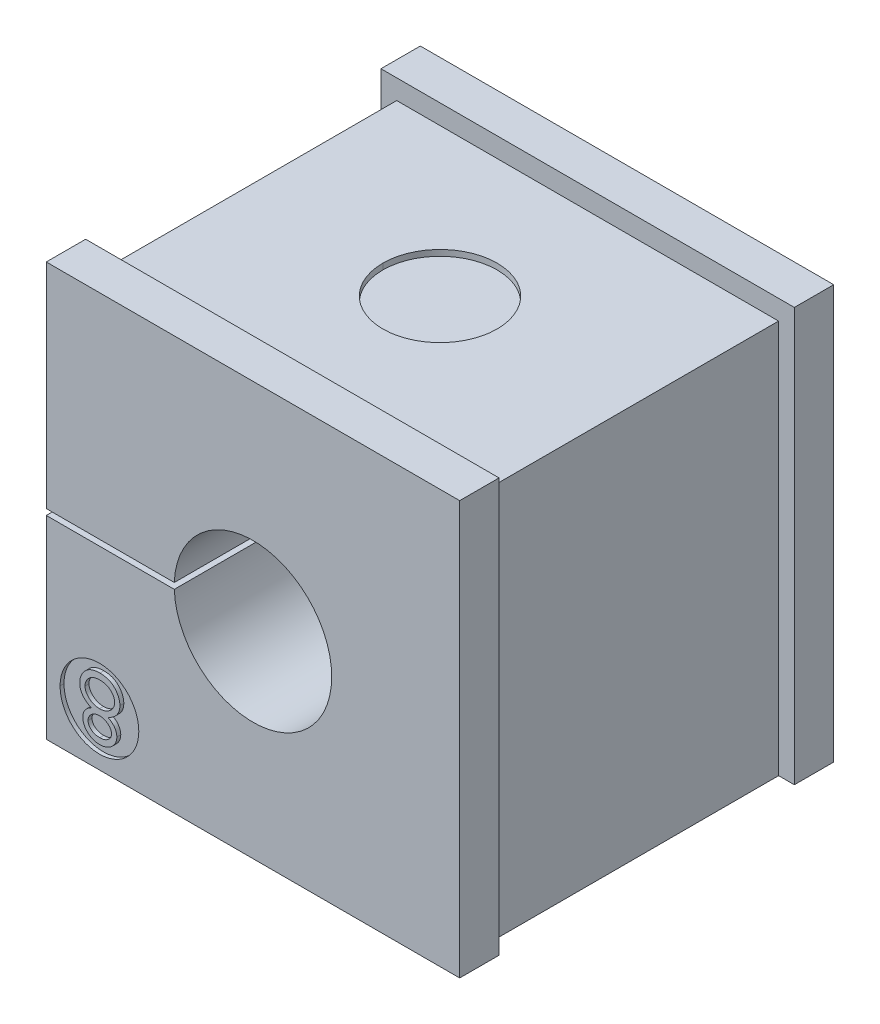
ISO-10303-21;
HEADER;
FILE_DESCRIPTION(('STEP AP214'),'2;1');
FILE_NAME('part.step','',(''),(''),'','','');
FILE_SCHEMA(('AUTOMOTIVE_DESIGN { 1 0 10303 214 1 1 1 1 }'));
ENDSEC;
DATA;
#1=APPLICATION_CONTEXT('core data for automotive mechanical design processes');
#2=APPLICATION_PROTOCOL_DEFINITION('international standard','automotive_design',2000,#1);
#3=PRODUCT_CONTEXT('',#1,'mechanical');
#4=PRODUCT('Part','Part','',(#3));
#5=PRODUCT_RELATED_PRODUCT_CATEGORY('part','',(#4));
#6=PRODUCT_DEFINITION_FORMATION('','',#4);
#7=PRODUCT_DEFINITION_CONTEXT('part definition',#1,'design');
#8=PRODUCT_DEFINITION('design','',#6,#7);
#9=PRODUCT_DEFINITION_SHAPE('','',#8);
#10=(LENGTH_UNIT() NAMED_UNIT(*) SI_UNIT(.MILLI.,.METRE.));
#11=(NAMED_UNIT(*) PLANE_ANGLE_UNIT() SI_UNIT($,.RADIAN.));
#12=(NAMED_UNIT(*) SI_UNIT($,.STERADIAN.) SOLID_ANGLE_UNIT());
#13=UNCERTAINTY_MEASURE_WITH_UNIT(LENGTH_MEASURE(1.E-05),#10,'distance_accuracy_value','');
#14=(GEOMETRIC_REPRESENTATION_CONTEXT(3) GLOBAL_UNCERTAINTY_ASSIGNED_CONTEXT((#13)) GLOBAL_UNIT_ASSIGNED_CONTEXT((#10,
#11,#12)) REPRESENTATION_CONTEXT('',''));
#15=CARTESIAN_POINT('',(0.,0.,0.));
#16=DIRECTION('',(0.,0.,1.));
#17=DIRECTION('',(1.,0.,0.));
#18=AXIS2_PLACEMENT_3D('',#15,#16,#17);
#19=CARTESIAN_POINT('',(2.7,-7.8,9.3));
#20=DIRECTION('',(0.,0.,1.));
#21=DIRECTION('',(1.,0.,0.));
#22=AXIS2_PLACEMENT_3D('',#19,#20,#21);
#23=PLANE('',#22);
#24=CARTESIAN_POINT('',(2.12307692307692,-8.60889423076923,9.3));
#25=CARTESIAN_POINT('',(2.12352440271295,-8.62314982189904,9.3));
#26=CARTESIAN_POINT('',(2.12441258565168,-8.65144512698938,9.3));
#27=CARTESIAN_POINT('',(2.13202822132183,-8.6933664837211,9.3));
#28=CARTESIAN_POINT('',(2.14390628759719,-8.73436028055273,9.3));
#29=CARTESIAN_POINT('',(2.16122024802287,-8.77418586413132,9.3));
#30=CARTESIAN_POINT('',(2.18216475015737,-8.81376841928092,9.3));
#31=CARTESIAN_POINT('',(2.20886218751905,-8.85186620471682,9.3));
#32=CARTESIAN_POINT('',(2.23980299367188,-8.88963216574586,9.3));
#33=CARTESIAN_POINT('',(2.27543384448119,-8.92582321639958,9.3));
#34=CARTESIAN_POINT('',(2.31568935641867,-8.95980034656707,9.3));
#35=CARTESIAN_POINT('',(2.36089516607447,-8.98925319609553,9.3));
#36=CARTESIAN_POINT('',(2.41065234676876,-9.01381359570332,9.3));
#37=CARTESIAN_POINT('',(2.46429382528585,-9.03444736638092,9.3));
#38=CARTESIAN_POINT('',(2.52238647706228,-9.04977224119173,9.3));
#39=CARTESIAN_POINT('',(2.58443013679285,-9.06130476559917,9.3));
#40=CARTESIAN_POINT('',(2.65098462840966,-9.06779152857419,9.3));
#41=CARTESIAN_POINT('',(2.69678125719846,-9.06874061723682,9.3));
#42=CARTESIAN_POINT('',(2.72043269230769,-9.06923076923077,9.3));
#43=(BOUNDED_CURVE() B_SPLINE_CURVE(3,(#24,#25,#26,#27,#28,#29,#30,#31,#32,#33,#34,#35,#36,#37,
#38,#39,#40,#41,#42),.UNSPECIFIED.,.F.,.F.) B_SPLINE_CURVE_WITH_KNOTS((4,1,1,1,1,1,1,1,1,1,1,1,
1,1,1,1,4),(0.,0.0508772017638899,0.100983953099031,0.151694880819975,0.202987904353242,
0.255805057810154,0.311370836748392,0.368807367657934,0.430022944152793,0.492496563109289,
0.556591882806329,0.622183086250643,0.690345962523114,0.76150315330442,0.836437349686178,
0.915528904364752,1.),
.UNSPECIFIED.) CURVE() GEOMETRIC_REPRESENTATION_ITEM() RATIONAL_B_SPLINE_CURVE((1.,1.,1.,1.,1.,
1.,1.,1.,1.,1.,1.,1.,1.,1.,1.,1.,1.,1.,1.)) REPRESENTATION_ITEM(''));
#44=CARTESIAN_POINT('',(2.12307692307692,-8.60889423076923,9.3));
#45=VERTEX_POINT('',#44);
#46=CARTESIAN_POINT('',(2.72043269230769,-9.06923076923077,9.3));
#47=VERTEX_POINT('',#46);
#48=EDGE_CURVE('E326',#45,#47,#43,.T.);
#49=ORIENTED_EDGE('',*,*,#48,.T.);
#50=CARTESIAN_POINT('',(2.72043269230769,-9.06923076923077,9.3));
#51=CARTESIAN_POINT('',(2.74147697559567,-9.06867419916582,9.3));
#52=CARTESIAN_POINT('',(2.78264879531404,-9.06758530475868,9.3));
#53=CARTESIAN_POINT('',(2.84300592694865,-9.06185258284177,9.3));
#54=CARTESIAN_POINT('',(2.90044787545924,-9.05084092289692,9.3));
#55=CARTESIAN_POINT('',(2.95528875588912,-9.03575509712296,9.3));
#56=CARTESIAN_POINT('',(3.00771643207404,-9.01698530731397,9.3));
#57=CARTESIAN_POINT('',(3.05652864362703,-8.99225546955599,9.3));
#58=CARTESIAN_POINT('',(3.10336575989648,-8.96476815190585,9.3));
#59=CARTESIAN_POINT('',(3.14669124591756,-8.93252677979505,9.3));
#60=CARTESIAN_POINT('',(3.18591181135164,-8.89735074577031,9.3));
#61=CARTESIAN_POINT('',(3.22094269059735,-8.8606149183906,9.3));
#62=CARTESIAN_POINT('',(3.24948198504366,-8.82123634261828,9.3));
#63=CARTESIAN_POINT('',(3.27403538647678,-8.7811850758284,9.3));
#64=CARTESIAN_POINT('',(3.2922697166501,-8.7387998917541,9.3));
#65=CARTESIAN_POINT('',(3.30522275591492,-8.69500882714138,9.3));
#66=CARTESIAN_POINT('',(3.31438972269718,-8.64953451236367,9.3));
#67=CARTESIAN_POINT('',(3.31505040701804,-8.61855543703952,9.3));
#68=CARTESIAN_POINT('',(3.31538461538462,-8.60288461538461,9.3));
#69=(BOUNDED_CURVE() B_SPLINE_CURVE(3,(#50,#51,#52,#53,#54,#55,#56,#57,#58,#59,#60,#61,#62,#63,
#64,#65,#66,#67,#68),.UNSPECIFIED.,.F.,.F.) B_SPLINE_CURVE_WITH_KNOTS((4,1,1,1,1,1,1,1,1,1,1,1,
1,1,1,1,4),(0.,0.0752210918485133,0.147165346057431,0.216383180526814,0.283941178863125,
0.350301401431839,0.414972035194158,0.479181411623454,0.544184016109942,0.607557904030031,
0.667323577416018,0.725167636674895,0.781028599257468,0.834890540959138,0.889470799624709,
0.94408860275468,1.),
.UNSPECIFIED.) CURVE() GEOMETRIC_REPRESENTATION_ITEM() RATIONAL_B_SPLINE_CURVE((1.,1.,1.,1.,1.,
1.,1.,1.,1.,1.,1.,1.,1.,1.,1.,1.,1.,1.,1.)) REPRESENTATION_ITEM(''));
#70=CARTESIAN_POINT('',(3.31538461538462,-8.60288461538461,9.3));
#71=VERTEX_POINT('',#70);
#72=EDGE_CURVE('E308',#47,#71,#69,.T.);
#73=ORIENTED_EDGE('',*,*,#72,.T.);
#74=CARTESIAN_POINT('',(3.31538461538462,-8.60288461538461,9.3));
#75=CARTESIAN_POINT('',(3.31477509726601,-8.58722266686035,9.3));
#76=CARTESIAN_POINT('',(3.31357060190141,-8.5562724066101,9.3));
#77=CARTESIAN_POINT('',(3.30485242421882,-8.51038432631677,9.3));
#78=CARTESIAN_POINT('',(3.29027555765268,-8.46587730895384,9.3));
#79=CARTESIAN_POINT('',(3.27028753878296,-8.42233587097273,9.3));
#80=CARTESIAN_POINT('',(3.24463665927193,-8.37987177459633,9.3));
#81=CARTESIAN_POINT('',(3.21350415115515,-8.33832229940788,9.3));
#82=CARTESIAN_POINT('',(3.17553918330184,-8.29878618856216,9.3));
#83=CARTESIAN_POINT('',(3.13361440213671,-8.26014172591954,9.3));
#84=CARTESIAN_POINT('',(3.08781899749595,-8.22453801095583,9.3));
#85=CARTESIAN_POINT('',(3.03969635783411,-8.19273482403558,9.3));
#86=CARTESIAN_POINT('',(2.9888952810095,-8.16738160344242,9.3));
#87=CARTESIAN_POINT('',(2.93693714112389,-8.14515201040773,9.3));
#88=CARTESIAN_POINT('',(2.88272314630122,-8.12847723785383,9.3));
#89=CARTESIAN_POINT('',(2.8266271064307,-8.11646404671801,9.3));
#90=CARTESIAN_POINT('',(2.7687089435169,-8.10903313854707,9.3));
#91=CARTESIAN_POINT('',(2.72946911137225,-8.10814278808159,9.3));
#92=CARTESIAN_POINT('',(2.70961538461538,-8.10769230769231,9.3));
#93=(BOUNDED_CURVE() B_SPLINE_CURVE(3,(#74,#75,#76,#77,#78,#79,#80,#81,#82,#83,#84,#85,#86,#87,
#88,#89,#90,#91,#92),.UNSPECIFIED.,.F.,.F.) B_SPLINE_CURVE_WITH_KNOTS((4,1,1,1,1,1,1,1,1,1,1,1,
1,1,1,1,4),(0.,0.0545758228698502,0.107849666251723,0.162170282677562,0.217473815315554,
0.274474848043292,0.334804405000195,0.39803425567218,0.465248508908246,0.533409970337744,
0.600034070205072,0.665925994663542,0.731025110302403,0.796839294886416,0.863261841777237,
0.930816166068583,1.),
.UNSPECIFIED.) CURVE() GEOMETRIC_REPRESENTATION_ITEM() RATIONAL_B_SPLINE_CURVE((1.,1.,1.,1.,1.,
1.,1.,1.,1.,1.,1.,1.,1.,1.,1.,1.,1.,1.,1.)) REPRESENTATION_ITEM(''));
#94=CARTESIAN_POINT('',(2.70961538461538,-8.10769230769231,9.3));
#95=VERTEX_POINT('',#94);
#96=EDGE_CURVE('E307',#71,#95,#93,.T.);
#97=ORIENTED_EDGE('',*,*,#96,.T.);
#98=CARTESIAN_POINT('',(2.70961538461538,-8.10769230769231,9.3));
#99=CARTESIAN_POINT('',(2.6841137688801,-8.10843670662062,9.3));
#100=CARTESIAN_POINT('',(2.63336241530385,-8.1099181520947,9.3));
#101=CARTESIAN_POINT('',(2.5585741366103,-8.12381780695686,9.3));
#102=CARTESIAN_POINT('',(2.48567284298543,-8.14540528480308,9.3));
#103=CARTESIAN_POINT('',(2.41603795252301,-8.17604480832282,9.3));
#104=CARTESIAN_POINT('',(2.35091576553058,-8.21340174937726,9.3));
#105=CARTESIAN_POINT('',(2.29214299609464,-8.2574560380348,9.3));
#106=CARTESIAN_POINT('',(2.24217917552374,-8.30924225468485,9.3));
#107=CARTESIAN_POINT('',(2.19967267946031,-8.36575640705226,9.3));
#108=CARTESIAN_POINT('',(2.16643861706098,-8.42570426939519,9.3));
#109=CARTESIAN_POINT('',(2.14098080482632,-8.48610963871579,9.3));
#110=CARTESIAN_POINT('',(2.12598840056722,-8.54747007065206,9.3));
#111=CARTESIAN_POINT('',(2.12403951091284,-8.58858627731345,9.3));
#112=CARTESIAN_POINT('',(2.12307692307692,-8.60889423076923,9.3));
#113=(BOUNDED_CURVE() B_SPLINE_CURVE(3,(#98,#99,#100,#101,#102,#103,#104,#105,#106,#107,#108,
#109,#110,#111,#112),.UNSPECIFIED.,.F.,.F.) B_SPLINE_CURVE_WITH_KNOTS((4,1,1,1,1,1,1,1,1,1,1,1,
4),(0.,0.0897134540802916,0.178540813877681,0.266907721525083,0.35693118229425,
0.445730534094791,0.530795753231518,0.614591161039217,0.698243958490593,0.779084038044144,
0.85531566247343,0.928538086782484,1.),
.UNSPECIFIED.) CURVE() GEOMETRIC_REPRESENTATION_ITEM() RATIONAL_B_SPLINE_CURVE((1.,1.,1.,1.,1.,
1.,1.,1.,1.,1.,1.,1.,1.,1.,1.)) REPRESENTATION_ITEM(''));
#114=EDGE_CURVE('E266',#95,#45,#113,.T.);
#115=ORIENTED_EDGE('',*,*,#114,.T.);
#116=EDGE_LOOP('',(#49,#73,#97,#115));
#117=FACE_BOUND('',#116,.T.);
#118=ADVANCED_FACE('F15',(#117),#23,.T.);
#119=CARTESIAN_POINT('',(2.7,-7.8,9.3));
#120=DIRECTION('',(0.,0.,1.));
#121=DIRECTION('',(1.,0.,0.));
#122=AXIS2_PLACEMENT_3D('',#119,#120,#121);
#123=PLANE('',#122);
#124=CARTESIAN_POINT('',(1.96923076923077,-7.16838942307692,9.3));
#125=CARTESIAN_POINT('',(1.97000208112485,-7.18885804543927,9.3));
#126=CARTESIAN_POINT('',(1.97152297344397,-7.22921859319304,9.3));
#127=CARTESIAN_POINT('',(1.9813145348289,-7.28898467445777,9.3));
#128=CARTESIAN_POINT('',(1.99812340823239,-7.34696283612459,9.3));
#129=CARTESIAN_POINT('',(2.02263357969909,-7.40289158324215,9.3));
#130=CARTESIAN_POINT('',(2.05273331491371,-7.45742151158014,9.3));
#131=CARTESIAN_POINT('',(2.0899160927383,-7.51009483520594,9.3));
#132=CARTESIAN_POINT('',(2.13372872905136,-7.56105740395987,9.3));
#133=CARTESIAN_POINT('',(2.18406398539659,-7.60925995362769,9.3));
#134=CARTESIAN_POINT('',(2.23861603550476,-7.65382102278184,9.3));
#135=CARTESIAN_POINT('',(2.29642929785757,-7.69342147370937,9.3));
#136=CARTESIAN_POINT('',(2.35776724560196,-7.72578728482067,9.3));
#137=CARTESIAN_POINT('',(2.42141479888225,-7.75297684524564,9.3));
#138=CARTESIAN_POINT('',(2.48801358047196,-7.77416584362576,9.3));
#139=CARTESIAN_POINT('',(2.55724236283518,-7.78902384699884,9.3));
#140=CARTESIAN_POINT('',(2.62923229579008,-7.79836209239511,9.3));
#141=CARTESIAN_POINT('',(2.67813615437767,-7.79944786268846,9.3));
#142=CARTESIAN_POINT('',(2.70300480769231,-7.8,9.3));
#143=(BOUNDED_CURVE() B_SPLINE_CURVE(3,(#124,#125,#126,#127,#128,#129,#130,#131,#132,#133,#134,
#135,#136,#137,#138,#139,#140,#141,#142),.UNSPECIFIED.,.F.,.F.) B_SPLINE_CURVE_WITH_KNOTS((4,1,
1,1,1,1,1,1,1,1,1,1,1,1,1,1,4),(0.,0.0573335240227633,0.113051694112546,0.169164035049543,
0.22597067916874,0.283741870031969,0.343363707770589,0.406234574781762,0.471713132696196,
0.538316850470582,0.603370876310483,0.667636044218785,0.73225300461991,0.797025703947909,
0.863062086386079,0.930364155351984,1.),
.UNSPECIFIED.) CURVE() GEOMETRIC_REPRESENTATION_ITEM() RATIONAL_B_SPLINE_CURVE((1.,1.,1.,1.,1.,
1.,1.,1.,1.,1.,1.,1.,1.,1.,1.,1.,1.,1.,1.)) REPRESENTATION_ITEM(''));
#144=CARTESIAN_POINT('',(1.96923076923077,-7.16838942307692,9.3));
#145=VERTEX_POINT('',#144);
#146=CARTESIAN_POINT('',(2.70300480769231,-7.8,9.3));
#147=VERTEX_POINT('',#146);
#148=EDGE_CURVE('E257',#145,#147,#143,.T.);
#149=ORIENTED_EDGE('',*,*,#148,.T.);
#150=CARTESIAN_POINT('',(2.70300480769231,-7.8,9.3));
#151=CARTESIAN_POINT('',(2.72968397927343,-7.79952531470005,9.3));
#152=CARTESIAN_POINT('',(2.78202200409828,-7.79859409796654,9.3));
#153=CARTESIAN_POINT('',(2.85870040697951,-7.78823358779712,9.3));
#154=CARTESIAN_POINT('',(2.93228506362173,-7.77380140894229,9.3));
#155=CARTESIAN_POINT('',(3.00255008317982,-7.75194310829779,9.3));
#156=CARTESIAN_POINT('',(3.06913478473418,-7.72350248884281,9.3));
#157=CARTESIAN_POINT('',(3.1329762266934,-7.68977678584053,9.3));
#158=CARTESIAN_POINT('',(3.19307466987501,-7.64935319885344,9.3));
#159=CARTESIAN_POINT('',(3.24916149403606,-7.60321195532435,9.3));
#160=CARTESIAN_POINT('',(3.30051048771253,-7.55320979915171,9.3));
#161=CARTESIAN_POINT('',(3.34572399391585,-7.50040084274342,9.3));
#162=CARTESIAN_POINT('',(3.38392299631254,-7.44550216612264,9.3));
#163=CARTESIAN_POINT('',(3.41492191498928,-7.3884443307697,9.3));
#164=CARTESIAN_POINT('',(3.43897005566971,-7.32935305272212,9.3));
#165=CARTESIAN_POINT('',(3.45671795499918,-7.26819384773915,9.3));
#166=CARTESIAN_POINT('',(3.46702236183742,-7.20479612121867,9.3));
#167=CARTESIAN_POINT('',(3.46849052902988,-7.16181501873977,9.3));
#168=CARTESIAN_POINT('',(3.46923076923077,-7.14014423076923,9.3));
#169=(BOUNDED_CURVE() B_SPLINE_CURVE(3,(#150,#151,#152,#153,#154,#155,#156,#157,#158,#159,#160,
#161,#162,#163,#164,#165,#166,#167,#168),.UNSPECIFIED.,.F.,.F.) B_SPLINE_CURVE_WITH_KNOTS((4,1,
1,1,1,1,1,1,1,1,1,1,1,1,1,1,4),(0.,0.0712707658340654,0.13981585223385,0.206503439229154,
0.271543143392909,0.336091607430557,0.399815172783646,0.464272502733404,0.529340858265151,
0.593715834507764,0.655631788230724,0.714899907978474,0.772167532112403,0.828848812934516,
0.885118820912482,0.942077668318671,1.),
.UNSPECIFIED.) CURVE() GEOMETRIC_REPRESENTATION_ITEM() RATIONAL_B_SPLINE_CURVE((1.,1.,1.,1.,1.,
1.,1.,1.,1.,1.,1.,1.,1.,1.,1.,1.,1.,1.,1.)) REPRESENTATION_ITEM(''));
#170=CARTESIAN_POINT('',(3.46923076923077,-7.14014423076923,9.3));
#171=VERTEX_POINT('',#170);
#172=EDGE_CURVE('E243',#147,#171,#169,.T.);
#173=ORIENTED_EDGE('',*,*,#172,.T.);
#174=CARTESIAN_POINT('',(3.46923076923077,-7.14014423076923,9.3));
#175=CARTESIAN_POINT('',(3.46804066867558,-7.11320816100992,9.3));
#176=CARTESIAN_POINT('',(3.46567089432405,-7.05957201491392,9.3));
#177=CARTESIAN_POINT('',(3.44754491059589,-6.98050281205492,9.3));
#178=CARTESIAN_POINT('',(3.41777680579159,-6.90397786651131,9.3));
#179=CARTESIAN_POINT('',(3.37601566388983,-6.83107644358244,9.3));
#180=CARTESIAN_POINT('',(3.32507683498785,-6.76268244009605,9.3));
#181=CARTESIAN_POINT('',(3.2631507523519,-6.70222646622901,9.3));
#182=CARTESIAN_POINT('',(3.19174723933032,-6.65052235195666,9.3));
#183=CARTESIAN_POINT('',(3.11145290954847,-6.60730831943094,9.3));
#184=CARTESIAN_POINT('',(3.02343460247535,-6.57308221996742,9.3));
#185=CARTESIAN_POINT('',(2.9282362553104,-6.54859578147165,9.3));
#186=CARTESIAN_POINT('',(2.82650270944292,-6.53320502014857,9.3));
#187=CARTESIAN_POINT('',(2.75634654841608,-6.53159395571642,9.3));
#188=CARTESIAN_POINT('',(2.72043269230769,-6.53076923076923,9.3));
#189=(BOUNDED_CURVE() B_SPLINE_CURVE(3,(#174,#175,#176,#177,#178,#179,#180,#181,#182,#183,#184,
#185,#186,#187,#188),.UNSPECIFIED.,.F.,.F.) B_SPLINE_CURVE_WITH_KNOTS((4,1,1,1,1,1,1,1,1,1,1,1,
4),(0.,0.0749254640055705,0.149194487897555,0.22457708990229,0.302729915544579,
0.382354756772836,0.461214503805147,0.542630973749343,0.626960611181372,0.71435369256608,
0.804831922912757,0.900090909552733,1.),
.UNSPECIFIED.) CURVE() GEOMETRIC_REPRESENTATION_ITEM() RATIONAL_B_SPLINE_CURVE((1.,1.,1.,1.,1.,
1.,1.,1.,1.,1.,1.,1.,1.,1.,1.)) REPRESENTATION_ITEM(''));
#190=CARTESIAN_POINT('',(2.72043269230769,-6.53076923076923,9.3));
#191=VERTEX_POINT('',#190);
#192=EDGE_CURVE('E792',#171,#191,#189,.T.);
#193=ORIENTED_EDGE('',*,*,#192,.T.);
#194=CARTESIAN_POINT('',(2.72043269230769,-6.53076923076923,9.3));
#195=CARTESIAN_POINT('',(2.69236289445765,-6.53131450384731,9.3));
#196=CARTESIAN_POINT('',(2.63767392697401,-6.53237687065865,9.3));
#197=CARTESIAN_POINT('',(2.55785902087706,-6.54155909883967,9.3));
#198=CARTESIAN_POINT('',(2.48271526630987,-6.55655805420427,9.3));
#199=CARTESIAN_POINT('',(2.41152276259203,-6.5768950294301,9.3));
#200=CARTESIAN_POINT('',(2.3448114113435,-6.60385347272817,9.3));
#201=CARTESIAN_POINT('',(2.2826721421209,-6.63733844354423,9.3));
#202=CARTESIAN_POINT('',(2.22425878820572,-6.67558551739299,9.3));
#203=CARTESIAN_POINT('',(2.17206782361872,-6.72086674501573,9.3));
#204=CARTESIAN_POINT('',(2.12461340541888,-6.76932045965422,9.3));
#205=CARTESIAN_POINT('',(2.08304707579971,-6.82034382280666,9.3));
#206=CARTESIAN_POINT('',(2.04786917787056,-6.87342583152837,9.3));
#207=CARTESIAN_POINT('',(2.01951241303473,-6.92853541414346,9.3));
#208=CARTESIAN_POINT('',(1.99699443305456,-6.98547004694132,9.3));
#209=CARTESIAN_POINT('',(1.98076153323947,-7.04446344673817,9.3));
#210=CARTESIAN_POINT('',(1.9707567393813,-7.10574733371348,9.3));
#211=CARTESIAN_POINT('',(1.96974408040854,-7.14731765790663,9.3));
#212=CARTESIAN_POINT('',(1.96923076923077,-7.16838942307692,9.3));
#213=(BOUNDED_CURVE() B_SPLINE_CURVE(3,(#194,#195,#196,#197,#198,#199,#200,#201,#202,#203,#204,
#205,#206,#207,#208,#209,#210,#211,#212),.UNSPECIFIED.,.F.,.F.) B_SPLINE_CURVE_WITH_KNOTS((4,1,
1,1,1,1,1,1,1,1,1,1,1,1,1,1,4),(0.,0.0765394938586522,0.149123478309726,0.218771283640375,
0.285340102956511,0.350780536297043,0.414576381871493,0.477614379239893,0.540787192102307,
0.602605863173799,0.662421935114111,0.720005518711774,0.775964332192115,0.831157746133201,
0.886696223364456,0.942566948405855,1.),
.UNSPECIFIED.) CURVE() GEOMETRIC_REPRESENTATION_ITEM() RATIONAL_B_SPLINE_CURVE((1.,1.,1.,1.,1.,
1.,1.,1.,1.,1.,1.,1.,1.,1.,1.,1.,1.,1.,1.)) REPRESENTATION_ITEM(''));
#214=EDGE_CURVE('E9',#191,#145,#213,.T.);
#215=ORIENTED_EDGE('',*,*,#214,.T.);
#216=EDGE_LOOP('',(#149,#173,#193,#215));
#217=FACE_BOUND('',#216,.T.);
#218=ADVANCED_FACE('F264',(#217),#123,.T.);
#219=CARTESIAN_POINT('',(2.72043269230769,-6.53076923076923,9.5));
#220=CARTESIAN_POINT('',(2.72043269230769,-6.53076923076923,9.3));
#221=CARTESIAN_POINT('',(2.69236289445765,-6.53131450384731,9.5));
#222=CARTESIAN_POINT('',(2.69236289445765,-6.53131450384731,9.3));
#223=CARTESIAN_POINT('',(2.63767392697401,-6.53237687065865,9.5));
#224=CARTESIAN_POINT('',(2.63767392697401,-6.53237687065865,9.3));
#225=CARTESIAN_POINT('',(2.55785902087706,-6.54155909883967,9.5));
#226=CARTESIAN_POINT('',(2.55785902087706,-6.54155909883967,9.3));
#227=CARTESIAN_POINT('',(2.48271526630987,-6.55655805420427,9.5));
#228=CARTESIAN_POINT('',(2.48271526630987,-6.55655805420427,9.3));
#229=CARTESIAN_POINT('',(2.41152276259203,-6.5768950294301,9.5));
#230=CARTESIAN_POINT('',(2.41152276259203,-6.5768950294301,9.3));
#231=CARTESIAN_POINT('',(2.3448114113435,-6.60385347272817,9.5));
#232=CARTESIAN_POINT('',(2.3448114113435,-6.60385347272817,9.3));
#233=CARTESIAN_POINT('',(2.2826721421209,-6.63733844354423,9.5));
#234=CARTESIAN_POINT('',(2.2826721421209,-6.63733844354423,9.3));
#235=CARTESIAN_POINT('',(2.22425878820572,-6.67558551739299,9.5));
#236=CARTESIAN_POINT('',(2.22425878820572,-6.67558551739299,9.3));
#237=CARTESIAN_POINT('',(2.17206782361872,-6.72086674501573,9.5));
#238=CARTESIAN_POINT('',(2.17206782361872,-6.72086674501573,9.3));
#239=CARTESIAN_POINT('',(2.12461340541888,-6.76932045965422,9.5));
#240=CARTESIAN_POINT('',(2.12461340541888,-6.76932045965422,9.3));
#241=CARTESIAN_POINT('',(2.08304707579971,-6.82034382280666,9.5));
#242=CARTESIAN_POINT('',(2.08304707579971,-6.82034382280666,9.3));
#243=CARTESIAN_POINT('',(2.04786917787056,-6.87342583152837,9.5));
#244=CARTESIAN_POINT('',(2.04786917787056,-6.87342583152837,9.3));
#245=CARTESIAN_POINT('',(2.01951241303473,-6.92853541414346,9.5));
#246=CARTESIAN_POINT('',(2.01951241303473,-6.92853541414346,9.3));
#247=CARTESIAN_POINT('',(1.99699443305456,-6.98547004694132,9.5));
#248=CARTESIAN_POINT('',(1.99699443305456,-6.98547004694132,9.3));
#249=CARTESIAN_POINT('',(1.98076153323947,-7.04446344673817,9.5));
#250=CARTESIAN_POINT('',(1.98076153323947,-7.04446344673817,9.3));
#251=CARTESIAN_POINT('',(1.9707567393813,-7.10574733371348,9.5));
#252=CARTESIAN_POINT('',(1.9707567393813,-7.10574733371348,9.3));
#253=CARTESIAN_POINT('',(1.96974408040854,-7.14731765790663,9.5));
#254=CARTESIAN_POINT('',(1.96974408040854,-7.14731765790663,9.3));
#255=CARTESIAN_POINT('',(1.96923076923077,-7.16838942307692,9.5));
#256=CARTESIAN_POINT('',(1.96923076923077,-7.16838942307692,9.3));
#257=(BOUNDED_SURFACE() B_SPLINE_SURFACE(3,1,((#219,#220),(#221,#222),(#223,#224),(#225,#226),
(#227,#228),(#229,#230),(#231,#232),(#233,#234),(#235,#236),(#237,#238),(#239,#240),(#241,#242),
(#243,#244),(#245,#246),(#247,#248),(#249,#250),(#251,#252),(#253,#254),(#255,#256)),
.UNSPECIFIED.,.F.,.F.,.F.) B_SPLINE_SURFACE_WITH_KNOTS((4,1,1,1,1,1,1,1,1,1,1,1,1,1,1,1,4),(2,
2),(0.,0.0765394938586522,0.149123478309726,0.218771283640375,0.285340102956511,
0.350780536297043,0.414576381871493,0.477614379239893,0.540787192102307,0.602605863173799,
0.662421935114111,0.720005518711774,0.775964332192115,0.831157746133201,0.886696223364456,
0.942566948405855,1.),(0.,1.),
.UNSPECIFIED.) GEOMETRIC_REPRESENTATION_ITEM() RATIONAL_B_SPLINE_SURFACE(((1.,1.),(1.,1.),(1.,
1.),(1.,1.),(1.,1.),(1.,1.),(1.,1.),(1.,1.),(1.,1.),(1.,1.),(1.,1.),(1.,1.),(1.,1.),(1.,1.),(1.,
1.),(1.,1.),(1.,1.),(1.,1.),(1.,1.))) REPRESENTATION_ITEM('') SURFACE());
#258=DIRECTION('',(0.,0.,-1.));
#259=VECTOR('',#258,1.);
#260=CARTESIAN_POINT('',(2.72043269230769,-6.53076923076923,9.5));
#261=LINE('',#260,#259);
#262=CARTESIAN_POINT('',(2.72043269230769,-6.53076923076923,9.5));
#263=VERTEX_POINT('',#262);
#264=EDGE_CURVE('E25',#263,#191,#261,.T.);
#265=CARTESIAN_POINT('',(2.72043269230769,-6.53076923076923,9.5));
#266=CARTESIAN_POINT('',(2.69236289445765,-6.53131450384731,9.5));
#267=CARTESIAN_POINT('',(2.63767392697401,-6.53237687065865,9.5));
#268=CARTESIAN_POINT('',(2.55785902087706,-6.54155909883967,9.5));
#269=CARTESIAN_POINT('',(2.48271526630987,-6.55655805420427,9.5));
#270=CARTESIAN_POINT('',(2.41152276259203,-6.5768950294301,9.5));
#271=CARTESIAN_POINT('',(2.3448114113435,-6.60385347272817,9.5));
#272=CARTESIAN_POINT('',(2.2826721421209,-6.63733844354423,9.5));
#273=CARTESIAN_POINT('',(2.22425878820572,-6.67558551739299,9.5));
#274=CARTESIAN_POINT('',(2.17206782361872,-6.72086674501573,9.5));
#275=CARTESIAN_POINT('',(2.12461340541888,-6.76932045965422,9.5));
#276=CARTESIAN_POINT('',(2.08304707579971,-6.82034382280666,9.5));
#277=CARTESIAN_POINT('',(2.04786917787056,-6.87342583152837,9.5));
#278=CARTESIAN_POINT('',(2.01951241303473,-6.92853541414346,9.5));
#279=CARTESIAN_POINT('',(1.99699443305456,-6.98547004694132,9.5));
#280=CARTESIAN_POINT('',(1.98076153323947,-7.04446344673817,9.5));
#281=CARTESIAN_POINT('',(1.9707567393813,-7.10574733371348,9.5));
#282=CARTESIAN_POINT('',(1.96974408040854,-7.14731765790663,9.5));
#283=CARTESIAN_POINT('',(1.96923076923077,-7.16838942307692,9.5));
#284=(BOUNDED_CURVE() B_SPLINE_CURVE(3,(#265,#266,#267,#268,#269,#270,#271,#272,#273,#274,#275,
#276,#277,#278,#279,#280,#281,#282,#283),.UNSPECIFIED.,.F.,.F.) B_SPLINE_CURVE_WITH_KNOTS((4,1,
1,1,1,1,1,1,1,1,1,1,1,1,1,1,4),(0.,0.0765394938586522,0.149123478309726,0.218771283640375,
0.285340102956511,0.350780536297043,0.414576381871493,0.477614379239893,0.540787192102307,
0.602605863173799,0.662421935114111,0.720005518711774,0.775964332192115,0.831157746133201,
0.886696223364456,0.942566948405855,1.),
.UNSPECIFIED.) CURVE() GEOMETRIC_REPRESENTATION_ITEM() RATIONAL_B_SPLINE_CURVE((1.,1.,1.,1.,1.,
1.,1.,1.,1.,1.,1.,1.,1.,1.,1.,1.,1.,1.,1.)) REPRESENTATION_ITEM(''));
#285=CARTESIAN_POINT('',(1.96923076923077,-7.16838942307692,9.5));
#286=VERTEX_POINT('',#285);
#287=EDGE_CURVE('E602',#263,#286,#284,.T.);
#288=DIRECTION('',(0.,0.,-1.));
#289=VECTOR('',#288,1.);
#290=CARTESIAN_POINT('',(1.96923076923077,-7.16838942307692,9.5));
#291=LINE('',#290,#289);
#292=EDGE_CURVE('E262',#286,#145,#291,.T.);
#293=ORIENTED_EDGE('',*,*,#214,.F.);
#294=ORIENTED_EDGE('',*,*,#264,.F.);
#295=ORIENTED_EDGE('',*,*,#287,.T.);
#296=ORIENTED_EDGE('',*,*,#292,.T.);
#297=EDGE_LOOP('',(#293,#294,#295,#296));
#298=FACE_BOUND('',#297,.T.);
#299=ADVANCED_FACE('F1126',(#298),#257,.T.);
#300=CARTESIAN_POINT('',(3.46923076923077,-7.14014423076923,9.5));
#301=CARTESIAN_POINT('',(3.46923076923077,-7.14014423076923,9.3));
#302=CARTESIAN_POINT('',(3.46804066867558,-7.11320816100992,9.5));
#303=CARTESIAN_POINT('',(3.46804066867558,-7.11320816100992,9.3));
#304=CARTESIAN_POINT('',(3.46567089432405,-7.05957201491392,9.5));
#305=CARTESIAN_POINT('',(3.46567089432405,-7.05957201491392,9.3));
#306=CARTESIAN_POINT('',(3.44754491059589,-6.98050281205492,9.5));
#307=CARTESIAN_POINT('',(3.44754491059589,-6.98050281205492,9.3));
#308=CARTESIAN_POINT('',(3.41777680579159,-6.90397786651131,9.5));
#309=CARTESIAN_POINT('',(3.41777680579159,-6.90397786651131,9.3));
#310=CARTESIAN_POINT('',(3.37601566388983,-6.83107644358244,9.5));
#311=CARTESIAN_POINT('',(3.37601566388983,-6.83107644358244,9.3));
#312=CARTESIAN_POINT('',(3.32507683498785,-6.76268244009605,9.5));
#313=CARTESIAN_POINT('',(3.32507683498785,-6.76268244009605,9.3));
#314=CARTESIAN_POINT('',(3.2631507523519,-6.70222646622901,9.5));
#315=CARTESIAN_POINT('',(3.2631507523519,-6.70222646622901,9.3));
#316=CARTESIAN_POINT('',(3.19174723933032,-6.65052235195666,9.5));
#317=CARTESIAN_POINT('',(3.19174723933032,-6.65052235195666,9.3));
#318=CARTESIAN_POINT('',(3.11145290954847,-6.60730831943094,9.5));
#319=CARTESIAN_POINT('',(3.11145290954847,-6.60730831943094,9.3));
#320=CARTESIAN_POINT('',(3.02343460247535,-6.57308221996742,9.5));
#321=CARTESIAN_POINT('',(3.02343460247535,-6.57308221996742,9.3));
#322=CARTESIAN_POINT('',(2.9282362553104,-6.54859578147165,9.5));
#323=CARTESIAN_POINT('',(2.9282362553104,-6.54859578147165,9.3));
#324=CARTESIAN_POINT('',(2.82650270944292,-6.53320502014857,9.5));
#325=CARTESIAN_POINT('',(2.82650270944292,-6.53320502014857,9.3));
#326=CARTESIAN_POINT('',(2.75634654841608,-6.53159395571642,9.5));
#327=CARTESIAN_POINT('',(2.75634654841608,-6.53159395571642,9.3));
#328=CARTESIAN_POINT('',(2.72043269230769,-6.53076923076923,9.5));
#329=CARTESIAN_POINT('',(2.72043269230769,-6.53076923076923,9.3));
#330=(BOUNDED_SURFACE() B_SPLINE_SURFACE(3,1,((#300,#301),(#302,#303),(#304,#305),(#306,#307),
(#308,#309),(#310,#311),(#312,#313),(#314,#315),(#316,#317),(#318,#319),(#320,#321),(#322,#323),
(#324,#325),(#326,#327),(#328,#329)),.UNSPECIFIED.,.F.,.F.,.F.) B_SPLINE_SURFACE_WITH_KNOTS((4,
1,1,1,1,1,1,1,1,1,1,1,4),(2,2),(0.,0.0749254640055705,0.149194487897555,0.22457708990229,
0.302729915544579,0.382354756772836,0.461214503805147,0.542630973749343,0.626960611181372,
0.71435369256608,0.804831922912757,0.900090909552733,1.),(0.,1.),
.UNSPECIFIED.) GEOMETRIC_REPRESENTATION_ITEM() RATIONAL_B_SPLINE_SURFACE(((1.,1.),(1.,1.),(1.,
1.),(1.,1.),(1.,1.),(1.,1.),(1.,1.),(1.,1.),(1.,1.),(1.,1.),(1.,1.),(1.,1.),(1.,1.),(1.,1.),(1.,1.))) REPRESENTATION_ITEM('') SURFACE());
#331=DIRECTION('',(0.,0.,-1.));
#332=VECTOR('',#331,1.);
#333=CARTESIAN_POINT('',(3.46923076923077,-7.14014423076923,9.5));
#334=LINE('',#333,#332);
#335=CARTESIAN_POINT('',(3.46923076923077,-7.14014423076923,9.5));
#336=VERTEX_POINT('',#335);
#337=EDGE_CURVE('E18',#336,#171,#334,.T.);
#338=CARTESIAN_POINT('',(3.46923076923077,-7.14014423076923,9.5));
#339=CARTESIAN_POINT('',(3.46804066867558,-7.11320816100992,9.5));
#340=CARTESIAN_POINT('',(3.46567089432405,-7.05957201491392,9.5));
#341=CARTESIAN_POINT('',(3.44754491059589,-6.98050281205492,9.5));
#342=CARTESIAN_POINT('',(3.41777680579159,-6.90397786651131,9.5));
#343=CARTESIAN_POINT('',(3.37601566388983,-6.83107644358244,9.5));
#344=CARTESIAN_POINT('',(3.32507683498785,-6.76268244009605,9.5));
#345=CARTESIAN_POINT('',(3.2631507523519,-6.70222646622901,9.5));
#346=CARTESIAN_POINT('',(3.19174723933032,-6.65052235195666,9.5));
#347=CARTESIAN_POINT('',(3.11145290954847,-6.60730831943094,9.5));
#348=CARTESIAN_POINT('',(3.02343460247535,-6.57308221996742,9.5));
#349=CARTESIAN_POINT('',(2.9282362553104,-6.54859578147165,9.5));
#350=CARTESIAN_POINT('',(2.82650270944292,-6.53320502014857,9.5));
#351=CARTESIAN_POINT('',(2.75634654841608,-6.53159395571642,9.5));
#352=CARTESIAN_POINT('',(2.72043269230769,-6.53076923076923,9.5));
#353=(BOUNDED_CURVE() B_SPLINE_CURVE(3,(#338,#339,#340,#341,#342,#343,#344,#345,#346,#347,#348,
#349,#350,#351,#352),.UNSPECIFIED.,.F.,.F.) B_SPLINE_CURVE_WITH_KNOTS((4,1,1,1,1,1,1,1,1,1,1,1,
4),(0.,0.0749254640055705,0.149194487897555,0.22457708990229,0.302729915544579,
0.382354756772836,0.461214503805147,0.542630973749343,0.626960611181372,0.71435369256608,
0.804831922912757,0.900090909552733,1.),
.UNSPECIFIED.) CURVE() GEOMETRIC_REPRESENTATION_ITEM() RATIONAL_B_SPLINE_CURVE((1.,1.,1.,1.,1.,
1.,1.,1.,1.,1.,1.,1.,1.,1.,1.)) REPRESENTATION_ITEM(''));
#354=EDGE_CURVE('E404',#336,#263,#353,.T.);
#355=ORIENTED_EDGE('',*,*,#192,.F.);
#356=ORIENTED_EDGE('',*,*,#337,.F.);
#357=ORIENTED_EDGE('',*,*,#354,.T.);
#358=ORIENTED_EDGE('',*,*,#264,.T.);
#359=EDGE_LOOP('',(#355,#356,#357,#358));
#360=FACE_BOUND('',#359,.T.);
#361=ADVANCED_FACE('F1130',(#360),#330,.T.);
#362=CARTESIAN_POINT('',(2.70300480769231,-7.8,9.5));
#363=CARTESIAN_POINT('',(2.70300480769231,-7.8,9.3));
#364=CARTESIAN_POINT('',(2.72968397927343,-7.79952531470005,9.5));
#365=CARTESIAN_POINT('',(2.72968397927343,-7.79952531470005,9.3));
#366=CARTESIAN_POINT('',(2.78202200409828,-7.79859409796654,9.5));
#367=CARTESIAN_POINT('',(2.78202200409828,-7.79859409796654,9.3));
#368=CARTESIAN_POINT('',(2.85870040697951,-7.78823358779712,9.5));
#369=CARTESIAN_POINT('',(2.85870040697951,-7.78823358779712,9.3));
#370=CARTESIAN_POINT('',(2.93228506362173,-7.77380140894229,9.5));
#371=CARTESIAN_POINT('',(2.93228506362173,-7.77380140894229,9.3));
#372=CARTESIAN_POINT('',(3.00255008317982,-7.75194310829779,9.5));
#373=CARTESIAN_POINT('',(3.00255008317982,-7.75194310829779,9.3));
#374=CARTESIAN_POINT('',(3.06913478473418,-7.72350248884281,9.5));
#375=CARTESIAN_POINT('',(3.06913478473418,-7.72350248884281,9.3));
#376=CARTESIAN_POINT('',(3.1329762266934,-7.68977678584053,9.5));
#377=CARTESIAN_POINT('',(3.1329762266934,-7.68977678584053,9.3));
#378=CARTESIAN_POINT('',(3.19307466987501,-7.64935319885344,9.5));
#379=CARTESIAN_POINT('',(3.19307466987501,-7.64935319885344,9.3));
#380=CARTESIAN_POINT('',(3.24916149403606,-7.60321195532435,9.5));
#381=CARTESIAN_POINT('',(3.24916149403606,-7.60321195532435,9.3));
#382=CARTESIAN_POINT('',(3.30051048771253,-7.55320979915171,9.5));
#383=CARTESIAN_POINT('',(3.30051048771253,-7.55320979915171,9.3));
#384=CARTESIAN_POINT('',(3.34572399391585,-7.50040084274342,9.5));
#385=CARTESIAN_POINT('',(3.34572399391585,-7.50040084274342,9.3));
#386=CARTESIAN_POINT('',(3.38392299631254,-7.44550216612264,9.5));
#387=CARTESIAN_POINT('',(3.38392299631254,-7.44550216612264,9.3));
#388=CARTESIAN_POINT('',(3.41492191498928,-7.3884443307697,9.5));
#389=CARTESIAN_POINT('',(3.41492191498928,-7.3884443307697,9.3));
#390=CARTESIAN_POINT('',(3.43897005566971,-7.32935305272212,9.5));
#391=CARTESIAN_POINT('',(3.43897005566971,-7.32935305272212,9.3));
#392=CARTESIAN_POINT('',(3.45671795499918,-7.26819384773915,9.5));
#393=CARTESIAN_POINT('',(3.45671795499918,-7.26819384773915,9.3));
#394=CARTESIAN_POINT('',(3.46702236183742,-7.20479612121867,9.5));
#395=CARTESIAN_POINT('',(3.46702236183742,-7.20479612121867,9.3));
#396=CARTESIAN_POINT('',(3.46849052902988,-7.16181501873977,9.5));
#397=CARTESIAN_POINT('',(3.46849052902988,-7.16181501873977,9.3));
#398=CARTESIAN_POINT('',(3.46923076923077,-7.14014423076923,9.5));
#399=CARTESIAN_POINT('',(3.46923076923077,-7.14014423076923,9.3));
#400=(BOUNDED_SURFACE() B_SPLINE_SURFACE(3,1,((#362,#363),(#364,#365),(#366,#367),(#368,#369),
(#370,#371),(#372,#373),(#374,#375),(#376,#377),(#378,#379),(#380,#381),(#382,#383),(#384,#385),
(#386,#387),(#388,#389),(#390,#391),(#392,#393),(#394,#395),(#396,#397),(#398,#399)),
.UNSPECIFIED.,.F.,.F.,.F.) B_SPLINE_SURFACE_WITH_KNOTS((4,1,1,1,1,1,1,1,1,1,1,1,1,1,1,1,4),(2,
2),(0.,0.0712707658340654,0.13981585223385,0.206503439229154,0.271543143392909,
0.336091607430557,0.399815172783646,0.464272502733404,0.529340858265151,0.593715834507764,
0.655631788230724,0.714899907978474,0.772167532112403,0.828848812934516,0.885118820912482,
0.942077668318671,1.),(0.,1.),
.UNSPECIFIED.) GEOMETRIC_REPRESENTATION_ITEM() RATIONAL_B_SPLINE_SURFACE(((1.,1.),(1.,1.),(1.,
1.),(1.,1.),(1.,1.),(1.,1.),(1.,1.),(1.,1.),(1.,1.),(1.,1.),(1.,1.),(1.,1.),(1.,1.),(1.,1.),(1.,
1.),(1.,1.),(1.,1.),(1.,1.),(1.,1.))) REPRESENTATION_ITEM('') SURFACE());
#401=DIRECTION('',(0.,0.,-1.));
#402=VECTOR('',#401,1.);
#403=CARTESIAN_POINT('',(2.70300480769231,-7.8,9.5));
#404=LINE('',#403,#402);
#405=CARTESIAN_POINT('',(2.70300480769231,-7.8,9.5));
#406=VERTEX_POINT('',#405);
#407=EDGE_CURVE('E247',#406,#147,#404,.T.);
#408=CARTESIAN_POINT('',(2.70300480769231,-7.8,9.5));
#409=CARTESIAN_POINT('',(2.72968397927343,-7.79952531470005,9.5));
#410=CARTESIAN_POINT('',(2.78202200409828,-7.79859409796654,9.5));
#411=CARTESIAN_POINT('',(2.85870040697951,-7.78823358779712,9.5));
#412=CARTESIAN_POINT('',(2.93228506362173,-7.77380140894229,9.5));
#413=CARTESIAN_POINT('',(3.00255008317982,-7.75194310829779,9.5));
#414=CARTESIAN_POINT('',(3.06913478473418,-7.72350248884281,9.5));
#415=CARTESIAN_POINT('',(3.1329762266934,-7.68977678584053,9.5));
#416=CARTESIAN_POINT('',(3.19307466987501,-7.64935319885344,9.5));
#417=CARTESIAN_POINT('',(3.24916149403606,-7.60321195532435,9.5));
#418=CARTESIAN_POINT('',(3.30051048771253,-7.55320979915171,9.5));
#419=CARTESIAN_POINT('',(3.34572399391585,-7.50040084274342,9.5));
#420=CARTESIAN_POINT('',(3.38392299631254,-7.44550216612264,9.5));
#421=CARTESIAN_POINT('',(3.41492191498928,-7.3884443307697,9.5));
#422=CARTESIAN_POINT('',(3.43897005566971,-7.32935305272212,9.5));
#423=CARTESIAN_POINT('',(3.45671795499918,-7.26819384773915,9.5));
#424=CARTESIAN_POINT('',(3.46702236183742,-7.20479612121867,9.5));
#425=CARTESIAN_POINT('',(3.46849052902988,-7.16181501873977,9.5));
#426=CARTESIAN_POINT('',(3.46923076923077,-7.14014423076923,9.5));
#427=(BOUNDED_CURVE() B_SPLINE_CURVE(3,(#408,#409,#410,#411,#412,#413,#414,#415,#416,#417,#418,
#419,#420,#421,#422,#423,#424,#425,#426),.UNSPECIFIED.,.F.,.F.) B_SPLINE_CURVE_WITH_KNOTS((4,1,
1,1,1,1,1,1,1,1,1,1,1,1,1,1,4),(0.,0.0712707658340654,0.13981585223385,0.206503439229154,
0.271543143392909,0.336091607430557,0.399815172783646,0.464272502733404,0.529340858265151,
0.593715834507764,0.655631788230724,0.714899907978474,0.772167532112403,0.828848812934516,
0.885118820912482,0.942077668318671,1.),
.UNSPECIFIED.) CURVE() GEOMETRIC_REPRESENTATION_ITEM() RATIONAL_B_SPLINE_CURVE((1.,1.,1.,1.,1.,
1.,1.,1.,1.,1.,1.,1.,1.,1.,1.,1.,1.,1.,1.)) REPRESENTATION_ITEM(''));
#428=EDGE_CURVE('E586',#406,#336,#427,.T.);
#429=ORIENTED_EDGE('',*,*,#172,.F.);
#430=ORIENTED_EDGE('',*,*,#407,.F.);
#431=ORIENTED_EDGE('',*,*,#428,.T.);
#432=ORIENTED_EDGE('',*,*,#337,.T.);
#433=EDGE_LOOP('',(#429,#430,#431,#432));
#434=FACE_BOUND('',#433,.T.);
#435=ADVANCED_FACE('F245',(#434),#400,.T.);
#436=CARTESIAN_POINT('',(1.96923076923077,-7.16838942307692,9.5));
#437=CARTESIAN_POINT('',(1.96923076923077,-7.16838942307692,9.3));
#438=CARTESIAN_POINT('',(1.97000208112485,-7.18885804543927,9.5));
#439=CARTESIAN_POINT('',(1.97000208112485,-7.18885804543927,9.3));
#440=CARTESIAN_POINT('',(1.97152297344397,-7.22921859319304,9.5));
#441=CARTESIAN_POINT('',(1.97152297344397,-7.22921859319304,9.3));
#442=CARTESIAN_POINT('',(1.9813145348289,-7.28898467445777,9.5));
#443=CARTESIAN_POINT('',(1.9813145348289,-7.28898467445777,9.3));
#444=CARTESIAN_POINT('',(1.99812340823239,-7.34696283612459,9.5));
#445=CARTESIAN_POINT('',(1.99812340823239,-7.34696283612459,9.3));
#446=CARTESIAN_POINT('',(2.02263357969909,-7.40289158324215,9.5));
#447=CARTESIAN_POINT('',(2.02263357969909,-7.40289158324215,9.3));
#448=CARTESIAN_POINT('',(2.05273331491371,-7.45742151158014,9.5));
#449=CARTESIAN_POINT('',(2.05273331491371,-7.45742151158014,9.3));
#450=CARTESIAN_POINT('',(2.0899160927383,-7.51009483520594,9.5));
#451=CARTESIAN_POINT('',(2.0899160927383,-7.51009483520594,9.3));
#452=CARTESIAN_POINT('',(2.13372872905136,-7.56105740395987,9.5));
#453=CARTESIAN_POINT('',(2.13372872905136,-7.56105740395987,9.3));
#454=CARTESIAN_POINT('',(2.18406398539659,-7.60925995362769,9.5));
#455=CARTESIAN_POINT('',(2.18406398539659,-7.60925995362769,9.3));
#456=CARTESIAN_POINT('',(2.23861603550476,-7.65382102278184,9.5));
#457=CARTESIAN_POINT('',(2.23861603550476,-7.65382102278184,9.3));
#458=CARTESIAN_POINT('',(2.29642929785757,-7.69342147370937,9.5));
#459=CARTESIAN_POINT('',(2.29642929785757,-7.69342147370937,9.3));
#460=CARTESIAN_POINT('',(2.35776724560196,-7.72578728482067,9.5));
#461=CARTESIAN_POINT('',(2.35776724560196,-7.72578728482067,9.3));
#462=CARTESIAN_POINT('',(2.42141479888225,-7.75297684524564,9.5));
#463=CARTESIAN_POINT('',(2.42141479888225,-7.75297684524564,9.3));
#464=CARTESIAN_POINT('',(2.48801358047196,-7.77416584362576,9.5));
#465=CARTESIAN_POINT('',(2.48801358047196,-7.77416584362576,9.3));
#466=CARTESIAN_POINT('',(2.55724236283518,-7.78902384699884,9.5));
#467=CARTESIAN_POINT('',(2.55724236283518,-7.78902384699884,9.3));
#468=CARTESIAN_POINT('',(2.62923229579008,-7.79836209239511,9.5));
#469=CARTESIAN_POINT('',(2.62923229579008,-7.79836209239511,9.3));
#470=CARTESIAN_POINT('',(2.67813615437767,-7.79944786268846,9.5));
#471=CARTESIAN_POINT('',(2.67813615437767,-7.79944786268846,9.3));
#472=CARTESIAN_POINT('',(2.70300480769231,-7.8,9.5));
#473=CARTESIAN_POINT('',(2.70300480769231,-7.8,9.3));
#474=(BOUNDED_SURFACE() B_SPLINE_SURFACE(3,1,((#436,#437),(#438,#439),(#440,#441),(#442,#443),
(#444,#445),(#446,#447),(#448,#449),(#450,#451),(#452,#453),(#454,#455),(#456,#457),(#458,#459),
(#460,#461),(#462,#463),(#464,#465),(#466,#467),(#468,#469),(#470,#471),(#472,#473)),
.UNSPECIFIED.,.F.,.F.,.F.) B_SPLINE_SURFACE_WITH_KNOTS((4,1,1,1,1,1,1,1,1,1,1,1,1,1,1,1,4),(2,
2),(0.,0.0573335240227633,0.113051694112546,0.169164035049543,0.22597067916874,
0.283741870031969,0.343363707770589,0.406234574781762,0.471713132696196,0.538316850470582,
0.603370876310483,0.667636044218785,0.73225300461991,0.797025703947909,0.863062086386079,
0.930364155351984,1.),(0.,1.),
.UNSPECIFIED.) GEOMETRIC_REPRESENTATION_ITEM() RATIONAL_B_SPLINE_SURFACE(((1.,1.),(1.,1.),(1.,
1.),(1.,1.),(1.,1.),(1.,1.),(1.,1.),(1.,1.),(1.,1.),(1.,1.),(1.,1.),(1.,1.),(1.,1.),(1.,1.),(1.,
1.),(1.,1.),(1.,1.),(1.,1.),(1.,1.))) REPRESENTATION_ITEM('') SURFACE());
#475=CARTESIAN_POINT('',(1.96923076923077,-7.16838942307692,9.5));
#476=CARTESIAN_POINT('',(1.97000208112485,-7.18885804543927,9.5));
#477=CARTESIAN_POINT('',(1.97152297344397,-7.22921859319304,9.5));
#478=CARTESIAN_POINT('',(1.9813145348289,-7.28898467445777,9.5));
#479=CARTESIAN_POINT('',(1.99812340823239,-7.34696283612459,9.5));
#480=CARTESIAN_POINT('',(2.02263357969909,-7.40289158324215,9.5));
#481=CARTESIAN_POINT('',(2.05273331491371,-7.45742151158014,9.5));
#482=CARTESIAN_POINT('',(2.0899160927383,-7.51009483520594,9.5));
#483=CARTESIAN_POINT('',(2.13372872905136,-7.56105740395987,9.5));
#484=CARTESIAN_POINT('',(2.18406398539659,-7.60925995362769,9.5));
#485=CARTESIAN_POINT('',(2.23861603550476,-7.65382102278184,9.5));
#486=CARTESIAN_POINT('',(2.29642929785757,-7.69342147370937,9.5));
#487=CARTESIAN_POINT('',(2.35776724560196,-7.72578728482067,9.5));
#488=CARTESIAN_POINT('',(2.42141479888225,-7.75297684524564,9.5));
#489=CARTESIAN_POINT('',(2.48801358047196,-7.77416584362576,9.5));
#490=CARTESIAN_POINT('',(2.55724236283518,-7.78902384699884,9.5));
#491=CARTESIAN_POINT('',(2.62923229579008,-7.79836209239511,9.5));
#492=CARTESIAN_POINT('',(2.67813615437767,-7.79944786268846,9.5));
#493=CARTESIAN_POINT('',(2.70300480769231,-7.8,9.5));
#494=(BOUNDED_CURVE() B_SPLINE_CURVE(3,(#475,#476,#477,#478,#479,#480,#481,#482,#483,#484,#485,
#486,#487,#488,#489,#490,#491,#492,#493),.UNSPECIFIED.,.F.,.F.) B_SPLINE_CURVE_WITH_KNOTS((4,1,
1,1,1,1,1,1,1,1,1,1,1,1,1,1,4),(0.,0.0573335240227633,0.113051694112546,0.169164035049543,
0.22597067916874,0.283741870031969,0.343363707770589,0.406234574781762,0.471713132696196,
0.538316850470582,0.603370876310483,0.667636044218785,0.73225300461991,0.797025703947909,
0.863062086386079,0.930364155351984,1.),
.UNSPECIFIED.) CURVE() GEOMETRIC_REPRESENTATION_ITEM() RATIONAL_B_SPLINE_CURVE((1.,1.,1.,1.,1.,
1.,1.,1.,1.,1.,1.,1.,1.,1.,1.,1.,1.,1.,1.)) REPRESENTATION_ITEM(''));
#495=EDGE_CURVE('E259',#286,#406,#494,.T.);
#496=ORIENTED_EDGE('',*,*,#148,.F.);
#497=ORIENTED_EDGE('',*,*,#292,.F.);
#498=ORIENTED_EDGE('',*,*,#495,.T.);
#499=ORIENTED_EDGE('',*,*,#407,.T.);
#500=EDGE_LOOP('',(#496,#497,#498,#499));
#501=FACE_BOUND('',#500,.T.);
#502=ADVANCED_FACE('F255',(#501),#474,.T.);
#503=CARTESIAN_POINT('',(2.70961538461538,-8.10769230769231,9.5));
#504=CARTESIAN_POINT('',(2.70961538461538,-8.10769230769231,9.3));
#505=CARTESIAN_POINT('',(2.6841137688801,-8.10843670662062,9.5));
#506=CARTESIAN_POINT('',(2.6841137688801,-8.10843670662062,9.3));
#507=CARTESIAN_POINT('',(2.63336241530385,-8.1099181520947,9.5));
#508=CARTESIAN_POINT('',(2.63336241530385,-8.1099181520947,9.3));
#509=CARTESIAN_POINT('',(2.5585741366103,-8.12381780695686,9.5));
#510=CARTESIAN_POINT('',(2.5585741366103,-8.12381780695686,9.3));
#511=CARTESIAN_POINT('',(2.48567284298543,-8.14540528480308,9.5));
#512=CARTESIAN_POINT('',(2.48567284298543,-8.14540528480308,9.3));
#513=CARTESIAN_POINT('',(2.41603795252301,-8.17604480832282,9.5));
#514=CARTESIAN_POINT('',(2.41603795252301,-8.17604480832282,9.3));
#515=CARTESIAN_POINT('',(2.35091576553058,-8.21340174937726,9.5));
#516=CARTESIAN_POINT('',(2.35091576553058,-8.21340174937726,9.3));
#517=CARTESIAN_POINT('',(2.29214299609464,-8.2574560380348,9.5));
#518=CARTESIAN_POINT('',(2.29214299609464,-8.2574560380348,9.3));
#519=CARTESIAN_POINT('',(2.24217917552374,-8.30924225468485,9.5));
#520=CARTESIAN_POINT('',(2.24217917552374,-8.30924225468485,9.3));
#521=CARTESIAN_POINT('',(2.19967267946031,-8.36575640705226,9.5));
#522=CARTESIAN_POINT('',(2.19967267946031,-8.36575640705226,9.3));
#523=CARTESIAN_POINT('',(2.16643861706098,-8.42570426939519,9.5));
#524=CARTESIAN_POINT('',(2.16643861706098,-8.42570426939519,9.3));
#525=CARTESIAN_POINT('',(2.14098080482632,-8.48610963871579,9.5));
#526=CARTESIAN_POINT('',(2.14098080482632,-8.48610963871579,9.3));
#527=CARTESIAN_POINT('',(2.12598840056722,-8.54747007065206,9.5));
#528=CARTESIAN_POINT('',(2.12598840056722,-8.54747007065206,9.3));
#529=CARTESIAN_POINT('',(2.12403951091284,-8.58858627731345,9.5));
#530=CARTESIAN_POINT('',(2.12403951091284,-8.58858627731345,9.3));
#531=CARTESIAN_POINT('',(2.12307692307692,-8.60889423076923,9.5));
#532=CARTESIAN_POINT('',(2.12307692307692,-8.60889423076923,9.3));
#533=(BOUNDED_SURFACE() B_SPLINE_SURFACE(3,1,((#503,#504),(#505,#506),(#507,#508),(#509,#510),
(#511,#512),(#513,#514),(#515,#516),(#517,#518),(#519,#520),(#521,#522),(#523,#524),(#525,#526),
(#527,#528),(#529,#530),(#531,#532)),.UNSPECIFIED.,.F.,.F.,.F.) B_SPLINE_SURFACE_WITH_KNOTS((4,
1,1,1,1,1,1,1,1,1,1,1,4),(2,2),(0.,0.0897134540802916,0.178540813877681,0.266907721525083,
0.35693118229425,0.445730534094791,0.530795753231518,0.614591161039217,0.698243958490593,
0.779084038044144,0.85531566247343,0.928538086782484,1.),(0.,1.),
.UNSPECIFIED.) GEOMETRIC_REPRESENTATION_ITEM() RATIONAL_B_SPLINE_SURFACE(((1.,1.),(1.,1.),(1.,
1.),(1.,1.),(1.,1.),(1.,1.),(1.,1.),(1.,1.),(1.,1.),(1.,1.),(1.,1.),(1.,1.),(1.,1.),(1.,1.),(1.,1.))) REPRESENTATION_ITEM('') SURFACE());
#534=DIRECTION('',(0.,0.,-1.));
#535=VECTOR('',#534,1.);
#536=CARTESIAN_POINT('',(2.70961538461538,-8.10769230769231,9.5));
#537=LINE('',#536,#535);
#538=CARTESIAN_POINT('',(2.70961538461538,-8.10769230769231,9.5));
#539=VERTEX_POINT('',#538);
#540=EDGE_CURVE('E275',#539,#95,#537,.T.);
#541=CARTESIAN_POINT('',(2.70961538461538,-8.10769230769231,9.5));
#542=CARTESIAN_POINT('',(2.6841137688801,-8.10843670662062,9.5));
#543=CARTESIAN_POINT('',(2.63336241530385,-8.1099181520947,9.5));
#544=CARTESIAN_POINT('',(2.5585741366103,-8.12381780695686,9.5));
#545=CARTESIAN_POINT('',(2.48567284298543,-8.14540528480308,9.5));
#546=CARTESIAN_POINT('',(2.41603795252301,-8.17604480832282,9.5));
#547=CARTESIAN_POINT('',(2.35091576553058,-8.21340174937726,9.5));
#548=CARTESIAN_POINT('',(2.29214299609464,-8.2574560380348,9.5));
#549=CARTESIAN_POINT('',(2.24217917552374,-8.30924225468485,9.5));
#550=CARTESIAN_POINT('',(2.19967267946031,-8.36575640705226,9.5));
#551=CARTESIAN_POINT('',(2.16643861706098,-8.42570426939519,9.5));
#552=CARTESIAN_POINT('',(2.14098080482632,-8.48610963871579,9.5));
#553=CARTESIAN_POINT('',(2.12598840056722,-8.54747007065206,9.5));
#554=CARTESIAN_POINT('',(2.12403951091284,-8.58858627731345,9.5));
#555=CARTESIAN_POINT('',(2.12307692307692,-8.60889423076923,9.5));
#556=(BOUNDED_CURVE() B_SPLINE_CURVE(3,(#541,#542,#543,#544,#545,#546,#547,#548,#549,#550,#551,
#552,#553,#554,#555),.UNSPECIFIED.,.F.,.F.) B_SPLINE_CURVE_WITH_KNOTS((4,1,1,1,1,1,1,1,1,1,1,1,
4),(0.,0.0897134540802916,0.178540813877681,0.266907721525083,0.35693118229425,
0.445730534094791,0.530795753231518,0.614591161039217,0.698243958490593,0.779084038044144,
0.85531566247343,0.928538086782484,1.),
.UNSPECIFIED.) CURVE() GEOMETRIC_REPRESENTATION_ITEM() RATIONAL_B_SPLINE_CURVE((1.,1.,1.,1.,1.,
1.,1.,1.,1.,1.,1.,1.,1.,1.,1.)) REPRESENTATION_ITEM(''));
#557=CARTESIAN_POINT('',(2.12307692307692,-8.60889423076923,9.5));
#558=VERTEX_POINT('',#557);
#559=EDGE_CURVE('E671',#539,#558,#556,.T.);
#560=DIRECTION('',(0.,0.,-1.));
#561=VECTOR('',#560,1.);
#562=CARTESIAN_POINT('',(2.12307692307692,-8.60889423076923,9.5));
#563=LINE('',#562,#561);
#564=EDGE_CURVE('E332',#558,#45,#563,.T.);
#565=ORIENTED_EDGE('',*,*,#114,.F.);
#566=ORIENTED_EDGE('',*,*,#540,.F.);
#567=ORIENTED_EDGE('',*,*,#559,.T.);
#568=ORIENTED_EDGE('',*,*,#564,.T.);
#569=EDGE_LOOP('',(#565,#566,#567,#568));
#570=FACE_BOUND('',#569,.T.);
#571=ADVANCED_FACE('F1163',(#570),#533,.T.);
#572=CARTESIAN_POINT('',(3.31538461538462,-8.60288461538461,9.5));
#573=CARTESIAN_POINT('',(3.31538461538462,-8.60288461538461,9.3));
#574=CARTESIAN_POINT('',(3.31477509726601,-8.58722266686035,9.5));
#575=CARTESIAN_POINT('',(3.31477509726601,-8.58722266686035,9.3));
#576=CARTESIAN_POINT('',(3.31357060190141,-8.5562724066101,9.5));
#577=CARTESIAN_POINT('',(3.31357060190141,-8.5562724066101,9.3));
#578=CARTESIAN_POINT('',(3.30485242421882,-8.51038432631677,9.5));
#579=CARTESIAN_POINT('',(3.30485242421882,-8.51038432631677,9.3));
#580=CARTESIAN_POINT('',(3.29027555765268,-8.46587730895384,9.5));
#581=CARTESIAN_POINT('',(3.29027555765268,-8.46587730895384,9.3));
#582=CARTESIAN_POINT('',(3.27028753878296,-8.42233587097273,9.5));
#583=CARTESIAN_POINT('',(3.27028753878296,-8.42233587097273,9.3));
#584=CARTESIAN_POINT('',(3.24463665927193,-8.37987177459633,9.5));
#585=CARTESIAN_POINT('',(3.24463665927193,-8.37987177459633,9.3));
#586=CARTESIAN_POINT('',(3.21350415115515,-8.33832229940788,9.5));
#587=CARTESIAN_POINT('',(3.21350415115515,-8.33832229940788,9.3));
#588=CARTESIAN_POINT('',(3.17553918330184,-8.29878618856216,9.5));
#589=CARTESIAN_POINT('',(3.17553918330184,-8.29878618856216,9.3));
#590=CARTESIAN_POINT('',(3.13361440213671,-8.26014172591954,9.5));
#591=CARTESIAN_POINT('',(3.13361440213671,-8.26014172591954,9.3));
#592=CARTESIAN_POINT('',(3.08781899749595,-8.22453801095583,9.5));
#593=CARTESIAN_POINT('',(3.08781899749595,-8.22453801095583,9.3));
#594=CARTESIAN_POINT('',(3.03969635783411,-8.19273482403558,9.5));
#595=CARTESIAN_POINT('',(3.03969635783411,-8.19273482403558,9.3));
#596=CARTESIAN_POINT('',(2.9888952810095,-8.16738160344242,9.5));
#597=CARTESIAN_POINT('',(2.9888952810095,-8.16738160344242,9.3));
#598=CARTESIAN_POINT('',(2.93693714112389,-8.14515201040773,9.5));
#599=CARTESIAN_POINT('',(2.93693714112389,-8.14515201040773,9.3));
#600=CARTESIAN_POINT('',(2.88272314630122,-8.12847723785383,9.5));
#601=CARTESIAN_POINT('',(2.88272314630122,-8.12847723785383,9.3));
#602=CARTESIAN_POINT('',(2.8266271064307,-8.11646404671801,9.5));
#603=CARTESIAN_POINT('',(2.8266271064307,-8.11646404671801,9.3));
#604=CARTESIAN_POINT('',(2.7687089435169,-8.10903313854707,9.5));
#605=CARTESIAN_POINT('',(2.7687089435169,-8.10903313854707,9.3));
#606=CARTESIAN_POINT('',(2.72946911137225,-8.10814278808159,9.5));
#607=CARTESIAN_POINT('',(2.72946911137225,-8.10814278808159,9.3));
#608=CARTESIAN_POINT('',(2.70961538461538,-8.10769230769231,9.5));
#609=CARTESIAN_POINT('',(2.70961538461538,-8.10769230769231,9.3));
#610=(BOUNDED_SURFACE() B_SPLINE_SURFACE(3,1,((#572,#573),(#574,#575),(#576,#577),(#578,#579),
(#580,#581),(#582,#583),(#584,#585),(#586,#587),(#588,#589),(#590,#591),(#592,#593),(#594,#595),
(#596,#597),(#598,#599),(#600,#601),(#602,#603),(#604,#605),(#606,#607),(#608,#609)),
.UNSPECIFIED.,.F.,.F.,.F.) B_SPLINE_SURFACE_WITH_KNOTS((4,1,1,1,1,1,1,1,1,1,1,1,1,1,1,1,4),(2,
2),(0.,0.0545758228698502,0.107849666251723,0.162170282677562,0.217473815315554,
0.274474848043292,0.334804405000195,0.39803425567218,0.465248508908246,0.533409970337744,
0.600034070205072,0.665925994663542,0.731025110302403,0.796839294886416,0.863261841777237,
0.930816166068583,1.),(0.,1.),
.UNSPECIFIED.) GEOMETRIC_REPRESENTATION_ITEM() RATIONAL_B_SPLINE_SURFACE(((1.,1.),(1.,1.),(1.,
1.),(1.,1.),(1.,1.),(1.,1.),(1.,1.),(1.,1.),(1.,1.),(1.,1.),(1.,1.),(1.,1.),(1.,1.),(1.,1.),(1.,
1.),(1.,1.),(1.,1.),(1.,1.),(1.,1.))) REPRESENTATION_ITEM('') SURFACE());
#611=DIRECTION('',(0.,0.,-1.));
#612=VECTOR('',#611,1.);
#613=CARTESIAN_POINT('',(3.31538461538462,-8.60288461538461,9.5));
#614=LINE('',#613,#612);
#615=CARTESIAN_POINT('',(3.31538461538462,-8.60288461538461,9.5));
#616=VERTEX_POINT('',#615);
#617=EDGE_CURVE('E303',#616,#71,#614,.T.);
#618=CARTESIAN_POINT('',(3.31538461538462,-8.60288461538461,9.5));
#619=CARTESIAN_POINT('',(3.31477509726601,-8.58722266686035,9.5));
#620=CARTESIAN_POINT('',(3.31357060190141,-8.5562724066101,9.5));
#621=CARTESIAN_POINT('',(3.30485242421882,-8.51038432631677,9.5));
#622=CARTESIAN_POINT('',(3.29027555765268,-8.46587730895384,9.5));
#623=CARTESIAN_POINT('',(3.27028753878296,-8.42233587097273,9.5));
#624=CARTESIAN_POINT('',(3.24463665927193,-8.37987177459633,9.5));
#625=CARTESIAN_POINT('',(3.21350415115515,-8.33832229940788,9.5));
#626=CARTESIAN_POINT('',(3.17553918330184,-8.29878618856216,9.5));
#627=CARTESIAN_POINT('',(3.13361440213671,-8.26014172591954,9.5));
#628=CARTESIAN_POINT('',(3.08781899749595,-8.22453801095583,9.5));
#629=CARTESIAN_POINT('',(3.03969635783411,-8.19273482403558,9.5));
#630=CARTESIAN_POINT('',(2.9888952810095,-8.16738160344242,9.5));
#631=CARTESIAN_POINT('',(2.93693714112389,-8.14515201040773,9.5));
#632=CARTESIAN_POINT('',(2.88272314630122,-8.12847723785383,9.5));
#633=CARTESIAN_POINT('',(2.8266271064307,-8.11646404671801,9.5));
#634=CARTESIAN_POINT('',(2.7687089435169,-8.10903313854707,9.5));
#635=CARTESIAN_POINT('',(2.72946911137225,-8.10814278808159,9.5));
#636=CARTESIAN_POINT('',(2.70961538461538,-8.10769230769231,9.5));
#637=(BOUNDED_CURVE() B_SPLINE_CURVE(3,(#618,#619,#620,#621,#622,#623,#624,#625,#626,#627,#628,
#629,#630,#631,#632,#633,#634,#635,#636),.UNSPECIFIED.,.F.,.F.) B_SPLINE_CURVE_WITH_KNOTS((4,1,
1,1,1,1,1,1,1,1,1,1,1,1,1,1,4),(0.,0.0545758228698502,0.107849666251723,0.162170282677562,
0.217473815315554,0.274474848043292,0.334804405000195,0.39803425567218,0.465248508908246,
0.533409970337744,0.600034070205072,0.665925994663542,0.731025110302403,0.796839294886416,
0.863261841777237,0.930816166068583,1.),
.UNSPECIFIED.) CURVE() GEOMETRIC_REPRESENTATION_ITEM() RATIONAL_B_SPLINE_CURVE((1.,1.,1.,1.,1.,
1.,1.,1.,1.,1.,1.,1.,1.,1.,1.,1.,1.,1.,1.)) REPRESENTATION_ITEM(''));
#638=EDGE_CURVE('E594',#616,#539,#637,.T.);
#639=ORIENTED_EDGE('',*,*,#96,.F.);
#640=ORIENTED_EDGE('',*,*,#617,.F.);
#641=ORIENTED_EDGE('',*,*,#638,.T.);
#642=ORIENTED_EDGE('',*,*,#540,.T.);
#643=EDGE_LOOP('',(#639,#640,#641,#642));
#644=FACE_BOUND('',#643,.T.);
#645=ADVANCED_FACE('F652',(#644),#610,.T.);
#646=CARTESIAN_POINT('',(2.72043269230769,-9.06923076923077,9.5));
#647=CARTESIAN_POINT('',(2.72043269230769,-9.06923076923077,9.3));
#648=CARTESIAN_POINT('',(2.74147697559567,-9.06867419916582,9.5));
#649=CARTESIAN_POINT('',(2.74147697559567,-9.06867419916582,9.3));
#650=CARTESIAN_POINT('',(2.78264879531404,-9.06758530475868,9.5));
#651=CARTESIAN_POINT('',(2.78264879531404,-9.06758530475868,9.3));
#652=CARTESIAN_POINT('',(2.84300592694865,-9.06185258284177,9.5));
#653=CARTESIAN_POINT('',(2.84300592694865,-9.06185258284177,9.3));
#654=CARTESIAN_POINT('',(2.90044787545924,-9.05084092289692,9.5));
#655=CARTESIAN_POINT('',(2.90044787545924,-9.05084092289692,9.3));
#656=CARTESIAN_POINT('',(2.95528875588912,-9.03575509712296,9.5));
#657=CARTESIAN_POINT('',(2.95528875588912,-9.03575509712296,9.3));
#658=CARTESIAN_POINT('',(3.00771643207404,-9.01698530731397,9.5));
#659=CARTESIAN_POINT('',(3.00771643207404,-9.01698530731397,9.3));
#660=CARTESIAN_POINT('',(3.05652864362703,-8.99225546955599,9.5));
#661=CARTESIAN_POINT('',(3.05652864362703,-8.99225546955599,9.3));
#662=CARTESIAN_POINT('',(3.10336575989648,-8.96476815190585,9.5));
#663=CARTESIAN_POINT('',(3.10336575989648,-8.96476815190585,9.3));
#664=CARTESIAN_POINT('',(3.14669124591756,-8.93252677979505,9.5));
#665=CARTESIAN_POINT('',(3.14669124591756,-8.93252677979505,9.3));
#666=CARTESIAN_POINT('',(3.18591181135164,-8.89735074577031,9.5));
#667=CARTESIAN_POINT('',(3.18591181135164,-8.89735074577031,9.3));
#668=CARTESIAN_POINT('',(3.22094269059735,-8.8606149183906,9.5));
#669=CARTESIAN_POINT('',(3.22094269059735,-8.8606149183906,9.3));
#670=CARTESIAN_POINT('',(3.24948198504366,-8.82123634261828,9.5));
#671=CARTESIAN_POINT('',(3.24948198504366,-8.82123634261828,9.3));
#672=CARTESIAN_POINT('',(3.27403538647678,-8.7811850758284,9.5));
#673=CARTESIAN_POINT('',(3.27403538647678,-8.7811850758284,9.3));
#674=CARTESIAN_POINT('',(3.2922697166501,-8.7387998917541,9.5));
#675=CARTESIAN_POINT('',(3.2922697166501,-8.7387998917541,9.3));
#676=CARTESIAN_POINT('',(3.30522275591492,-8.69500882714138,9.5));
#677=CARTESIAN_POINT('',(3.30522275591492,-8.69500882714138,9.3));
#678=CARTESIAN_POINT('',(3.31438972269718,-8.64953451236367,9.5));
#679=CARTESIAN_POINT('',(3.31438972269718,-8.64953451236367,9.3));
#680=CARTESIAN_POINT('',(3.31505040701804,-8.61855543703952,9.5));
#681=CARTESIAN_POINT('',(3.31505040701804,-8.61855543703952,9.3));
#682=CARTESIAN_POINT('',(3.31538461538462,-8.60288461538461,9.5));
#683=CARTESIAN_POINT('',(3.31538461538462,-8.60288461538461,9.3));
#684=(BOUNDED_SURFACE() B_SPLINE_SURFACE(3,1,((#646,#647),(#648,#649),(#650,#651),(#652,#653),
(#654,#655),(#656,#657),(#658,#659),(#660,#661),(#662,#663),(#664,#665),(#666,#667),(#668,#669),
(#670,#671),(#672,#673),(#674,#675),(#676,#677),(#678,#679),(#680,#681),(#682,#683)),
.UNSPECIFIED.,.F.,.F.,.F.) B_SPLINE_SURFACE_WITH_KNOTS((4,1,1,1,1,1,1,1,1,1,1,1,1,1,1,1,4),(2,
2),(0.,0.0752210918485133,0.147165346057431,0.216383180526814,0.283941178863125,
0.350301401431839,0.414972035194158,0.479181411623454,0.544184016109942,0.607557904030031,
0.667323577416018,0.725167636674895,0.781028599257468,0.834890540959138,0.889470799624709,
0.94408860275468,1.),(0.,1.),
.UNSPECIFIED.) GEOMETRIC_REPRESENTATION_ITEM() RATIONAL_B_SPLINE_SURFACE(((1.,1.),(1.,1.),(1.,
1.),(1.,1.),(1.,1.),(1.,1.),(1.,1.),(1.,1.),(1.,1.),(1.,1.),(1.,1.),(1.,1.),(1.,1.),(1.,1.),(1.,
1.),(1.,1.),(1.,1.),(1.,1.),(1.,1.))) REPRESENTATION_ITEM('') SURFACE());
#685=DIRECTION('',(0.,0.,-1.));
#686=VECTOR('',#685,1.);
#687=CARTESIAN_POINT('',(2.72043269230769,-9.06923076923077,9.5));
#688=LINE('',#687,#686);
#689=CARTESIAN_POINT('',(2.72043269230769,-9.06923076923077,9.5));
#690=VERTEX_POINT('',#689);
#691=EDGE_CURVE('E336',#690,#47,#688,.T.);
#692=CARTESIAN_POINT('',(2.72043269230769,-9.06923076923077,9.5));
#693=CARTESIAN_POINT('',(2.74147697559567,-9.06867419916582,9.5));
#694=CARTESIAN_POINT('',(2.78264879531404,-9.06758530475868,9.5));
#695=CARTESIAN_POINT('',(2.84300592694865,-9.06185258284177,9.5));
#696=CARTESIAN_POINT('',(2.90044787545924,-9.05084092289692,9.5));
#697=CARTESIAN_POINT('',(2.95528875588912,-9.03575509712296,9.5));
#698=CARTESIAN_POINT('',(3.00771643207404,-9.01698530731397,9.5));
#699=CARTESIAN_POINT('',(3.05652864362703,-8.99225546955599,9.5));
#700=CARTESIAN_POINT('',(3.10336575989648,-8.96476815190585,9.5));
#701=CARTESIAN_POINT('',(3.14669124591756,-8.93252677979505,9.5));
#702=CARTESIAN_POINT('',(3.18591181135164,-8.89735074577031,9.5));
#703=CARTESIAN_POINT('',(3.22094269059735,-8.8606149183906,9.5));
#704=CARTESIAN_POINT('',(3.24948198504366,-8.82123634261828,9.5));
#705=CARTESIAN_POINT('',(3.27403538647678,-8.7811850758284,9.5));
#706=CARTESIAN_POINT('',(3.2922697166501,-8.7387998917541,9.5));
#707=CARTESIAN_POINT('',(3.30522275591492,-8.69500882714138,9.5));
#708=CARTESIAN_POINT('',(3.31438972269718,-8.64953451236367,9.5));
#709=CARTESIAN_POINT('',(3.31505040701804,-8.61855543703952,9.5));
#710=CARTESIAN_POINT('',(3.31538461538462,-8.60288461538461,9.5));
#711=(BOUNDED_CURVE() B_SPLINE_CURVE(3,(#692,#693,#694,#695,#696,#697,#698,#699,#700,#701,#702,
#703,#704,#705,#706,#707,#708,#709,#710),.UNSPECIFIED.,.F.,.F.) B_SPLINE_CURVE_WITH_KNOTS((4,1,
1,1,1,1,1,1,1,1,1,1,1,1,1,1,4),(0.,0.0752210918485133,0.147165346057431,0.216383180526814,
0.283941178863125,0.350301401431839,0.414972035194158,0.479181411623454,0.544184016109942,
0.607557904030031,0.667323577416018,0.725167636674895,0.781028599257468,0.834890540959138,
0.889470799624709,0.94408860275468,1.),
.UNSPECIFIED.) CURVE() GEOMETRIC_REPRESENTATION_ITEM() RATIONAL_B_SPLINE_CURVE((1.,1.,1.,1.,1.,
1.,1.,1.,1.,1.,1.,1.,1.,1.,1.,1.,1.,1.,1.)) REPRESENTATION_ITEM(''));
#712=EDGE_CURVE('E484',#690,#616,#711,.T.);
#713=ORIENTED_EDGE('',*,*,#72,.F.);
#714=ORIENTED_EDGE('',*,*,#691,.F.);
#715=ORIENTED_EDGE('',*,*,#712,.T.);
#716=ORIENTED_EDGE('',*,*,#617,.T.);
#717=EDGE_LOOP('',(#713,#714,#715,#716));
#718=FACE_BOUND('',#717,.T.);
#719=ADVANCED_FACE('F657',(#718),#684,.T.);
#720=CARTESIAN_POINT('',(2.12307692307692,-8.60889423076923,9.5));
#721=CARTESIAN_POINT('',(2.12307692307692,-8.60889423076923,9.3));
#722=CARTESIAN_POINT('',(2.12352440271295,-8.62314982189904,9.5));
#723=CARTESIAN_POINT('',(2.12352440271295,-8.62314982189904,9.3));
#724=CARTESIAN_POINT('',(2.12441258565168,-8.65144512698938,9.5));
#725=CARTESIAN_POINT('',(2.12441258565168,-8.65144512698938,9.3));
#726=CARTESIAN_POINT('',(2.13202822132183,-8.6933664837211,9.5));
#727=CARTESIAN_POINT('',(2.13202822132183,-8.6933664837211,9.3));
#728=CARTESIAN_POINT('',(2.14390628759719,-8.73436028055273,9.5));
#729=CARTESIAN_POINT('',(2.14390628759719,-8.73436028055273,9.3));
#730=CARTESIAN_POINT('',(2.16122024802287,-8.77418586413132,9.5));
#731=CARTESIAN_POINT('',(2.16122024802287,-8.77418586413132,9.3));
#732=CARTESIAN_POINT('',(2.18216475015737,-8.81376841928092,9.5));
#733=CARTESIAN_POINT('',(2.18216475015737,-8.81376841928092,9.3));
#734=CARTESIAN_POINT('',(2.20886218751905,-8.85186620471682,9.5));
#735=CARTESIAN_POINT('',(2.20886218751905,-8.85186620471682,9.3));
#736=CARTESIAN_POINT('',(2.23980299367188,-8.88963216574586,9.5));
#737=CARTESIAN_POINT('',(2.23980299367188,-8.88963216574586,9.3));
#738=CARTESIAN_POINT('',(2.27543384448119,-8.92582321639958,9.5));
#739=CARTESIAN_POINT('',(2.27543384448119,-8.92582321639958,9.3));
#740=CARTESIAN_POINT('',(2.31568935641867,-8.95980034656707,9.5));
#741=CARTESIAN_POINT('',(2.31568935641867,-8.95980034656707,9.3));
#742=CARTESIAN_POINT('',(2.36089516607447,-8.98925319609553,9.5));
#743=CARTESIAN_POINT('',(2.36089516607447,-8.98925319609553,9.3));
#744=CARTESIAN_POINT('',(2.41065234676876,-9.01381359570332,9.5));
#745=CARTESIAN_POINT('',(2.41065234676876,-9.01381359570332,9.3));
#746=CARTESIAN_POINT('',(2.46429382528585,-9.03444736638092,9.5));
#747=CARTESIAN_POINT('',(2.46429382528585,-9.03444736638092,9.3));
#748=CARTESIAN_POINT('',(2.52238647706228,-9.04977224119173,9.5));
#749=CARTESIAN_POINT('',(2.52238647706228,-9.04977224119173,9.3));
#750=CARTESIAN_POINT('',(2.58443013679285,-9.06130476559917,9.5));
#751=CARTESIAN_POINT('',(2.58443013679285,-9.06130476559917,9.3));
#752=CARTESIAN_POINT('',(2.65098462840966,-9.06779152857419,9.5));
#753=CARTESIAN_POINT('',(2.65098462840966,-9.06779152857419,9.3));
#754=CARTESIAN_POINT('',(2.69678125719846,-9.06874061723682,9.5));
#755=CARTESIAN_POINT('',(2.69678125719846,-9.06874061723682,9.3));
#756=CARTESIAN_POINT('',(2.72043269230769,-9.06923076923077,9.5));
#757=CARTESIAN_POINT('',(2.72043269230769,-9.06923076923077,9.3));
#758=(BOUNDED_SURFACE() B_SPLINE_SURFACE(3,1,((#720,#721),(#722,#723),(#724,#725),(#726,#727),
(#728,#729),(#730,#731),(#732,#733),(#734,#735),(#736,#737),(#738,#739),(#740,#741),(#742,#743),
(#744,#745),(#746,#747),(#748,#749),(#750,#751),(#752,#753),(#754,#755),(#756,#757)),
.UNSPECIFIED.,.F.,.F.,.F.) B_SPLINE_SURFACE_WITH_KNOTS((4,1,1,1,1,1,1,1,1,1,1,1,1,1,1,1,4),(2,
2),(0.,0.0508772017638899,0.100983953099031,0.151694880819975,0.202987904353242,
0.255805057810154,0.311370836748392,0.368807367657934,0.430022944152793,0.492496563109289,
0.556591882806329,0.622183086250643,0.690345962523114,0.76150315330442,0.836437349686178,
0.915528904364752,1.),(0.,1.),
.UNSPECIFIED.) GEOMETRIC_REPRESENTATION_ITEM() RATIONAL_B_SPLINE_SURFACE(((1.,1.),(1.,1.),(1.,
1.),(1.,1.),(1.,1.),(1.,1.),(1.,1.),(1.,1.),(1.,1.),(1.,1.),(1.,1.),(1.,1.),(1.,1.),(1.,1.),(1.,
1.),(1.,1.),(1.,1.),(1.,1.),(1.,1.))) REPRESENTATION_ITEM('') SURFACE());
#759=CARTESIAN_POINT('',(2.12307692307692,-8.60889423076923,9.5));
#760=CARTESIAN_POINT('',(2.12352440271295,-8.62314982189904,9.5));
#761=CARTESIAN_POINT('',(2.12441258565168,-8.65144512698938,9.5));
#762=CARTESIAN_POINT('',(2.13202822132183,-8.6933664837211,9.5));
#763=CARTESIAN_POINT('',(2.14390628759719,-8.73436028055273,9.5));
#764=CARTESIAN_POINT('',(2.16122024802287,-8.77418586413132,9.5));
#765=CARTESIAN_POINT('',(2.18216475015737,-8.81376841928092,9.5));
#766=CARTESIAN_POINT('',(2.20886218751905,-8.85186620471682,9.5));
#767=CARTESIAN_POINT('',(2.23980299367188,-8.88963216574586,9.5));
#768=CARTESIAN_POINT('',(2.27543384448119,-8.92582321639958,9.5));
#769=CARTESIAN_POINT('',(2.31568935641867,-8.95980034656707,9.5));
#770=CARTESIAN_POINT('',(2.36089516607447,-8.98925319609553,9.5));
#771=CARTESIAN_POINT('',(2.41065234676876,-9.01381359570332,9.5));
#772=CARTESIAN_POINT('',(2.46429382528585,-9.03444736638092,9.5));
#773=CARTESIAN_POINT('',(2.52238647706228,-9.04977224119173,9.5));
#774=CARTESIAN_POINT('',(2.58443013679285,-9.06130476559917,9.5));
#775=CARTESIAN_POINT('',(2.65098462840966,-9.06779152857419,9.5));
#776=CARTESIAN_POINT('',(2.69678125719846,-9.06874061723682,9.5));
#777=CARTESIAN_POINT('',(2.72043269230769,-9.06923076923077,9.5));
#778=(BOUNDED_CURVE() B_SPLINE_CURVE(3,(#759,#760,#761,#762,#763,#764,#765,#766,#767,#768,#769,
#770,#771,#772,#773,#774,#775,#776,#777),.UNSPECIFIED.,.F.,.F.) B_SPLINE_CURVE_WITH_KNOTS((4,1,
1,1,1,1,1,1,1,1,1,1,1,1,1,1,4),(0.,0.0508772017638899,0.100983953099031,0.151694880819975,
0.202987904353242,0.255805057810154,0.311370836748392,0.368807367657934,0.430022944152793,
0.492496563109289,0.556591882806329,0.622183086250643,0.690345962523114,0.76150315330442,
0.836437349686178,0.915528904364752,1.),
.UNSPECIFIED.) CURVE() GEOMETRIC_REPRESENTATION_ITEM() RATIONAL_B_SPLINE_CURVE((1.,1.,1.,1.,1.,
1.,1.,1.,1.,1.,1.,1.,1.,1.,1.,1.,1.,1.,1.)) REPRESENTATION_ITEM(''));
#779=EDGE_CURVE('E665',#558,#690,#778,.T.);
#780=ORIENTED_EDGE('',*,*,#48,.F.);
#781=ORIENTED_EDGE('',*,*,#564,.F.);
#782=ORIENTED_EDGE('',*,*,#779,.T.);
#783=ORIENTED_EDGE('',*,*,#691,.T.);
#784=EDGE_LOOP('',(#780,#781,#782,#783));
#785=FACE_BOUND('',#784,.T.);
#786=ADVANCED_FACE('F1192',(#785),#758,.T.);
#787=CARTESIAN_POINT('',(2.27992788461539,-7.97127403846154,9.5));
#788=CARTESIAN_POINT('',(2.27992788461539,-7.97127403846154,9.3));
#789=CARTESIAN_POINT('',(2.25556744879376,-7.95847239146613,9.5));
#790=CARTESIAN_POINT('',(2.25556744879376,-7.95847239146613,9.3));
#791=CARTESIAN_POINT('',(2.20790784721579,-7.93342680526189,9.5));
#792=CARTESIAN_POINT('',(2.20790784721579,-7.93342680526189,9.3));
#793=CARTESIAN_POINT('',(2.14001494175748,-7.89297740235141,9.5));
#794=CARTESIAN_POINT('',(2.14001494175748,-7.89297740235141,9.3));
#795=CARTESIAN_POINT('',(2.07664769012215,-7.85182154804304,9.5));
#796=CARTESIAN_POINT('',(2.07664769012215,-7.85182154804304,9.3));
#797=CARTESIAN_POINT('',(2.01897811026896,-7.80847952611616,9.5));
#798=CARTESIAN_POINT('',(2.01897811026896,-7.80847952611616,9.3));
#799=CARTESIAN_POINT('',(1.9664408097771,-7.76387263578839,9.5));
#800=CARTESIAN_POINT('',(1.9664408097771,-7.76387263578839,9.3));
#801=CARTESIAN_POINT('',(1.91887411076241,-7.7181189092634,9.5));
#802=CARTESIAN_POINT('',(1.91887411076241,-7.7181189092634,9.3));
#803=CARTESIAN_POINT('',(1.875766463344,-7.67136304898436,9.5));
#804=CARTESIAN_POINT('',(1.875766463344,-7.67136304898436,9.3));
#805=CARTESIAN_POINT('',(1.83859880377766,-7.62240304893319,9.5));
#806=CARTESIAN_POINT('',(1.83859880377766,-7.62240304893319,9.3));
#807=CARTESIAN_POINT('',(1.80562153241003,-7.57210956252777,9.5));
#808=CARTESIAN_POINT('',(1.80562153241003,-7.57210956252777,9.3));
#809=CARTESIAN_POINT('',(1.77768573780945,-7.51986273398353,9.5));
#810=CARTESIAN_POINT('',(1.77768573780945,-7.51986273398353,9.3));
#811=CARTESIAN_POINT('',(1.75330488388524,-7.46641753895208,9.5));
#812=CARTESIAN_POINT('',(1.75330488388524,-7.46641753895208,9.3));
#813=CARTESIAN_POINT('',(1.73416895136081,-7.41096257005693,9.5));
#814=CARTESIAN_POINT('',(1.73416895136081,-7.41096257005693,9.3));
#815=CARTESIAN_POINT('',(1.71837004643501,-7.35425859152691,9.5));
#816=CARTESIAN_POINT('',(1.71837004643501,-7.35425859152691,9.3));
#817=CARTESIAN_POINT('',(1.70750762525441,-7.29554473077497,9.5));
#818=CARTESIAN_POINT('',(1.70750762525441,-7.29554473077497,9.3));
#819=CARTESIAN_POINT('',(1.70166391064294,-7.23521564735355,9.5));
#820=CARTESIAN_POINT('',(1.70166391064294,-7.23521564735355,9.3));
#821=CARTESIAN_POINT('',(1.70055930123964,-7.19444276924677,9.5));
#822=CARTESIAN_POINT('',(1.70055930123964,-7.19444276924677,9.3));
#823=CARTESIAN_POINT('',(1.7,-7.17379807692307,9.5));
#824=CARTESIAN_POINT('',(1.7,-7.17379807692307,9.3));
#825=(BOUNDED_SURFACE() B_SPLINE_SURFACE(3,1,((#787,#788),(#789,#790),(#791,#792),(#793,#794),
(#795,#796),(#797,#798),(#799,#800),(#801,#802),(#803,#804),(#805,#806),(#807,#808),(#809,#810),
(#811,#812),(#813,#814),(#815,#816),(#817,#818),(#819,#820),(#821,#822),(#823,#824)),
.UNSPECIFIED.,.F.,.F.,.F.) B_SPLINE_SURFACE_WITH_KNOTS((4,1,1,1,1,1,1,1,1,1,1,1,1,1,1,1,4),(2,
2),(0.,0.0790137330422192,0.154585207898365,0.226861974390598,0.295892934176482,
0.361595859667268,0.42465683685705,0.485332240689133,0.544011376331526,0.60097353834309,
0.657857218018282,0.713988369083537,0.769479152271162,0.826138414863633,0.882891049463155,
0.940703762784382,1.),(0.,1.),
.UNSPECIFIED.) GEOMETRIC_REPRESENTATION_ITEM() RATIONAL_B_SPLINE_SURFACE(((1.,1.),(1.,1.),(1.,
1.),(1.,1.),(1.,1.),(1.,1.),(1.,1.),(1.,1.),(1.,1.),(1.,1.),(1.,1.),(1.,1.),(1.,1.),(1.,1.),(1.,
1.),(1.,1.),(1.,1.),(1.,1.),(1.,1.))) REPRESENTATION_ITEM('') SURFACE());
#826=CARTESIAN_POINT('',(2.27992788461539,-7.97127403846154,9.3));
#827=CARTESIAN_POINT('',(2.25556744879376,-7.95847239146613,9.3));
#828=CARTESIAN_POINT('',(2.20790784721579,-7.93342680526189,9.3));
#829=CARTESIAN_POINT('',(2.14001494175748,-7.89297740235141,9.3));
#830=CARTESIAN_POINT('',(2.07664769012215,-7.85182154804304,9.3));
#831=CARTESIAN_POINT('',(2.01897811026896,-7.80847952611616,9.3));
#832=CARTESIAN_POINT('',(1.9664408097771,-7.76387263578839,9.3));
#833=CARTESIAN_POINT('',(1.91887411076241,-7.7181189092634,9.3));
#834=CARTESIAN_POINT('',(1.875766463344,-7.67136304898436,9.3));
#835=CARTESIAN_POINT('',(1.83859880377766,-7.62240304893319,9.3));
#836=CARTESIAN_POINT('',(1.80562153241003,-7.57210956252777,9.3));
#837=CARTESIAN_POINT('',(1.77768573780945,-7.51986273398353,9.3));
#838=CARTESIAN_POINT('',(1.75330488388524,-7.46641753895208,9.3));
#839=CARTESIAN_POINT('',(1.73416895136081,-7.41096257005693,9.3));
#840=CARTESIAN_POINT('',(1.71837004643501,-7.35425859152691,9.3));
#841=CARTESIAN_POINT('',(1.70750762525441,-7.29554473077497,9.3));
#842=CARTESIAN_POINT('',(1.70166391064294,-7.23521564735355,9.3));
#843=CARTESIAN_POINT('',(1.70055930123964,-7.19444276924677,9.3));
#844=CARTESIAN_POINT('',(1.7,-7.17379807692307,9.3));
#845=(BOUNDED_CURVE() B_SPLINE_CURVE(3,(#826,#827,#828,#829,#830,#831,#832,#833,#834,#835,#836,
#837,#838,#839,#840,#841,#842,#843,#844),.UNSPECIFIED.,.F.,.F.) B_SPLINE_CURVE_WITH_KNOTS((4,1,
1,1,1,1,1,1,1,1,1,1,1,1,1,1,4),(0.,0.0790137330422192,0.154585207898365,0.226861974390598,
0.295892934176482,0.361595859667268,0.42465683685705,0.485332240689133,0.544011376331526,
0.60097353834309,0.657857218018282,0.713988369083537,0.769479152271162,0.826138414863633,
0.882891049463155,0.940703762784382,1.),
.UNSPECIFIED.) CURVE() GEOMETRIC_REPRESENTATION_ITEM() RATIONAL_B_SPLINE_CURVE((1.,1.,1.,1.,1.,
1.,1.,1.,1.,1.,1.,1.,1.,1.,1.,1.,1.,1.,1.)) REPRESENTATION_ITEM(''));
#846=CARTESIAN_POINT('',(2.27992788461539,-7.97127403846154,9.3));
#847=VERTEX_POINT('',#846);
#848=CARTESIAN_POINT('',(1.7,-7.17379807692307,9.3));
#849=VERTEX_POINT('',#848);
#850=EDGE_CURVE('E354',#847,#849,#845,.T.);
#851=DIRECTION('',(0.,0.,-1.));
#852=VECTOR('',#851,1.);
#853=CARTESIAN_POINT('',(2.27992788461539,-7.97127403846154,9.5));
#854=LINE('',#853,#852);
#855=CARTESIAN_POINT('',(2.27992788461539,-7.97127403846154,9.5));
#856=VERTEX_POINT('',#855);
#857=EDGE_CURVE('E382',#856,#847,#854,.T.);
#858=CARTESIAN_POINT('',(2.27992788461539,-7.97127403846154,9.5));
#859=CARTESIAN_POINT('',(2.25556744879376,-7.95847239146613,9.5));
#860=CARTESIAN_POINT('',(2.20790784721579,-7.93342680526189,9.5));
#861=CARTESIAN_POINT('',(2.14001494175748,-7.89297740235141,9.5));
#862=CARTESIAN_POINT('',(2.07664769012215,-7.85182154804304,9.5));
#863=CARTESIAN_POINT('',(2.01897811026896,-7.80847952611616,9.5));
#864=CARTESIAN_POINT('',(1.9664408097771,-7.76387263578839,9.5));
#865=CARTESIAN_POINT('',(1.91887411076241,-7.7181189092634,9.5));
#866=CARTESIAN_POINT('',(1.875766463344,-7.67136304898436,9.5));
#867=CARTESIAN_POINT('',(1.83859880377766,-7.62240304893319,9.5));
#868=CARTESIAN_POINT('',(1.80562153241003,-7.57210956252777,9.5));
#869=CARTESIAN_POINT('',(1.77768573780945,-7.51986273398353,9.5));
#870=CARTESIAN_POINT('',(1.75330488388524,-7.46641753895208,9.5));
#871=CARTESIAN_POINT('',(1.73416895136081,-7.41096257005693,9.5));
#872=CARTESIAN_POINT('',(1.71837004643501,-7.35425859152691,9.5));
#873=CARTESIAN_POINT('',(1.70750762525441,-7.29554473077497,9.5));
#874=CARTESIAN_POINT('',(1.70166391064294,-7.23521564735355,9.5));
#875=CARTESIAN_POINT('',(1.70055930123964,-7.19444276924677,9.5));
#876=CARTESIAN_POINT('',(1.7,-7.17379807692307,9.5));
#877=(BOUNDED_CURVE() B_SPLINE_CURVE(3,(#858,#859,#860,#861,#862,#863,#864,#865,#866,#867,#868,
#869,#870,#871,#872,#873,#874,#875,#876),.UNSPECIFIED.,.F.,.F.) B_SPLINE_CURVE_WITH_KNOTS((4,1,
1,1,1,1,1,1,1,1,1,1,1,1,1,1,4),(0.,0.0790137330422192,0.154585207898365,0.226861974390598,
0.295892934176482,0.361595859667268,0.42465683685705,0.485332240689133,0.544011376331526,
0.60097353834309,0.657857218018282,0.713988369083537,0.769479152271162,0.826138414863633,
0.882891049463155,0.940703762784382,1.),
.UNSPECIFIED.) CURVE() GEOMETRIC_REPRESENTATION_ITEM() RATIONAL_B_SPLINE_CURVE((1.,1.,1.,1.,1.,
1.,1.,1.,1.,1.,1.,1.,1.,1.,1.,1.,1.,1.,1.)) REPRESENTATION_ITEM(''));
#878=CARTESIAN_POINT('',(1.7,-7.17379807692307,9.5));
#879=VERTEX_POINT('',#878);
#880=EDGE_CURVE('E478',#856,#879,#877,.T.);
#881=DIRECTION('',(0.,0.,-1.));
#882=VECTOR('',#881,1.);
#883=CARTESIAN_POINT('',(1.7,-7.17379807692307,9.5));
#884=LINE('',#883,#882);
#885=EDGE_CURVE('E322',#879,#849,#884,.T.);
#886=ORIENTED_EDGE('',*,*,#850,.F.);
#887=ORIENTED_EDGE('',*,*,#857,.F.);
#888=ORIENTED_EDGE('',*,*,#880,.T.);
#889=ORIENTED_EDGE('',*,*,#885,.T.);
#890=EDGE_LOOP('',(#886,#887,#888,#889));
#891=FACE_BOUND('',#890,.T.);
#892=ADVANCED_FACE('F1202',(#891),#825,.T.);
#893=CARTESIAN_POINT('',(1.7,-7.17379807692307,9.5));
#894=CARTESIAN_POINT('',(1.7,-7.17379807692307,9.3));
#895=CARTESIAN_POINT('',(1.70065751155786,-7.14491306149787,9.5));
#896=CARTESIAN_POINT('',(1.70065751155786,-7.14491306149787,9.3));
#897=CARTESIAN_POINT('',(1.70195897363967,-7.08773877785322,9.5));
#898=CARTESIAN_POINT('',(1.70195897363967,-7.08773877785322,9.3));
#899=CARTESIAN_POINT('',(1.71341284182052,-7.00337449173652,9.5));
#900=CARTESIAN_POINT('',(1.71341284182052,-7.00337449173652,9.3));
#901=CARTESIAN_POINT('',(1.73033172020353,-6.92110785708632,9.5));
#902=CARTESIAN_POINT('',(1.73033172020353,-6.92110785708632,9.3));
#903=CARTESIAN_POINT('',(1.75603311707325,-6.84187146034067,9.5));
#904=CARTESIAN_POINT('',(1.75603311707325,-6.84187146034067,9.3));
#905=CARTESIAN_POINT('',(1.78765990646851,-6.76499019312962,9.5));
#906=CARTESIAN_POINT('',(1.78765990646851,-6.76499019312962,9.3));
#907=CARTESIAN_POINT('',(1.82756873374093,-6.69149985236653,9.5));
#908=CARTESIAN_POINT('',(1.82756873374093,-6.69149985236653,9.3));
#909=CARTESIAN_POINT('',(1.87261101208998,-6.61929086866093,9.5));
#910=CARTESIAN_POINT('',(1.87261101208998,-6.61929086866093,9.3));
#911=CARTESIAN_POINT('',(1.90883447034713,-6.57487711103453,9.5));
#912=CARTESIAN_POINT('',(1.90883447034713,-6.57487711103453,9.3));
#913=CARTESIAN_POINT('',(1.92716346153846,-6.55240384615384,9.5));
#914=CARTESIAN_POINT('',(1.92716346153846,-6.55240384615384,9.3));
#915=(BOUNDED_SURFACE() B_SPLINE_SURFACE(3,1,((#893,#894),(#895,#896),(#897,#898),(#899,#900),
(#901,#902),(#903,#904),(#905,#906),(#907,#908),(#909,#910),(#911,#912),(#913,#914)),
.UNSPECIFIED.,.F.,.F.,.F.) B_SPLINE_SURFACE_WITH_KNOTS((4,1,1,1,1,1,1,1,4),(2,2),(0.,
0.128164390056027,0.253685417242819,0.37734357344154,0.500524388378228,0.622900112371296,
0.745827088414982,0.871389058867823,1.),(0.,1.),
.UNSPECIFIED.) GEOMETRIC_REPRESENTATION_ITEM() RATIONAL_B_SPLINE_SURFACE(((1.,1.),(1.,1.),(1.,
1.),(1.,1.),(1.,1.),(1.,1.),(1.,1.),(1.,1.),(1.,1.),(1.,1.),(1.,1.))) REPRESENTATION_ITEM('') SURFACE());
#916=CARTESIAN_POINT('',(1.7,-7.17379807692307,9.3));
#917=CARTESIAN_POINT('',(1.70065751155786,-7.14491306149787,9.3));
#918=CARTESIAN_POINT('',(1.70195897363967,-7.08773877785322,9.3));
#919=CARTESIAN_POINT('',(1.71341284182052,-7.00337449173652,9.3));
#920=CARTESIAN_POINT('',(1.73033172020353,-6.92110785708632,9.3));
#921=CARTESIAN_POINT('',(1.75603311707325,-6.84187146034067,9.3));
#922=CARTESIAN_POINT('',(1.78765990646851,-6.76499019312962,9.3));
#923=CARTESIAN_POINT('',(1.82756873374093,-6.69149985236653,9.3));
#924=CARTESIAN_POINT('',(1.87261101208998,-6.61929086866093,9.3));
#925=CARTESIAN_POINT('',(1.90883447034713,-6.57487711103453,9.3));
#926=CARTESIAN_POINT('',(1.92716346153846,-6.55240384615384,9.3));
#927=(BOUNDED_CURVE() B_SPLINE_CURVE(3,(#916,#917,#918,#919,#920,#921,#922,#923,#924,#925,#926),
.UNSPECIFIED.,.F.,.F.) B_SPLINE_CURVE_WITH_KNOTS((4,1,1,1,1,1,1,1,4),(0.,0.128164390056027,
0.253685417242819,0.37734357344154,0.500524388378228,0.622900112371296,0.745827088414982,
0.871389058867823,1.),
.UNSPECIFIED.) CURVE() GEOMETRIC_REPRESENTATION_ITEM() RATIONAL_B_SPLINE_CURVE((1.,1.,1.,1.,1.,
1.,1.,1.,1.,1.,1.)) REPRESENTATION_ITEM(''));
#928=CARTESIAN_POINT('',(1.92716346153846,-6.55240384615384,9.3));
#929=VERTEX_POINT('',#928);
#930=EDGE_CURVE('E365',#849,#929,#927,.T.);
#931=CARTESIAN_POINT('',(1.7,-7.17379807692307,9.5));
#932=CARTESIAN_POINT('',(1.70065751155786,-7.14491306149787,9.5));
#933=CARTESIAN_POINT('',(1.70195897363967,-7.08773877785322,9.5));
#934=CARTESIAN_POINT('',(1.71341284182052,-7.00337449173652,9.5));
#935=CARTESIAN_POINT('',(1.73033172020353,-6.92110785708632,9.5));
#936=CARTESIAN_POINT('',(1.75603311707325,-6.84187146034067,9.5));
#937=CARTESIAN_POINT('',(1.78765990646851,-6.76499019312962,9.5));
#938=CARTESIAN_POINT('',(1.82756873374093,-6.69149985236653,9.5));
#939=CARTESIAN_POINT('',(1.87261101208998,-6.61929086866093,9.5));
#940=CARTESIAN_POINT('',(1.90883447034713,-6.57487711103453,9.5));
#941=CARTESIAN_POINT('',(1.92716346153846,-6.55240384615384,9.5));
#942=(BOUNDED_CURVE() B_SPLINE_CURVE(3,(#931,#932,#933,#934,#935,#936,#937,#938,#939,#940,#941),
.UNSPECIFIED.,.F.,.F.) B_SPLINE_CURVE_WITH_KNOTS((4,1,1,1,1,1,1,1,4),(0.,0.128164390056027,
0.253685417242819,0.37734357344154,0.500524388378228,0.622900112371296,0.745827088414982,
0.871389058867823,1.),
.UNSPECIFIED.) CURVE() GEOMETRIC_REPRESENTATION_ITEM() RATIONAL_B_SPLINE_CURVE((1.,1.,1.,1.,1.,
1.,1.,1.,1.,1.,1.)) REPRESENTATION_ITEM(''));
#943=CARTESIAN_POINT('',(1.92716346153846,-6.55240384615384,9.5));
#944=VERTEX_POINT('',#943);
#945=EDGE_CURVE('E485',#879,#944,#942,.T.);
#946=DIRECTION('',(0.,0.,-1.));
#947=VECTOR('',#946,1.);
#948=CARTESIAN_POINT('',(1.92716346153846,-6.55240384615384,9.5));
#949=LINE('',#948,#947);
#950=EDGE_CURVE('E327',#944,#929,#949,.T.);
#951=ORIENTED_EDGE('',*,*,#930,.F.);
#952=ORIENTED_EDGE('',*,*,#885,.F.);
#953=ORIENTED_EDGE('',*,*,#945,.T.);
#954=ORIENTED_EDGE('',*,*,#950,.T.);
#955=EDGE_LOOP('',(#951,#952,#953,#954));
#956=FACE_BOUND('',#955,.T.);
#957=ADVANCED_FACE('F708',(#956),#915,.T.);
#958=CARTESIAN_POINT('',(1.92716346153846,-6.55240384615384,9.5));
#959=CARTESIAN_POINT('',(1.92716346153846,-6.55240384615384,9.3));
#960=CARTESIAN_POINT('',(1.95102329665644,-6.5261806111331,9.5));
#961=CARTESIAN_POINT('',(1.95102329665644,-6.5261806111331,9.3));
#962=CARTESIAN_POINT('',(1.99844812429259,-6.47405818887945,9.5));
#963=CARTESIAN_POINT('',(1.99844812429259,-6.47405818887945,9.3));
#964=CARTESIAN_POINT('',(2.07969063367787,-6.40638606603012,9.5));
#965=CARTESIAN_POINT('',(2.07969063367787,-6.40638606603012,9.3));
#966=CARTESIAN_POINT('',(2.16885224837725,-6.34951515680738,9.5));
#967=CARTESIAN_POINT('',(2.16885224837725,-6.34951515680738,9.3));
#968=CARTESIAN_POINT('',(2.26558796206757,-6.30316781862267,9.5));
#969=CARTESIAN_POINT('',(2.26558796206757,-6.30316781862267,9.3));
#970=CARTESIAN_POINT('',(2.36963919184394,-6.26709422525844,9.5));
#971=CARTESIAN_POINT('',(2.36963919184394,-6.26709422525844,9.3));
#972=CARTESIAN_POINT('',(2.48098376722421,-6.24117206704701,9.5));
#973=CARTESIAN_POINT('',(2.48098376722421,-6.24117206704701,9.3));
#974=CARTESIAN_POINT('',(2.59983875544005,-6.22632427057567,9.5));
#975=CARTESIAN_POINT('',(2.59983875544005,-6.22632427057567,9.3));
#976=CARTESIAN_POINT('',(2.68152915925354,-6.22417799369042,9.5));
#977=CARTESIAN_POINT('',(2.68152915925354,-6.22417799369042,9.3));
#978=CARTESIAN_POINT('',(2.7234375,-6.22307692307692,9.5));
#979=CARTESIAN_POINT('',(2.7234375,-6.22307692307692,9.3));
#980=(BOUNDED_SURFACE() B_SPLINE_SURFACE(3,1,((#958,#959),(#960,#961),(#962,#963),(#964,#965),
(#966,#967),(#968,#969),(#970,#971),(#972,#973),(#974,#975),(#976,#977),(#978,#979)),
.UNSPECIFIED.,.F.,.F.,.F.) B_SPLINE_SURFACE_WITH_KNOTS((4,1,1,1,1,1,1,1,4),(2,2),(0.,
0.119283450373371,0.23709288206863,0.354796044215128,0.474576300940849,0.597460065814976,
0.724926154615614,0.858883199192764,1.),(0.,1.),
.UNSPECIFIED.) GEOMETRIC_REPRESENTATION_ITEM() RATIONAL_B_SPLINE_SURFACE(((1.,1.),(1.,1.),(1.,
1.),(1.,1.),(1.,1.),(1.,1.),(1.,1.),(1.,1.),(1.,1.),(1.,1.),(1.,1.))) REPRESENTATION_ITEM('') SURFACE());
#981=CARTESIAN_POINT('',(1.92716346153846,-6.55240384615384,9.3));
#982=CARTESIAN_POINT('',(1.95102329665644,-6.5261806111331,9.3));
#983=CARTESIAN_POINT('',(1.99844812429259,-6.47405818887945,9.3));
#984=CARTESIAN_POINT('',(2.07969063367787,-6.40638606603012,9.3));
#985=CARTESIAN_POINT('',(2.16885224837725,-6.34951515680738,9.3));
#986=CARTESIAN_POINT('',(2.26558796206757,-6.30316781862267,9.3));
#987=CARTESIAN_POINT('',(2.36963919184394,-6.26709422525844,9.3));
#988=CARTESIAN_POINT('',(2.48098376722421,-6.24117206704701,9.3));
#989=CARTESIAN_POINT('',(2.59983875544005,-6.22632427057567,9.3));
#990=CARTESIAN_POINT('',(2.68152915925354,-6.22417799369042,9.3));
#991=CARTESIAN_POINT('',(2.7234375,-6.22307692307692,9.3));
#992=(BOUNDED_CURVE() B_SPLINE_CURVE(3,(#981,#982,#983,#984,#985,#986,#987,#988,#989,#990,#991),
.UNSPECIFIED.,.F.,.F.) B_SPLINE_CURVE_WITH_KNOTS((4,1,1,1,1,1,1,1,4),(0.,0.119283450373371,
0.23709288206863,0.354796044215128,0.474576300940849,0.597460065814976,0.724926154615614,
0.858883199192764,1.),
.UNSPECIFIED.) CURVE() GEOMETRIC_REPRESENTATION_ITEM() RATIONAL_B_SPLINE_CURVE((1.,1.,1.,1.,1.,
1.,1.,1.,1.,1.,1.)) REPRESENTATION_ITEM(''));
#993=CARTESIAN_POINT('',(2.7234375,-6.22307692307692,9.3));
#994=VERTEX_POINT('',#993);
#995=EDGE_CURVE('E355',#929,#994,#992,.T.);
#996=CARTESIAN_POINT('',(1.92716346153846,-6.55240384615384,9.5));
#997=CARTESIAN_POINT('',(1.95102329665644,-6.5261806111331,9.5));
#998=CARTESIAN_POINT('',(1.99844812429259,-6.47405818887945,9.5));
#999=CARTESIAN_POINT('',(2.07969063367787,-6.40638606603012,9.5));
#1000=CARTESIAN_POINT('',(2.16885224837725,-6.34951515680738,9.5));
#1001=CARTESIAN_POINT('',(2.26558796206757,-6.30316781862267,9.5));
#1002=CARTESIAN_POINT('',(2.36963919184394,-6.26709422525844,9.5));
#1003=CARTESIAN_POINT('',(2.48098376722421,-6.24117206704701,9.5));
#1004=CARTESIAN_POINT('',(2.59983875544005,-6.22632427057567,9.5));
#1005=CARTESIAN_POINT('',(2.68152915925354,-6.22417799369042,9.5));
#1006=CARTESIAN_POINT('',(2.7234375,-6.22307692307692,9.5));
#1007=(BOUNDED_CURVE() B_SPLINE_CURVE(3,(#996,#997,#998,#999,#1000,#1001,#1002,#1003,#1004,
#1005,#1006),.UNSPECIFIED.,.F.,.F.) B_SPLINE_CURVE_WITH_KNOTS((4,1,1,1,1,1,1,1,4),(0.,
0.119283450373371,0.23709288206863,0.354796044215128,0.474576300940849,0.597460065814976,
0.724926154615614,0.858883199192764,1.),
.UNSPECIFIED.) CURVE() GEOMETRIC_REPRESENTATION_ITEM() RATIONAL_B_SPLINE_CURVE((1.,1.,1.,1.,1.,
1.,1.,1.,1.,1.,1.)) REPRESENTATION_ITEM(''));
#1008=CARTESIAN_POINT('',(2.7234375,-6.22307692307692,9.5));
#1009=VERTEX_POINT('',#1008);
#1010=EDGE_CURVE('E577',#944,#1009,#1007,.T.);
#1011=DIRECTION('',(0.,0.,-1.));
#1012=VECTOR('',#1011,1.);
#1013=CARTESIAN_POINT('',(2.7234375,-6.22307692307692,9.5));
#1014=LINE('',#1013,#1012);
#1015=EDGE_CURVE('E622',#1009,#994,#1014,.T.);
#1016=ORIENTED_EDGE('',*,*,#995,.F.);
#1017=ORIENTED_EDGE('',*,*,#950,.F.);
#1018=ORIENTED_EDGE('',*,*,#1010,.T.);
#1019=ORIENTED_EDGE('',*,*,#1015,.T.);
#1020=EDGE_LOOP('',(#1016,#1017,#1018,#1019));
#1021=FACE_BOUND('',#1020,.T.);
#1022=ADVANCED_FACE('F718',(#1021),#980,.T.);
#1023=CARTESIAN_POINT('',(2.7234375,-6.22307692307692,9.5));
#1024=CARTESIAN_POINT('',(2.7234375,-6.22307692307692,9.3));
#1025=CARTESIAN_POINT('',(2.76373376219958,-6.22406741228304,9.5));
#1026=CARTESIAN_POINT('',(2.76373376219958,-6.22406741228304,9.3));
#1027=CARTESIAN_POINT('',(2.84214619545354,-6.22599480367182,9.5));
#1028=CARTESIAN_POINT('',(2.84214619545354,-6.22599480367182,9.3));
#1029=CARTESIAN_POINT('',(2.95629429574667,-6.23898210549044,9.5));
#1030=CARTESIAN_POINT('',(2.95629429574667,-6.23898210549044,9.3));
#1031=CARTESIAN_POINT('',(3.06282743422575,-6.26197459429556,9.5));
#1032=CARTESIAN_POINT('',(3.06282743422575,-6.26197459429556,9.3));
#1033=CARTESIAN_POINT('',(3.16225070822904,-6.2927937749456,9.5));
#1034=CARTESIAN_POINT('',(3.16225070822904,-6.2927937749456,9.3));
#1035=CARTESIAN_POINT('',(3.25360272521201,-6.33389188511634,9.5));
#1036=CARTESIAN_POINT('',(3.25360272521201,-6.33389188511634,9.3));
#1037=CARTESIAN_POINT('',(3.33704958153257,-6.38426617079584,9.5));
#1038=CARTESIAN_POINT('',(3.33704958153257,-6.38426617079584,9.3));
#1039=CARTESIAN_POINT('',(3.41381434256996,-6.44277934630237,9.5));
#1040=CARTESIAN_POINT('',(3.41381434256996,-6.44277934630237,9.3));
#1041=CARTESIAN_POINT('',(3.48148880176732,-6.51083959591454,9.5));
#1042=CARTESIAN_POINT('',(3.48148880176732,-6.51083959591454,9.3));
#1043=CARTESIAN_POINT('',(3.54155361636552,-6.58375288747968,9.5));
#1044=CARTESIAN_POINT('',(3.54155361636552,-6.58375288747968,9.3));
#1045=CARTESIAN_POINT('',(3.59436237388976,-6.65895204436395,9.5));
#1046=CARTESIAN_POINT('',(3.59436237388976,-6.65895204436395,9.3));
#1047=CARTESIAN_POINT('',(3.63800864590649,-6.73638233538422,9.5));
#1048=CARTESIAN_POINT('',(3.63800864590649,-6.73638233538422,9.3));
#1049=CARTESIAN_POINT('',(3.67562822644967,-6.81486596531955,9.5));
#1050=CARTESIAN_POINT('',(3.67562822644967,-6.81486596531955,9.3));
#1051=CARTESIAN_POINT('',(3.70362449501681,-6.89599317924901,9.5));
#1052=CARTESIAN_POINT('',(3.70362449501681,-6.89599317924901,9.3));
#1053=CARTESIAN_POINT('',(3.72348129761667,-6.9789314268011,9.5));
#1054=CARTESIAN_POINT('',(3.72348129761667,-6.9789314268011,9.3));
#1055=CARTESIAN_POINT('',(3.73595413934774,-7.06344508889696,9.5));
#1056=CARTESIAN_POINT('',(3.73595413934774,-7.06344508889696,9.3));
#1057=CARTESIAN_POINT('',(3.73762231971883,-7.12047058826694,9.5));
#1058=CARTESIAN_POINT('',(3.73762231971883,-7.12047058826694,9.3));
#1059=CARTESIAN_POINT('',(3.73846153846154,-7.14915865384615,9.5));
#1060=CARTESIAN_POINT('',(3.73846153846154,-7.14915865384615,9.3));
#1061=(BOUNDED_SURFACE() B_SPLINE_SURFACE(3,1,((#1023,#1024),(#1025,#1026),(#1027,#1028),(#1029,
#1030),(#1031,#1032),(#1033,#1034),(#1035,#1036),(#1037,#1038),(#1039,#1040),(#1041,#1042),
(#1043,#1044),(#1045,#1046),(#1047,#1048),(#1049,#1050),(#1051,#1052),(#1053,#1054),(#1055,
#1056),(#1057,#1058),(#1059,#1060)),.UNSPECIFIED.,.F.,.F.,.F.) B_SPLINE_SURFACE_WITH_KNOTS((4,1,
1,1,1,1,1,1,1,1,1,1,1,1,1,1,4),(2,2),(0.,0.0785540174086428,0.152858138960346,0.223552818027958,
0.290738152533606,0.355408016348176,0.418294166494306,0.480389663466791,0.543071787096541,
0.604921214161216,0.664393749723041,0.721936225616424,0.77801306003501,0.83383505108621,
0.888864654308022,0.944090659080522,1.),(0.,1.),
.UNSPECIFIED.) GEOMETRIC_REPRESENTATION_ITEM() RATIONAL_B_SPLINE_SURFACE(((1.,1.),(1.,1.),(1.,
1.),(1.,1.),(1.,1.),(1.,1.),(1.,1.),(1.,1.),(1.,1.),(1.,1.),(1.,1.),(1.,1.),(1.,1.),(1.,1.),(1.,
1.),(1.,1.),(1.,1.),(1.,1.),(1.,1.))) REPRESENTATION_ITEM('') SURFACE());
#1062=CARTESIAN_POINT('',(2.7234375,-6.22307692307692,9.3));
#1063=CARTESIAN_POINT('',(2.76373376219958,-6.22406741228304,9.3));
#1064=CARTESIAN_POINT('',(2.84214619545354,-6.22599480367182,9.3));
#1065=CARTESIAN_POINT('',(2.95629429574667,-6.23898210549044,9.3));
#1066=CARTESIAN_POINT('',(3.06282743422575,-6.26197459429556,9.3));
#1067=CARTESIAN_POINT('',(3.16225070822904,-6.2927937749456,9.3));
#1068=CARTESIAN_POINT('',(3.25360272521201,-6.33389188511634,9.3));
#1069=CARTESIAN_POINT('',(3.33704958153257,-6.38426617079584,9.3));
#1070=CARTESIAN_POINT('',(3.41381434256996,-6.44277934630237,9.3));
#1071=CARTESIAN_POINT('',(3.48148880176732,-6.51083959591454,9.3));
#1072=CARTESIAN_POINT('',(3.54155361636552,-6.58375288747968,9.3));
#1073=CARTESIAN_POINT('',(3.59436237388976,-6.65895204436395,9.3));
#1074=CARTESIAN_POINT('',(3.63800864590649,-6.73638233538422,9.3));
#1075=CARTESIAN_POINT('',(3.67562822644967,-6.81486596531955,9.3));
#1076=CARTESIAN_POINT('',(3.70362449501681,-6.89599317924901,9.3));
#1077=CARTESIAN_POINT('',(3.72348129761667,-6.9789314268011,9.3));
#1078=CARTESIAN_POINT('',(3.73595413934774,-7.06344508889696,9.3));
#1079=CARTESIAN_POINT('',(3.73762231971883,-7.12047058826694,9.3));
#1080=CARTESIAN_POINT('',(3.73846153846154,-7.14915865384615,9.3));
#1081=(BOUNDED_CURVE() B_SPLINE_CURVE(3,(#1062,#1063,#1064,#1065,#1066,#1067,#1068,#1069,#1070,
#1071,#1072,#1073,#1074,#1075,#1076,#1077,#1078,#1079,#1080),.UNSPECIFIED.,.F.,
.F.) B_SPLINE_CURVE_WITH_KNOTS((4,1,1,1,1,1,1,1,1,1,1,1,1,1,1,1,4),(0.,0.0785540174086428,
0.152858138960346,0.223552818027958,0.290738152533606,0.355408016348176,0.418294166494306,
0.480389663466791,0.543071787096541,0.604921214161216,0.664393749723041,0.721936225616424,
0.77801306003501,0.83383505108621,0.888864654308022,0.944090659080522,1.),
.UNSPECIFIED.) CURVE() GEOMETRIC_REPRESENTATION_ITEM() RATIONAL_B_SPLINE_CURVE((1.,1.,1.,1.,1.,
1.,1.,1.,1.,1.,1.,1.,1.,1.,1.,1.,1.,1.,1.)) REPRESENTATION_ITEM(''));
#1082=CARTESIAN_POINT('',(3.73846153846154,-7.14915865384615,9.3));
#1083=VERTEX_POINT('',#1082);
#1084=EDGE_CURVE('E364',#994,#1083,#1081,.T.);
#1085=CARTESIAN_POINT('',(2.7234375,-6.22307692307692,9.5));
#1086=CARTESIAN_POINT('',(2.76373376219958,-6.22406741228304,9.5));
#1087=CARTESIAN_POINT('',(2.84214619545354,-6.22599480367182,9.5));
#1088=CARTESIAN_POINT('',(2.95629429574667,-6.23898210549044,9.5));
#1089=CARTESIAN_POINT('',(3.06282743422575,-6.26197459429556,9.5));
#1090=CARTESIAN_POINT('',(3.16225070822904,-6.2927937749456,9.5));
#1091=CARTESIAN_POINT('',(3.25360272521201,-6.33389188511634,9.5));
#1092=CARTESIAN_POINT('',(3.33704958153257,-6.38426617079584,9.5));
#1093=CARTESIAN_POINT('',(3.41381434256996,-6.44277934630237,9.5));
#1094=CARTESIAN_POINT('',(3.48148880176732,-6.51083959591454,9.5));
#1095=CARTESIAN_POINT('',(3.54155361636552,-6.58375288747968,9.5));
#1096=CARTESIAN_POINT('',(3.59436237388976,-6.65895204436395,9.5));
#1097=CARTESIAN_POINT('',(3.63800864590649,-6.73638233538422,9.5));
#1098=CARTESIAN_POINT('',(3.67562822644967,-6.81486596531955,9.5));
#1099=CARTESIAN_POINT('',(3.70362449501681,-6.89599317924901,9.5));
#1100=CARTESIAN_POINT('',(3.72348129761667,-6.9789314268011,9.5));
#1101=CARTESIAN_POINT('',(3.73595413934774,-7.06344508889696,9.5));
#1102=CARTESIAN_POINT('',(3.73762231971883,-7.12047058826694,9.5));
#1103=CARTESIAN_POINT('',(3.73846153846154,-7.14915865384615,9.5));
#1104=(BOUNDED_CURVE() B_SPLINE_CURVE(3,(#1085,#1086,#1087,#1088,#1089,#1090,#1091,#1092,#1093,
#1094,#1095,#1096,#1097,#1098,#1099,#1100,#1101,#1102,#1103),.UNSPECIFIED.,.F.,
.F.) B_SPLINE_CURVE_WITH_KNOTS((4,1,1,1,1,1,1,1,1,1,1,1,1,1,1,1,4),(0.,0.0785540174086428,
0.152858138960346,0.223552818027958,0.290738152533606,0.355408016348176,0.418294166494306,
0.480389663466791,0.543071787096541,0.604921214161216,0.664393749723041,0.721936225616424,
0.77801306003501,0.83383505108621,0.888864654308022,0.944090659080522,1.),
.UNSPECIFIED.) CURVE() GEOMETRIC_REPRESENTATION_ITEM() RATIONAL_B_SPLINE_CURVE((1.,1.,1.,1.,1.,
1.,1.,1.,1.,1.,1.,1.,1.,1.,1.,1.,1.,1.,1.)) REPRESENTATION_ITEM(''));
#1105=CARTESIAN_POINT('',(3.73846153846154,-7.14915865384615,9.5));
#1106=VERTEX_POINT('',#1105);
#1107=EDGE_CURVE('E576',#1009,#1106,#1104,.T.);
#1108=DIRECTION('',(0.,0.,-1.));
#1109=VECTOR('',#1108,1.);
#1110=CARTESIAN_POINT('',(3.73846153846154,-7.14915865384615,9.5));
#1111=LINE('',#1110,#1109);
#1112=EDGE_CURVE('E619',#1106,#1083,#1111,.T.);
#1113=ORIENTED_EDGE('',*,*,#1084,.F.);
#1114=ORIENTED_EDGE('',*,*,#1015,.F.);
#1115=ORIENTED_EDGE('',*,*,#1107,.T.);
#1116=ORIENTED_EDGE('',*,*,#1112,.T.);
#1117=EDGE_LOOP('',(#1113,#1114,#1115,#1116));
#1118=FACE_BOUND('',#1117,.T.);
#1119=ADVANCED_FACE('F1212',(#1118),#1061,.T.);
#1120=CARTESIAN_POINT('',(3.73846153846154,-7.14915865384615,9.5));
#1121=CARTESIAN_POINT('',(3.73846153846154,-7.14915865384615,9.3));
#1122=CARTESIAN_POINT('',(3.73796609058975,-7.17020934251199,9.5));
#1123=CARTESIAN_POINT('',(3.73796609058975,-7.17020934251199,9.3));
#1124=CARTESIAN_POINT('',(3.73698691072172,-7.21181293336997,9.5));
#1125=CARTESIAN_POINT('',(3.73698691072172,-7.21181293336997,9.3));
#1126=CARTESIAN_POINT('',(3.73021308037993,-7.27327875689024,9.5));
#1127=CARTESIAN_POINT('',(3.73021308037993,-7.27327875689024,9.3));
#1128=CARTESIAN_POINT('',(3.71931361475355,-7.33310147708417,9.5));
#1129=CARTESIAN_POINT('',(3.71931361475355,-7.33310147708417,9.3));
#1130=CARTESIAN_POINT('',(3.70454383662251,-7.39151721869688,9.5));
#1131=CARTESIAN_POINT('',(3.70454383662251,-7.39151721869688,9.3));
#1132=CARTESIAN_POINT('',(3.68434358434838,-7.44821775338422,9.5));
#1133=CARTESIAN_POINT('',(3.68434358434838,-7.44821775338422,9.3));
#1134=CARTESIAN_POINT('',(3.66037887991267,-7.50349549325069,9.5));
#1135=CARTESIAN_POINT('',(3.66037887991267,-7.50349549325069,9.3));
#1136=CARTESIAN_POINT('',(3.63216667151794,-7.55734883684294,9.5));
#1137=CARTESIAN_POINT('',(3.63216667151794,-7.55734883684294,9.3));
#1138=CARTESIAN_POINT('',(3.59859603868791,-7.60895788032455,9.5));
#1139=CARTESIAN_POINT('',(3.59859603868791,-7.60895788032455,9.3));
#1140=CARTESIAN_POINT('',(3.56160990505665,-7.66015074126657,9.5));
#1141=CARTESIAN_POINT('',(3.56160990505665,-7.66015074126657,9.3));
#1142=CARTESIAN_POINT('',(3.51770396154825,-7.70838545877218,9.5));
#1143=CARTESIAN_POINT('',(3.51770396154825,-7.70838545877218,9.3));
#1144=CARTESIAN_POINT('',(3.4698053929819,-7.75649527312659,9.5));
#1145=CARTESIAN_POINT('',(3.4698053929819,-7.75649527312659,9.3));
#1146=CARTESIAN_POINT('',(3.41506278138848,-7.80155463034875,9.5));
#1147=CARTESIAN_POINT('',(3.41506278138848,-7.80155463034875,9.3));
#1148=CARTESIAN_POINT('',(3.35643263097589,-7.84728606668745,9.5));
#1149=CARTESIAN_POINT('',(3.35643263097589,-7.84728606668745,9.3));
#1150=CARTESIAN_POINT('',(3.29118056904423,-7.88986724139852,9.5));
#1151=CARTESIAN_POINT('',(3.29118056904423,-7.88986724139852,9.3));
#1152=CARTESIAN_POINT('',(3.22148236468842,-7.93262141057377,9.5));
#1153=CARTESIAN_POINT('',(3.22148236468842,-7.93262141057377,9.3));
#1154=CARTESIAN_POINT('',(3.17193249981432,-7.9581687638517,9.5));
#1155=CARTESIAN_POINT('',(3.17193249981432,-7.9581687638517,9.3));
#1156=CARTESIAN_POINT('',(3.14651442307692,-7.97127403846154,9.5));
#1157=CARTESIAN_POINT('',(3.14651442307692,-7.97127403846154,9.3));
#1158=(BOUNDED_SURFACE() B_SPLINE_SURFACE(3,1,((#1120,#1121),(#1122,#1123),(#1124,#1125),(#1126,
#1127),(#1128,#1129),(#1130,#1131),(#1132,#1133),(#1134,#1135),(#1136,#1137),(#1138,#1139),
(#1140,#1141),(#1142,#1143),(#1144,#1145),(#1146,#1147),(#1148,#1149),(#1150,#1151),(#1152,
#1153),(#1154,#1155),(#1156,#1157)),.UNSPECIFIED.,.F.,.F.,.F.) B_SPLINE_SURFACE_WITH_KNOTS((4,1,
1,1,1,1,1,1,1,1,1,1,1,1,1,1,4),(2,2),(0.,0.0588484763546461,0.116305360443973,0.172659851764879,
0.228760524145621,0.284555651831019,0.340740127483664,0.397108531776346,0.454280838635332,
0.512752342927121,0.573447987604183,0.636416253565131,0.702388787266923,0.771502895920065,
0.844198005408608,0.920076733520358,1.),(0.,1.),
.UNSPECIFIED.) GEOMETRIC_REPRESENTATION_ITEM() RATIONAL_B_SPLINE_SURFACE(((1.,1.),(1.,1.),(1.,
1.),(1.,1.),(1.,1.),(1.,1.),(1.,1.),(1.,1.),(1.,1.),(1.,1.),(1.,1.),(1.,1.),(1.,1.),(1.,1.),(1.,
1.),(1.,1.),(1.,1.),(1.,1.),(1.,1.))) REPRESENTATION_ITEM('') SURFACE());
#1159=CARTESIAN_POINT('',(3.73846153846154,-7.14915865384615,9.3));
#1160=CARTESIAN_POINT('',(3.73796609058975,-7.17020934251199,9.3));
#1161=CARTESIAN_POINT('',(3.73698691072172,-7.21181293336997,9.3));
#1162=CARTESIAN_POINT('',(3.73021308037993,-7.27327875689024,9.3));
#1163=CARTESIAN_POINT('',(3.71931361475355,-7.33310147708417,9.3));
#1164=CARTESIAN_POINT('',(3.70454383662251,-7.39151721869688,9.3));
#1165=CARTESIAN_POINT('',(3.68434358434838,-7.44821775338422,9.3));
#1166=CARTESIAN_POINT('',(3.66037887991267,-7.50349549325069,9.3));
#1167=CARTESIAN_POINT('',(3.63216667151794,-7.55734883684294,9.3));
#1168=CARTESIAN_POINT('',(3.59859603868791,-7.60895788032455,9.3));
#1169=CARTESIAN_POINT('',(3.56160990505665,-7.66015074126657,9.3));
#1170=CARTESIAN_POINT('',(3.51770396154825,-7.70838545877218,9.3));
#1171=CARTESIAN_POINT('',(3.4698053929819,-7.75649527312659,9.3));
#1172=CARTESIAN_POINT('',(3.41506278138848,-7.80155463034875,9.3));
#1173=CARTESIAN_POINT('',(3.35643263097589,-7.84728606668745,9.3));
#1174=CARTESIAN_POINT('',(3.29118056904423,-7.88986724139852,9.3));
#1175=CARTESIAN_POINT('',(3.22148236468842,-7.93262141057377,9.3));
#1176=CARTESIAN_POINT('',(3.17193249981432,-7.9581687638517,9.3));
#1177=CARTESIAN_POINT('',(3.14651442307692,-7.97127403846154,9.3));
#1178=(BOUNDED_CURVE() B_SPLINE_CURVE(3,(#1159,#1160,#1161,#1162,#1163,#1164,#1165,#1166,#1167,
#1168,#1169,#1170,#1171,#1172,#1173,#1174,#1175,#1176,#1177),.UNSPECIFIED.,.F.,
.F.) B_SPLINE_CURVE_WITH_KNOTS((4,1,1,1,1,1,1,1,1,1,1,1,1,1,1,1,4),(0.,0.0588484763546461,
0.116305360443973,0.172659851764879,0.228760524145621,0.284555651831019,0.340740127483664,
0.397108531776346,0.454280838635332,0.512752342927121,0.573447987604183,0.636416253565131,
0.702388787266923,0.771502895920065,0.844198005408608,0.920076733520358,1.),
.UNSPECIFIED.) CURVE() GEOMETRIC_REPRESENTATION_ITEM() RATIONAL_B_SPLINE_CURVE((1.,1.,1.,1.,1.,
1.,1.,1.,1.,1.,1.,1.,1.,1.,1.,1.,1.,1.,1.)) REPRESENTATION_ITEM(''));
#1179=CARTESIAN_POINT('',(3.14651442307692,-7.97127403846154,9.3));
#1180=VERTEX_POINT('',#1179);
#1181=EDGE_CURVE('E374',#1083,#1180,#1178,.T.);
#1182=CARTESIAN_POINT('',(3.73846153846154,-7.14915865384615,9.5));
#1183=CARTESIAN_POINT('',(3.73796609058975,-7.17020934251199,9.5));
#1184=CARTESIAN_POINT('',(3.73698691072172,-7.21181293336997,9.5));
#1185=CARTESIAN_POINT('',(3.73021308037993,-7.27327875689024,9.5));
#1186=CARTESIAN_POINT('',(3.71931361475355,-7.33310147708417,9.5));
#1187=CARTESIAN_POINT('',(3.70454383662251,-7.39151721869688,9.5));
#1188=CARTESIAN_POINT('',(3.68434358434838,-7.44821775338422,9.5));
#1189=CARTESIAN_POINT('',(3.66037887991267,-7.50349549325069,9.5));
#1190=CARTESIAN_POINT('',(3.63216667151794,-7.55734883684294,9.5));
#1191=CARTESIAN_POINT('',(3.59859603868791,-7.60895788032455,9.5));
#1192=CARTESIAN_POINT('',(3.56160990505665,-7.66015074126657,9.5));
#1193=CARTESIAN_POINT('',(3.51770396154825,-7.70838545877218,9.5));
#1194=CARTESIAN_POINT('',(3.4698053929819,-7.75649527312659,9.5));
#1195=CARTESIAN_POINT('',(3.41506278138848,-7.80155463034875,9.5));
#1196=CARTESIAN_POINT('',(3.35643263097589,-7.84728606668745,9.5));
#1197=CARTESIAN_POINT('',(3.29118056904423,-7.88986724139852,9.5));
#1198=CARTESIAN_POINT('',(3.22148236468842,-7.93262141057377,9.5));
#1199=CARTESIAN_POINT('',(3.17193249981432,-7.9581687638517,9.5));
#1200=CARTESIAN_POINT('',(3.14651442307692,-7.97127403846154,9.5));
#1201=(BOUNDED_CURVE() B_SPLINE_CURVE(3,(#1182,#1183,#1184,#1185,#1186,#1187,#1188,#1189,#1190,
#1191,#1192,#1193,#1194,#1195,#1196,#1197,#1198,#1199,#1200),.UNSPECIFIED.,.F.,
.F.) B_SPLINE_CURVE_WITH_KNOTS((4,1,1,1,1,1,1,1,1,1,1,1,1,1,1,1,4),(0.,0.0588484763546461,
0.116305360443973,0.172659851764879,0.228760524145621,0.284555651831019,0.340740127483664,
0.397108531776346,0.454280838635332,0.512752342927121,0.573447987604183,0.636416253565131,
0.702388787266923,0.771502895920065,0.844198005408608,0.920076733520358,1.),
.UNSPECIFIED.) CURVE() GEOMETRIC_REPRESENTATION_ITEM() RATIONAL_B_SPLINE_CURVE((1.,1.,1.,1.,1.,
1.,1.,1.,1.,1.,1.,1.,1.,1.,1.,1.,1.,1.,1.)) REPRESENTATION_ITEM(''));
#1202=CARTESIAN_POINT('',(3.14651442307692,-7.97127403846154,9.5));
#1203=VERTEX_POINT('',#1202);
#1204=EDGE_CURVE('E567',#1106,#1203,#1201,.T.);
#1205=DIRECTION('',(0.,0.,-1.));
#1206=VECTOR('',#1205,1.);
#1207=CARTESIAN_POINT('',(3.14651442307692,-7.97127403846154,9.5));
#1208=LINE('',#1207,#1206);
#1209=EDGE_CURVE('E616',#1203,#1180,#1208,.T.);
#1210=ORIENTED_EDGE('',*,*,#1181,.F.);
#1211=ORIENTED_EDGE('',*,*,#1112,.F.);
#1212=ORIENTED_EDGE('',*,*,#1204,.T.);
#1213=ORIENTED_EDGE('',*,*,#1209,.T.);
#1214=EDGE_LOOP('',(#1210,#1211,#1212,#1213));
#1215=FACE_BOUND('',#1214,.T.);
#1216=ADVANCED_FACE('F1222',(#1215),#1158,.T.);
#1217=CARTESIAN_POINT('',(3.14651442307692,-7.97127403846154,9.5));
#1218=CARTESIAN_POINT('',(3.14651442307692,-7.97127403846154,9.3));
#1219=CARTESIAN_POINT('',(3.18126467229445,-7.99030180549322,9.5));
#1220=CARTESIAN_POINT('',(3.18126467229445,-7.99030180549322,9.3));
#1221=CARTESIAN_POINT('',(3.24844566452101,-8.02708727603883,9.5));
#1222=CARTESIAN_POINT('',(3.24844566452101,-8.02708727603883,9.3));
#1223=CARTESIAN_POINT('',(3.33825039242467,-8.09382935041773,9.5));
#1224=CARTESIAN_POINT('',(3.33825039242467,-8.09382935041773,9.3));
#1225=CARTESIAN_POINT('',(3.41432259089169,-8.16742490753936,9.5));
#1226=CARTESIAN_POINT('',(3.41432259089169,-8.16742490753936,9.3));
#1227=CARTESIAN_POINT('',(3.47585381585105,-8.24798469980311,9.5));
#1228=CARTESIAN_POINT('',(3.47585381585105,-8.24798469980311,9.3));
#1229=CARTESIAN_POINT('',(3.52443583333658,-8.33286100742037,9.5));
#1230=CARTESIAN_POINT('',(3.52443583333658,-8.33286100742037,9.3));
#1231=CARTESIAN_POINT('',(3.55878387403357,-8.42160700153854,9.5));
#1232=CARTESIAN_POINT('',(3.55878387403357,-8.42160700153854,9.3));
#1233=CARTESIAN_POINT('',(3.58120362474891,-8.51323286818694,9.5));
#1234=CARTESIAN_POINT('',(3.58120362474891,-8.51323286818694,9.3));
#1235=CARTESIAN_POINT('',(3.58347476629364,-8.57571261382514,9.5));
#1236=CARTESIAN_POINT('',(3.58347476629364,-8.57571261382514,9.3));
#1237=CARTESIAN_POINT('',(3.58461538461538,-8.60709134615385,9.5));
#1238=CARTESIAN_POINT('',(3.58461538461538,-8.60709134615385,9.3));
#1239=(BOUNDED_SURFACE() B_SPLINE_SURFACE(3,1,((#1217,#1218),(#1219,#1220),(#1221,#1222),(#1223,
#1224),(#1225,#1226),(#1227,#1228),(#1229,#1230),(#1231,#1232),(#1233,#1234),(#1235,#1236),
(#1237,#1238)),.UNSPECIFIED.,.F.,.F.,.F.) B_SPLINE_SURFACE_WITH_KNOTS((4,1,1,1,1,1,1,1,4),(2,2),
(0.,0.14587629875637,0.282015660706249,0.410969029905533,0.534711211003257,0.654396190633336,
0.770107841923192,0.88454299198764,1.),(0.,1.),
.UNSPECIFIED.) GEOMETRIC_REPRESENTATION_ITEM() RATIONAL_B_SPLINE_SURFACE(((1.,1.),(1.,1.),(1.,
1.),(1.,1.),(1.,1.),(1.,1.),(1.,1.),(1.,1.),(1.,1.),(1.,1.),(1.,1.))) REPRESENTATION_ITEM('') SURFACE());
#1240=CARTESIAN_POINT('',(3.14651442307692,-7.97127403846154,9.3));
#1241=CARTESIAN_POINT('',(3.18126467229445,-7.99030180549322,9.3));
#1242=CARTESIAN_POINT('',(3.24844566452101,-8.02708727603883,9.3));
#1243=CARTESIAN_POINT('',(3.33825039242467,-8.09382935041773,9.3));
#1244=CARTESIAN_POINT('',(3.41432259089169,-8.16742490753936,9.3));
#1245=CARTESIAN_POINT('',(3.47585381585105,-8.24798469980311,9.3));
#1246=CARTESIAN_POINT('',(3.52443583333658,-8.33286100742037,9.3));
#1247=CARTESIAN_POINT('',(3.55878387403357,-8.42160700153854,9.3));
#1248=CARTESIAN_POINT('',(3.58120362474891,-8.51323286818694,9.3));
#1249=CARTESIAN_POINT('',(3.58347476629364,-8.57571261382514,9.3));
#1250=CARTESIAN_POINT('',(3.58461538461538,-8.60709134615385,9.3));
#1251=(BOUNDED_CURVE() B_SPLINE_CURVE(3,(#1240,#1241,#1242,#1243,#1244,#1245,#1246,#1247,#1248,
#1249,#1250),.UNSPECIFIED.,.F.,.F.) B_SPLINE_CURVE_WITH_KNOTS((4,1,1,1,1,1,1,1,4),(0.,
0.14587629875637,0.282015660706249,0.410969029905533,0.534711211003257,0.654396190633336,
0.770107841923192,0.88454299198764,1.),
.UNSPECIFIED.) CURVE() GEOMETRIC_REPRESENTATION_ITEM() RATIONAL_B_SPLINE_CURVE((1.,1.,1.,1.,1.,
1.,1.,1.,1.,1.,1.)) REPRESENTATION_ITEM(''));
#1252=CARTESIAN_POINT('',(3.58461538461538,-8.60709134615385,9.3));
#1253=VERTEX_POINT('',#1252);
#1254=EDGE_CURVE('E388',#1180,#1253,#1251,.T.);
#1255=CARTESIAN_POINT('',(3.14651442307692,-7.97127403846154,9.5));
#1256=CARTESIAN_POINT('',(3.18126467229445,-7.99030180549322,9.5));
#1257=CARTESIAN_POINT('',(3.24844566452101,-8.02708727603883,9.5));
#1258=CARTESIAN_POINT('',(3.33825039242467,-8.09382935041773,9.5));
#1259=CARTESIAN_POINT('',(3.41432259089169,-8.16742490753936,9.5));
#1260=CARTESIAN_POINT('',(3.47585381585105,-8.24798469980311,9.5));
#1261=CARTESIAN_POINT('',(3.52443583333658,-8.33286100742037,9.5));
#1262=CARTESIAN_POINT('',(3.55878387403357,-8.42160700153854,9.5));
#1263=CARTESIAN_POINT('',(3.58120362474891,-8.51323286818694,9.5));
#1264=CARTESIAN_POINT('',(3.58347476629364,-8.57571261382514,9.5));
#1265=CARTESIAN_POINT('',(3.58461538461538,-8.60709134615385,9.5));
#1266=(BOUNDED_CURVE() B_SPLINE_CURVE(3,(#1255,#1256,#1257,#1258,#1259,#1260,#1261,#1262,#1263,
#1264,#1265),.UNSPECIFIED.,.F.,.F.) B_SPLINE_CURVE_WITH_KNOTS((4,1,1,1,1,1,1,1,4),(0.,
0.14587629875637,0.282015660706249,0.410969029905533,0.534711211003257,0.654396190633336,
0.770107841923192,0.88454299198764,1.),
.UNSPECIFIED.) CURVE() GEOMETRIC_REPRESENTATION_ITEM() RATIONAL_B_SPLINE_CURVE((1.,1.,1.,1.,1.,
1.,1.,1.,1.,1.,1.)) REPRESENTATION_ITEM(''));
#1267=CARTESIAN_POINT('',(3.58461538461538,-8.60709134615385,9.5));
#1268=VERTEX_POINT('',#1267);
#1269=EDGE_CURVE('E458',#1203,#1268,#1266,.T.);
#1270=DIRECTION('',(0.,0.,-1.));
#1271=VECTOR('',#1270,1.);
#1272=CARTESIAN_POINT('',(3.58461538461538,-8.60709134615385,9.5));
#1273=LINE('',#1272,#1271);
#1274=EDGE_CURVE('E381',#1268,#1253,#1273,.T.);
#1275=ORIENTED_EDGE('',*,*,#1254,.F.);
#1276=ORIENTED_EDGE('',*,*,#1209,.F.);
#1277=ORIENTED_EDGE('',*,*,#1269,.T.);
#1278=ORIENTED_EDGE('',*,*,#1274,.T.);
#1279=EDGE_LOOP('',(#1275,#1276,#1277,#1278));
#1280=FACE_BOUND('',#1279,.T.);
#1281=ADVANCED_FACE('F1233',(#1280),#1239,.T.);
#1282=CARTESIAN_POINT('',(3.58461538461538,-8.60709134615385,9.5));
#1283=CARTESIAN_POINT('',(3.58461538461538,-8.60709134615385,9.3));
#1284=CARTESIAN_POINT('',(3.58321110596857,-8.63905920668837,9.5));
#1285=CARTESIAN_POINT('',(3.58321110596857,-8.63905920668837,9.3));
#1286=CARTESIAN_POINT('',(3.58038826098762,-8.70332018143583,9.5));
#1287=CARTESIAN_POINT('',(3.58038826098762,-8.70332018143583,9.3));
#1288=CARTESIAN_POINT('',(3.55764084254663,-8.79900528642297,9.5));
#1289=CARTESIAN_POINT('',(3.55764084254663,-8.79900528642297,9.3));
#1290=CARTESIAN_POINT('',(3.5202907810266,-8.89303489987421,9.5));
#1291=CARTESIAN_POINT('',(3.5202907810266,-8.89303489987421,9.3));
#1292=CARTESIAN_POINT('',(3.4703593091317,-8.98519112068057,9.5));
#1293=CARTESIAN_POINT('',(3.4703593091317,-8.98519112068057,9.3));
#1294=CARTESIAN_POINT('',(3.40681533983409,-9.07127475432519,9.5));
#1295=CARTESIAN_POINT('',(3.40681533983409,-9.07127475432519,9.3));
#1296=CARTESIAN_POINT('',(3.33160217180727,-9.14910675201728,9.5));
#1297=CARTESIAN_POINT('',(3.33160217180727,-9.14910675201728,9.3));
#1298=CARTESIAN_POINT('',(3.24481441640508,-9.21667273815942,9.5));
#1299=CARTESIAN_POINT('',(3.24481441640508,-9.21667273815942,9.3));
#1300=CARTESIAN_POINT('',(3.14835964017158,-9.27378820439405,9.5));
#1301=CARTESIAN_POINT('',(3.14835964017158,-9.27378820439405,9.3));
#1302=CARTESIAN_POINT('',(3.04474626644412,-9.32049605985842,9.5));
#1303=CARTESIAN_POINT('',(3.04474626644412,-9.32049605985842,9.3));
#1304=CARTESIAN_POINT('',(2.93524054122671,-9.35238281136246,9.5));
#1305=CARTESIAN_POINT('',(2.93524054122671,-9.35238281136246,9.3));
#1306=CARTESIAN_POINT('',(2.82179412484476,-9.37335475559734,9.5));
#1307=CARTESIAN_POINT('',(2.82179412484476,-9.37335475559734,9.3));
#1308=CARTESIAN_POINT('',(2.74456606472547,-9.37572252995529,9.5));
#1309=CARTESIAN_POINT('',(2.74456606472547,-9.37572252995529,9.3));
#1310=CARTESIAN_POINT('',(2.70540865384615,-9.37692307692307,9.5));
#1311=CARTESIAN_POINT('',(2.70540865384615,-9.37692307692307,9.3));
#1312=(BOUNDED_SURFACE() B_SPLINE_SURFACE(3,1,((#1282,#1283),(#1284,#1285),(#1286,#1287),(#1288,
#1289),(#1290,#1291),(#1292,#1293),(#1294,#1295),(#1296,#1297),(#1298,#1299),(#1300,#1301),
(#1302,#1303),(#1304,#1305),(#1306,#1307),(#1308,#1309),(#1310,#1311)),.UNSPECIFIED.,.F.,.F.,
.F.) B_SPLINE_SURFACE_WITH_KNOTS((4,1,1,1,1,1,1,1,1,1,1,1,4),(2,2),(0.,0.0740603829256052,
0.148874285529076,0.226673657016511,0.308150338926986,0.391200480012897,0.473974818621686,
0.558340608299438,0.645404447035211,0.733357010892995,0.821087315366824,0.909284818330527,1.),
(0.,1.),.UNSPECIFIED.) GEOMETRIC_REPRESENTATION_ITEM() RATIONAL_B_SPLINE_SURFACE(((1.,1.),(1.,
1.),(1.,1.),(1.,1.),(1.,1.),(1.,1.),(1.,1.),(1.,1.),(1.,1.),(1.,1.),(1.,1.),(1.,1.),(1.,1.),(1.,
1.),(1.,1.))) REPRESENTATION_ITEM('') SURFACE());
#1313=CARTESIAN_POINT('',(3.58461538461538,-8.60709134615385,9.3));
#1314=CARTESIAN_POINT('',(3.58321110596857,-8.63905920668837,9.3));
#1315=CARTESIAN_POINT('',(3.58038826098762,-8.70332018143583,9.3));
#1316=CARTESIAN_POINT('',(3.55764084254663,-8.79900528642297,9.3));
#1317=CARTESIAN_POINT('',(3.5202907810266,-8.89303489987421,9.3));
#1318=CARTESIAN_POINT('',(3.4703593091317,-8.98519112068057,9.3));
#1319=CARTESIAN_POINT('',(3.40681533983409,-9.07127475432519,9.3));
#1320=CARTESIAN_POINT('',(3.33160217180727,-9.14910675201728,9.3));
#1321=CARTESIAN_POINT('',(3.24481441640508,-9.21667273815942,9.3));
#1322=CARTESIAN_POINT('',(3.14835964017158,-9.27378820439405,9.3));
#1323=CARTESIAN_POINT('',(3.04474626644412,-9.32049605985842,9.3));
#1324=CARTESIAN_POINT('',(2.93524054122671,-9.35238281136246,9.3));
#1325=CARTESIAN_POINT('',(2.82179412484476,-9.37335475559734,9.3));
#1326=CARTESIAN_POINT('',(2.74456606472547,-9.37572252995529,9.3));
#1327=CARTESIAN_POINT('',(2.70540865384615,-9.37692307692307,9.3));
#1328=(BOUNDED_CURVE() B_SPLINE_CURVE(3,(#1313,#1314,#1315,#1316,#1317,#1318,#1319,#1320,#1321,
#1322,#1323,#1324,#1325,#1326,#1327),.UNSPECIFIED.,.F.,.F.) B_SPLINE_CURVE_WITH_KNOTS((4,1,1,1,
1,1,1,1,1,1,1,1,4),(0.,0.0740603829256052,0.148874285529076,0.226673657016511,0.308150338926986,
0.391200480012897,0.473974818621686,0.558340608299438,0.645404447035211,0.733357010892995,
0.821087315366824,0.909284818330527,1.),
.UNSPECIFIED.) CURVE() GEOMETRIC_REPRESENTATION_ITEM() RATIONAL_B_SPLINE_CURVE((1.,1.,1.,1.,1.,
1.,1.,1.,1.,1.,1.,1.,1.,1.,1.)) REPRESENTATION_ITEM(''));
#1329=CARTESIAN_POINT('',(2.70540865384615,-9.37692307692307,9.3));
#1330=VERTEX_POINT('',#1329);
#1331=EDGE_CURVE('E397',#1253,#1330,#1328,.T.);
#1332=CARTESIAN_POINT('',(3.58461538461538,-8.60709134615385,9.5));
#1333=CARTESIAN_POINT('',(3.58321110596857,-8.63905920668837,9.5));
#1334=CARTESIAN_POINT('',(3.58038826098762,-8.70332018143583,9.5));
#1335=CARTESIAN_POINT('',(3.55764084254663,-8.79900528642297,9.5));
#1336=CARTESIAN_POINT('',(3.5202907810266,-8.89303489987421,9.5));
#1337=CARTESIAN_POINT('',(3.4703593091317,-8.98519112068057,9.5));
#1338=CARTESIAN_POINT('',(3.40681533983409,-9.07127475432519,9.5));
#1339=CARTESIAN_POINT('',(3.33160217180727,-9.14910675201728,9.5));
#1340=CARTESIAN_POINT('',(3.24481441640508,-9.21667273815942,9.5));
#1341=CARTESIAN_POINT('',(3.14835964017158,-9.27378820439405,9.5));
#1342=CARTESIAN_POINT('',(3.04474626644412,-9.32049605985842,9.5));
#1343=CARTESIAN_POINT('',(2.93524054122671,-9.35238281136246,9.5));
#1344=CARTESIAN_POINT('',(2.82179412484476,-9.37335475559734,9.5));
#1345=CARTESIAN_POINT('',(2.74456606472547,-9.37572252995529,9.5));
#1346=CARTESIAN_POINT('',(2.70540865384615,-9.37692307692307,9.5));
#1347=(BOUNDED_CURVE() B_SPLINE_CURVE(3,(#1332,#1333,#1334,#1335,#1336,#1337,#1338,#1339,#1340,
#1341,#1342,#1343,#1344,#1345,#1346),.UNSPECIFIED.,.F.,.F.) B_SPLINE_CURVE_WITH_KNOTS((4,1,1,1,
1,1,1,1,1,1,1,1,4),(0.,0.0740603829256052,0.148874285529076,0.226673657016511,0.308150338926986,
0.391200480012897,0.473974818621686,0.558340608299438,0.645404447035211,0.733357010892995,
0.821087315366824,0.909284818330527,1.),
.UNSPECIFIED.) CURVE() GEOMETRIC_REPRESENTATION_ITEM() RATIONAL_B_SPLINE_CURVE((1.,1.,1.,1.,1.,
1.,1.,1.,1.,1.,1.,1.,1.,1.,1.)) REPRESENTATION_ITEM(''));
#1348=CARTESIAN_POINT('',(2.70540865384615,-9.37692307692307,9.5));
#1349=VERTEX_POINT('',#1348);
#1350=EDGE_CURVE('E446',#1268,#1349,#1347,.T.);
#1351=DIRECTION('',(0.,0.,-1.));
#1352=VECTOR('',#1351,1.);
#1353=CARTESIAN_POINT('',(2.70540865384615,-9.37692307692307,9.5));
#1354=LINE('',#1353,#1352);
#1355=EDGE_CURVE('E375',#1349,#1330,#1354,.T.);
#1356=ORIENTED_EDGE('',*,*,#1331,.F.);
#1357=ORIENTED_EDGE('',*,*,#1274,.F.);
#1358=ORIENTED_EDGE('',*,*,#1350,.T.);
#1359=ORIENTED_EDGE('',*,*,#1355,.T.);
#1360=EDGE_LOOP('',(#1356,#1357,#1358,#1359));
#1361=FACE_BOUND('',#1360,.T.);
#1362=ADVANCED_FACE('F1244',(#1361),#1312,.T.);
#1363=CARTESIAN_POINT('',(2.70540865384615,-9.37692307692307,9.5));
#1364=CARTESIAN_POINT('',(2.70540865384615,-9.37692307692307,9.3));
#1365=CARTESIAN_POINT('',(2.6672611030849,-9.37568871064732,9.5));
#1366=CARTESIAN_POINT('',(2.6672611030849,-9.37568871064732,9.3));
#1367=CARTESIAN_POINT('',(2.59203847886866,-9.37325468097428,9.5));
#1368=CARTESIAN_POINT('',(2.59203847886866,-9.37325468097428,9.3));
#1369=CARTESIAN_POINT('',(2.48130382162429,-9.35275371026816,9.5));
#1370=CARTESIAN_POINT('',(2.48130382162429,-9.35275371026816,9.3));
#1371=CARTESIAN_POINT('',(2.37526083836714,-9.31889761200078,9.5));
#1372=CARTESIAN_POINT('',(2.37526083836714,-9.31889761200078,9.3));
#1373=CARTESIAN_POINT('',(2.27450385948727,-9.2727854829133,9.5));
#1374=CARTESIAN_POINT('',(2.27450385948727,-9.2727854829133,9.3));
#1375=CARTESIAN_POINT('',(2.18117677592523,-9.21532842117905,9.5));
#1376=CARTESIAN_POINT('',(2.18117677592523,-9.21532842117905,9.3));
#1377=CARTESIAN_POINT('',(2.09812431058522,-9.14701887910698,9.5));
#1378=CARTESIAN_POINT('',(2.09812431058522,-9.14701887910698,9.3));
#1379=CARTESIAN_POINT('',(2.02466846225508,-9.07003495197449,9.5));
#1380=CARTESIAN_POINT('',(2.02466846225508,-9.07003495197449,9.3));
#1381=CARTESIAN_POINT('',(1.9639806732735,-8.9836673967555,9.5));
#1382=CARTESIAN_POINT('',(1.9639806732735,-8.9836673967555,9.3));
#1383=CARTESIAN_POINT('',(1.91529624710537,-8.89151732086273,9.5));
#1384=CARTESIAN_POINT('',(1.91529624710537,-8.89151732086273,9.3));
#1385=CARTESIAN_POINT('',(1.88023785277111,-8.79592727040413,9.5));
#1386=CARTESIAN_POINT('',(1.88023785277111,-8.79592727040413,9.3));
#1387=CARTESIAN_POINT('',(1.85807365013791,-8.69804322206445,9.5));
#1388=CARTESIAN_POINT('',(1.85807365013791,-8.69804322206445,9.3));
#1389=CARTESIAN_POINT('',(1.85525723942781,-8.63184479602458,9.5));
#1390=CARTESIAN_POINT('',(1.85525723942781,-8.63184479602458,9.3));
#1391=CARTESIAN_POINT('',(1.85384615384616,-8.59867788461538,9.5));
#1392=CARTESIAN_POINT('',(1.85384615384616,-8.59867788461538,9.3));
#1393=(BOUNDED_SURFACE() B_SPLINE_SURFACE(3,1,((#1363,#1364),(#1365,#1366),(#1367,#1368),(#1369,
#1370),(#1371,#1372),(#1373,#1374),(#1375,#1376),(#1377,#1378),(#1379,#1380),(#1381,#1382),
(#1383,#1384),(#1385,#1386),(#1387,#1388),(#1389,#1390),(#1391,#1392)),.UNSPECIFIED.,.F.,.F.,
.F.) B_SPLINE_SURFACE_WITH_KNOTS((4,1,1,1,1,1,1,1,1,1,1,1,4),(2,2),(0.,0.0893861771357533,
0.176259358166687,0.263004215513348,0.349801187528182,0.435431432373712,0.519202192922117,
0.601265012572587,0.684144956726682,0.765868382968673,0.844917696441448,0.922300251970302,1.),
(0.,1.),.UNSPECIFIED.) GEOMETRIC_REPRESENTATION_ITEM() RATIONAL_B_SPLINE_SURFACE(((1.,1.),(1.,
1.),(1.,1.),(1.,1.),(1.,1.),(1.,1.),(1.,1.),(1.,1.),(1.,1.),(1.,1.),(1.,1.),(1.,1.),(1.,1.),(1.,
1.),(1.,1.))) REPRESENTATION_ITEM('') SURFACE());
#1394=CARTESIAN_POINT('',(2.70540865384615,-9.37692307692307,9.3));
#1395=CARTESIAN_POINT('',(2.6672611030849,-9.37568871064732,9.3));
#1396=CARTESIAN_POINT('',(2.59203847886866,-9.37325468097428,9.3));
#1397=CARTESIAN_POINT('',(2.48130382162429,-9.35275371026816,9.3));
#1398=CARTESIAN_POINT('',(2.37526083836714,-9.31889761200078,9.3));
#1399=CARTESIAN_POINT('',(2.27450385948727,-9.2727854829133,9.3));
#1400=CARTESIAN_POINT('',(2.18117677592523,-9.21532842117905,9.3));
#1401=CARTESIAN_POINT('',(2.09812431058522,-9.14701887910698,9.3));
#1402=CARTESIAN_POINT('',(2.02466846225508,-9.07003495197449,9.3));
#1403=CARTESIAN_POINT('',(1.9639806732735,-8.9836673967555,9.3));
#1404=CARTESIAN_POINT('',(1.91529624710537,-8.89151732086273,9.3));
#1405=CARTESIAN_POINT('',(1.88023785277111,-8.79592727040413,9.3));
#1406=CARTESIAN_POINT('',(1.85807365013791,-8.69804322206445,9.3));
#1407=CARTESIAN_POINT('',(1.85525723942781,-8.63184479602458,9.3));
#1408=CARTESIAN_POINT('',(1.85384615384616,-8.59867788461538,9.3));
#1409=(BOUNDED_CURVE() B_SPLINE_CURVE(3,(#1394,#1395,#1396,#1397,#1398,#1399,#1400,#1401,#1402,
#1403,#1404,#1405,#1406,#1407,#1408),.UNSPECIFIED.,.F.,.F.) B_SPLINE_CURVE_WITH_KNOTS((4,1,1,1,
1,1,1,1,1,1,1,1,4),(0.,0.0893861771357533,0.176259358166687,0.263004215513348,0.349801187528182,
0.435431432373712,0.519202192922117,0.601265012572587,0.684144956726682,0.765868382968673,
0.844917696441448,0.922300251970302,1.),
.UNSPECIFIED.) CURVE() GEOMETRIC_REPRESENTATION_ITEM() RATIONAL_B_SPLINE_CURVE((1.,1.,1.,1.,1.,
1.,1.,1.,1.,1.,1.,1.,1.,1.,1.)) REPRESENTATION_ITEM(''));
#1410=CARTESIAN_POINT('',(1.85384615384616,-8.59867788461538,9.3));
#1411=VERTEX_POINT('',#1410);
#1412=EDGE_CURVE('E410',#1330,#1411,#1409,.T.);
#1413=CARTESIAN_POINT('',(2.70540865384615,-9.37692307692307,9.5));
#1414=CARTESIAN_POINT('',(2.6672611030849,-9.37568871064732,9.5));
#1415=CARTESIAN_POINT('',(2.59203847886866,-9.37325468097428,9.5));
#1416=CARTESIAN_POINT('',(2.48130382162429,-9.35275371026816,9.5));
#1417=CARTESIAN_POINT('',(2.37526083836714,-9.31889761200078,9.5));
#1418=CARTESIAN_POINT('',(2.27450385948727,-9.2727854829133,9.5));
#1419=CARTESIAN_POINT('',(2.18117677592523,-9.21532842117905,9.5));
#1420=CARTESIAN_POINT('',(2.09812431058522,-9.14701887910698,9.5));
#1421=CARTESIAN_POINT('',(2.02466846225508,-9.07003495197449,9.5));
#1422=CARTESIAN_POINT('',(1.9639806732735,-8.9836673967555,9.5));
#1423=CARTESIAN_POINT('',(1.91529624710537,-8.89151732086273,9.5));
#1424=CARTESIAN_POINT('',(1.88023785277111,-8.79592727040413,9.5));
#1425=CARTESIAN_POINT('',(1.85807365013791,-8.69804322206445,9.5));
#1426=CARTESIAN_POINT('',(1.85525723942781,-8.63184479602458,9.5));
#1427=CARTESIAN_POINT('',(1.85384615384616,-8.59867788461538,9.5));
#1428=(BOUNDED_CURVE() B_SPLINE_CURVE(3,(#1413,#1414,#1415,#1416,#1417,#1418,#1419,#1420,#1421,
#1422,#1423,#1424,#1425,#1426,#1427),.UNSPECIFIED.,.F.,.F.) B_SPLINE_CURVE_WITH_KNOTS((4,1,1,1,
1,1,1,1,1,1,1,1,4),(0.,0.0893861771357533,0.176259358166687,0.263004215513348,0.349801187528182,
0.435431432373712,0.519202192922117,0.601265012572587,0.684144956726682,0.765868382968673,
0.844917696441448,0.922300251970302,1.),
.UNSPECIFIED.) CURVE() GEOMETRIC_REPRESENTATION_ITEM() RATIONAL_B_SPLINE_CURVE((1.,1.,1.,1.,1.,
1.,1.,1.,1.,1.,1.,1.,1.,1.,1.)) REPRESENTATION_ITEM(''));
#1429=CARTESIAN_POINT('',(1.85384615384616,-8.59867788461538,9.5));
#1430=VERTEX_POINT('',#1429);
#1431=EDGE_CURVE('E432',#1349,#1430,#1428,.T.);
#1432=DIRECTION('',(0.,0.,-1.));
#1433=VECTOR('',#1432,1.);
#1434=CARTESIAN_POINT('',(1.85384615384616,-8.59867788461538,9.5));
#1435=LINE('',#1434,#1433);
#1436=EDGE_CURVE('E398',#1430,#1411,#1435,.T.);
#1437=ORIENTED_EDGE('',*,*,#1412,.F.);
#1438=ORIENTED_EDGE('',*,*,#1355,.F.);
#1439=ORIENTED_EDGE('',*,*,#1431,.T.);
#1440=ORIENTED_EDGE('',*,*,#1436,.T.);
#1441=EDGE_LOOP('',(#1437,#1438,#1439,#1440));
#1442=FACE_BOUND('',#1441,.T.);
#1443=ADVANCED_FACE('F1255',(#1442),#1393,.T.);
#1444=CARTESIAN_POINT('',(1.85384615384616,-8.59867788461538,9.5));
#1445=CARTESIAN_POINT('',(1.85384615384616,-8.59867788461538,9.3));
#1446=CARTESIAN_POINT('',(1.855083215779,-8.56612931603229,9.5));
#1447=CARTESIAN_POINT('',(1.855083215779,-8.56612931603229,9.3));
#1448=CARTESIAN_POINT('',(1.85751273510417,-8.50220577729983,9.5));
#1449=CARTESIAN_POINT('',(1.85751273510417,-8.50220577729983,9.3));
#1450=CARTESIAN_POINT('',(1.87768111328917,-8.40915433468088,9.5));
#1451=CARTESIAN_POINT('',(1.87768111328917,-8.40915433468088,9.3));
#1452=CARTESIAN_POINT('',(1.91217530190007,-8.32219019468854,9.5));
#1453=CARTESIAN_POINT('',(1.91217530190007,-8.32219019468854,9.3));
#1454=CARTESIAN_POINT('',(1.95870807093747,-8.2399751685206,9.5));
#1455=CARTESIAN_POINT('',(1.95870807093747,-8.2399751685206,9.3));
#1456=CARTESIAN_POINT('',(2.01978339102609,-8.16382304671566,9.5));
#1457=CARTESIAN_POINT('',(2.01978339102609,-8.16382304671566,9.3));
#1458=CARTESIAN_POINT('',(2.09416809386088,-8.09335563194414,9.5));
#1459=CARTESIAN_POINT('',(2.09416809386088,-8.09335563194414,9.3));
#1460=CARTESIAN_POINT('',(2.18089695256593,-8.02719472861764,9.5));
#1461=CARTESIAN_POINT('',(2.18089695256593,-8.02719472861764,9.3));
#1462=CARTESIAN_POINT('',(2.24617969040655,-7.99033093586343,9.5));
#1463=CARTESIAN_POINT('',(2.24617969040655,-7.99033093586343,9.3));
#1464=CARTESIAN_POINT('',(2.27992788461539,-7.97127403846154,9.5));
#1465=CARTESIAN_POINT('',(2.27992788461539,-7.97127403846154,9.3));
#1466=(BOUNDED_SURFACE() B_SPLINE_SURFACE(3,1,((#1444,#1445),(#1446,#1447),(#1448,#1449),(#1450,
#1451),(#1452,#1453),(#1454,#1455),(#1456,#1457),(#1458,#1459),(#1460,#1461),(#1462,#1463),
(#1464,#1465)),.UNSPECIFIED.,.F.,.F.,.F.) B_SPLINE_SURFACE_WITH_KNOTS((4,1,1,1,1,1,1,1,4),(2,2),
(0.,0.121932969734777,0.239469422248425,0.354794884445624,0.471503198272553,0.592300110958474,
0.719236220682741,0.854857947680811,1.),(0.,1.),
.UNSPECIFIED.) GEOMETRIC_REPRESENTATION_ITEM() RATIONAL_B_SPLINE_SURFACE(((1.,1.),(1.,1.),(1.,
1.),(1.,1.),(1.,1.),(1.,1.),(1.,1.),(1.,1.),(1.,1.),(1.,1.),(1.,1.))) REPRESENTATION_ITEM('') SURFACE());
#1467=CARTESIAN_POINT('',(1.85384615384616,-8.59867788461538,9.3));
#1468=CARTESIAN_POINT('',(1.855083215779,-8.56612931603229,9.3));
#1469=CARTESIAN_POINT('',(1.85751273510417,-8.50220577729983,9.3));
#1470=CARTESIAN_POINT('',(1.87768111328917,-8.40915433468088,9.3));
#1471=CARTESIAN_POINT('',(1.91217530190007,-8.32219019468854,9.3));
#1472=CARTESIAN_POINT('',(1.95870807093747,-8.2399751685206,9.3));
#1473=CARTESIAN_POINT('',(2.01978339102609,-8.16382304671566,9.3));
#1474=CARTESIAN_POINT('',(2.09416809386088,-8.09335563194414,9.3));
#1475=CARTESIAN_POINT('',(2.18089695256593,-8.02719472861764,9.3));
#1476=CARTESIAN_POINT('',(2.24617969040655,-7.99033093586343,9.3));
#1477=CARTESIAN_POINT('',(2.27992788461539,-7.97127403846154,9.3));
#1478=(BOUNDED_CURVE() B_SPLINE_CURVE(3,(#1467,#1468,#1469,#1470,#1471,#1472,#1473,#1474,#1475,
#1476,#1477),.UNSPECIFIED.,.F.,.F.) B_SPLINE_CURVE_WITH_KNOTS((4,1,1,1,1,1,1,1,4),(0.,
0.121932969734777,0.239469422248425,0.354794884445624,0.471503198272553,0.592300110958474,
0.719236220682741,0.854857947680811,1.),
.UNSPECIFIED.) CURVE() GEOMETRIC_REPRESENTATION_ITEM() RATIONAL_B_SPLINE_CURVE((1.,1.,1.,1.,1.,
1.,1.,1.,1.,1.,1.)) REPRESENTATION_ITEM(''));
#1479=EDGE_CURVE('E348',#1411,#847,#1478,.T.);
#1480=CARTESIAN_POINT('',(1.85384615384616,-8.59867788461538,9.5));
#1481=CARTESIAN_POINT('',(1.855083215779,-8.56612931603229,9.5));
#1482=CARTESIAN_POINT('',(1.85751273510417,-8.50220577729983,9.5));
#1483=CARTESIAN_POINT('',(1.87768111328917,-8.40915433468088,9.5));
#1484=CARTESIAN_POINT('',(1.91217530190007,-8.32219019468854,9.5));
#1485=CARTESIAN_POINT('',(1.95870807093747,-8.2399751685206,9.5));
#1486=CARTESIAN_POINT('',(2.01978339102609,-8.16382304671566,9.5));
#1487=CARTESIAN_POINT('',(2.09416809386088,-8.09335563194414,9.5));
#1488=CARTESIAN_POINT('',(2.18089695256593,-8.02719472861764,9.5));
#1489=CARTESIAN_POINT('',(2.24617969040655,-7.99033093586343,9.5));
#1490=CARTESIAN_POINT('',(2.27992788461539,-7.97127403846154,9.5));
#1491=(BOUNDED_CURVE() B_SPLINE_CURVE(3,(#1480,#1481,#1482,#1483,#1484,#1485,#1486,#1487,#1488,
#1489,#1490),.UNSPECIFIED.,.F.,.F.) B_SPLINE_CURVE_WITH_KNOTS((4,1,1,1,1,1,1,1,4),(0.,
0.121932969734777,0.239469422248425,0.354794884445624,0.471503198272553,0.592300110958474,
0.719236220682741,0.854857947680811,1.),
.UNSPECIFIED.) CURVE() GEOMETRIC_REPRESENTATION_ITEM() RATIONAL_B_SPLINE_CURVE((1.,1.,1.,1.,1.,
1.,1.,1.,1.,1.,1.)) REPRESENTATION_ITEM(''));
#1492=EDGE_CURVE('E426',#1430,#856,#1491,.T.);
#1493=ORIENTED_EDGE('',*,*,#1479,.F.);
#1494=ORIENTED_EDGE('',*,*,#1436,.F.);
#1495=ORIENTED_EDGE('',*,*,#1492,.T.);
#1496=ORIENTED_EDGE('',*,*,#857,.T.);
#1497=EDGE_LOOP('',(#1493,#1494,#1495,#1496));
#1498=FACE_BOUND('',#1497,.T.);
#1499=ADVANCED_FACE('F1266',(#1498),#1466,.T.);
#1500=CARTESIAN_POINT('',(1.97334886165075,-8.22364466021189,9.5));
#1501=DIRECTION('',(9.20231132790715E-13,0.,1.));
#1502=DIRECTION('',(1.,0.,-9.20231132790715E-13));
#1503=AXIS2_PLACEMENT_3D('',#1500,#1501,#1502);
#1504=PLANE('',#1503);
#1505=ORIENTED_EDGE('',*,*,#428,.F.);
#1506=ORIENTED_EDGE('',*,*,#495,.F.);
#1507=ORIENTED_EDGE('',*,*,#287,.F.);
#1508=ORIENTED_EDGE('',*,*,#354,.F.);
#1509=EDGE_LOOP('',(#1505,#1506,#1507,#1508));
#1510=FACE_BOUND('',#1509,.T.);
#1511=ORIENTED_EDGE('',*,*,#712,.F.);
#1512=ORIENTED_EDGE('',*,*,#779,.F.);
#1513=ORIENTED_EDGE('',*,*,#559,.F.);
#1514=ORIENTED_EDGE('',*,*,#638,.F.);
#1515=EDGE_LOOP('',(#1511,#1512,#1513,#1514));
#1516=FACE_BOUND('',#1515,.T.);
#1517=ORIENTED_EDGE('',*,*,#1492,.F.);
#1518=ORIENTED_EDGE('',*,*,#1431,.F.);
#1519=ORIENTED_EDGE('',*,*,#1350,.F.);
#1520=ORIENTED_EDGE('',*,*,#1269,.F.);
#1521=ORIENTED_EDGE('',*,*,#1204,.F.);
#1522=ORIENTED_EDGE('',*,*,#1107,.F.);
#1523=ORIENTED_EDGE('',*,*,#1010,.F.);
#1524=ORIENTED_EDGE('',*,*,#945,.F.);
#1525=ORIENTED_EDGE('',*,*,#880,.F.);
#1526=EDGE_LOOP('',(#1517,#1518,#1519,#1520,#1521,#1522,#1523,#1524,#1525));
#1527=FACE_BOUND('',#1526,.T.);
#1528=ADVANCED_FACE('F714',(#1510,#1516,#1527),#1504,.T.);
#1529=CARTESIAN_POINT('',(10.5,-0.5,-20.8137084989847));
#1530=DIRECTION('',(0.,0.,1.));
#1531=DIRECTION('',(1.,0.,0.));
#1532=AXIS2_PLACEMENT_3D('',#1529,#1530,#1531);
#1533=CYLINDRICAL_SURFACE('',#1532,4.);
#1534=DIRECTION('',(0.,0.,1.));
#1535=VECTOR('',#1534,1.);
#1536=CARTESIAN_POINT('',(14.5,-0.5,-20.8137084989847));
#1537=LINE('',#1536,#1535);
#1538=CARTESIAN_POINT('',(14.5,-0.5,-9.5));
#1539=VERTEX_POINT('',#1538);
#1540=CARTESIAN_POINT('',(14.5,-0.5,9.5));
#1541=VERTEX_POINT('',#1540);
#1542=EDGE_CURVE('E1048',#1539,#1541,#1537,.T.);
#1543=ORIENTED_EDGE('',*,*,#1542,.F.);
#1544=CARTESIAN_POINT('',(10.5,-0.5,-9.5));
#1545=DIRECTION('',(0.,0.,1.));
#1546=DIRECTION('',(-1.,0.,0.));
#1547=AXIS2_PLACEMENT_3D('',#1544,#1545,#1546);
#1548=CIRCLE('',#1547,4.);
#1549=CARTESIAN_POINT('',(6.50281348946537,-0.65,-9.5));
#1550=VERTEX_POINT('',#1549);
#1551=EDGE_CURVE('E545',#1550,#1539,#1548,.T.);
#1552=ORIENTED_EDGE('',*,*,#1551,.F.);
#1553=DIRECTION('',(0.,0.,1.));
#1554=VECTOR('',#1553,1.);
#1555=CARTESIAN_POINT('',(6.50281348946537,-0.65,-20.8137084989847));
#1556=LINE('',#1555,#1554);
#1557=CARTESIAN_POINT('',(6.50281348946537,-0.65,9.5));
#1558=VERTEX_POINT('',#1557);
#1559=EDGE_CURVE('E983',#1550,#1558,#1556,.T.);
#1560=ORIENTED_EDGE('',*,*,#1559,.T.);
#1561=CARTESIAN_POINT('',(10.5,-0.5,9.5));
#1562=DIRECTION('',(0.,0.,1.));
#1563=DIRECTION('',(1.,0.,0.));
#1564=AXIS2_PLACEMENT_3D('',#1561,#1562,#1563);
#1565=CIRCLE('',#1564,4.);
#1566=EDGE_CURVE('E537',#1558,#1541,#1565,.T.);
#1567=ORIENTED_EDGE('',*,*,#1566,.T.);
#1568=EDGE_LOOP('',(#1543,#1552,#1560,#1567));
#1569=FACE_BOUND('',#1568,.T.);
#1570=ADVANCED_FACE('F1285',(#1569),#1533,.F.);
#1571=CARTESIAN_POINT('',(2.7,-7.8,9.3));
#1572=DIRECTION('',(0.,0.,1.));
#1573=DIRECTION('',(1.,0.,0.));
#1574=AXIS2_PLACEMENT_3D('',#1571,#1572,#1573);
#1575=CYLINDRICAL_SURFACE('',#1574,2.);
#1576=DIRECTION('',(0.,0.,1.));
#1577=VECTOR('',#1576,1.);
#1578=CARTESIAN_POINT('',(0.7,-7.8,9.3));
#1579=LINE('',#1578,#1577);
#1580=CARTESIAN_POINT('',(0.7,-7.8,9.3));
#1581=VERTEX_POINT('',#1580);
#1582=CARTESIAN_POINT('',(0.7,-7.8,9.5));
#1583=VERTEX_POINT('',#1582);
#1584=EDGE_CURVE('E1012',#1581,#1583,#1579,.T.);
#1585=ORIENTED_EDGE('',*,*,#1584,.F.);
#1586=CARTESIAN_POINT('',(2.7,-7.8,9.3));
#1587=DIRECTION('',(0.,0.,1.));
#1588=DIRECTION('',(1.,0.,0.));
#1589=AXIS2_PLACEMENT_3D('',#1586,#1587,#1588);
#1590=CIRCLE('',#1589,2.);
#1591=CARTESIAN_POINT('',(4.7,-7.8,9.3));
#1592=VERTEX_POINT('',#1591);
#1593=EDGE_CURVE('E344',#1592,#1581,#1590,.T.);
#1594=ORIENTED_EDGE('',*,*,#1593,.F.);
#1595=DIRECTION('',(0.,0.,1.));
#1596=VECTOR('',#1595,1.);
#1597=CARTESIAN_POINT('',(4.7,-7.8,9.3));
#1598=LINE('',#1597,#1596);
#1599=CARTESIAN_POINT('',(4.7,-7.8,9.5));
#1600=VERTEX_POINT('',#1599);
#1601=EDGE_CURVE('E998',#1592,#1600,#1598,.T.);
#1602=ORIENTED_EDGE('',*,*,#1601,.T.);
#1603=CARTESIAN_POINT('',(2.7,-7.8,9.5));
#1604=DIRECTION('',(0.,0.,1.));
#1605=DIRECTION('',(1.,0.,0.));
#1606=AXIS2_PLACEMENT_3D('',#1603,#1604,#1605);
#1607=CIRCLE('',#1606,2.);
#1608=EDGE_CURVE('E541',#1600,#1583,#1607,.T.);
#1609=ORIENTED_EDGE('',*,*,#1608,.T.);
#1610=EDGE_LOOP('',(#1585,#1594,#1602,#1609));
#1611=FACE_BOUND('',#1610,.T.);
#1612=ADVANCED_FACE('F1101',(#1611),#1575,.F.);
#1613=CARTESIAN_POINT('',(10.5,9.2,0.));
#1614=DIRECTION('',(0.,1.,0.));
#1615=DIRECTION('',(-1.,0.,0.));
#1616=AXIS2_PLACEMENT_3D('',#1613,#1614,#1615);
#1617=CYLINDRICAL_SURFACE('',#1616,2.9);
#1618=DIRECTION('',(0.,1.,0.));
#1619=VECTOR('',#1618,1.);
#1620=CARTESIAN_POINT('',(13.4,9.2,0.));
#1621=LINE('',#1620,#1619);
#1622=CARTESIAN_POINT('',(13.4,9.2,0.));
#1623=VERTEX_POINT('',#1622);
#1624=CARTESIAN_POINT('',(13.4,9.5,0.));
#1625=VERTEX_POINT('',#1624);
#1626=EDGE_CURVE('E997',#1623,#1625,#1621,.T.);
#1627=ORIENTED_EDGE('',*,*,#1626,.F.);
#1628=CARTESIAN_POINT('',(10.5,9.2,0.));
#1629=DIRECTION('',(0.,1.,0.));
#1630=DIRECTION('',(-1.,0.,0.));
#1631=AXIS2_PLACEMENT_3D('',#1628,#1629,#1630);
#1632=CIRCLE('',#1631,2.9);
#1633=CARTESIAN_POINT('',(7.6,9.2,0.));
#1634=VERTEX_POINT('',#1633);
#1635=EDGE_CURVE('E433',#1634,#1623,#1632,.T.);
#1636=ORIENTED_EDGE('',*,*,#1635,.F.);
#1637=DIRECTION('',(0.,1.,0.));
#1638=VECTOR('',#1637,1.);
#1639=CARTESIAN_POINT('',(7.6,9.2,0.));
#1640=LINE('',#1639,#1638);
#1641=CARTESIAN_POINT('',(7.6,9.5,0.));
#1642=VERTEX_POINT('',#1641);
#1643=EDGE_CURVE('E984',#1634,#1642,#1640,.T.);
#1644=ORIENTED_EDGE('',*,*,#1643,.T.);
#1645=CARTESIAN_POINT('',(10.5,9.5,0.));
#1646=DIRECTION('',(0.,-1.,0.));
#1647=DIRECTION('',(1.,0.,0.));
#1648=AXIS2_PLACEMENT_3D('',#1645,#1646,#1647);
#1649=CIRCLE('',#1648,2.9);
#1650=EDGE_CURVE('E425',#1625,#1642,#1649,.T.);
#1651=ORIENTED_EDGE('',*,*,#1650,.F.);
#1652=EDGE_LOOP('',(#1627,#1636,#1644,#1651));
#1653=FACE_BOUND('',#1652,.T.);
#1654=ADVANCED_FACE('F1292',(#1653),#1617,.F.);
#1655=CARTESIAN_POINT('',(10.5,9.2,0.));
#1656=DIRECTION('',(0.,1.,0.));
#1657=DIRECTION('',(1.,0.,0.));
#1658=AXIS2_PLACEMENT_3D('',#1655,#1656,#1657);
#1659=PLANE('',#1658);
#1660=ORIENTED_EDGE('',*,*,#1635,.T.);
#1661=CARTESIAN_POINT('',(10.5,9.2,0.));
#1662=DIRECTION('',(0.,1.,0.));
#1663=DIRECTION('',(-1.,0.,0.));
#1664=AXIS2_PLACEMENT_3D('',#1661,#1662,#1663);
#1665=CIRCLE('',#1664,2.9);
#1666=EDGE_CURVE('E993',#1623,#1634,#1665,.T.);
#1667=ORIENTED_EDGE('',*,*,#1666,.T.);
#1668=EDGE_LOOP('',(#1660,#1667));
#1669=FACE_BOUND('',#1668,.T.);
#1670=ADVANCED_FACE('F1295',(#1669),#1659,.T.);
#1671=CARTESIAN_POINT('',(1.3,0.,7.5));
#1672=DIRECTION('',(0.,0.,1.));
#1673=DIRECTION('',(1.,0.,0.));
#1674=AXIS2_PLACEMENT_3D('',#1671,#1672,#1673);
#1675=PLANE('',#1674);
#1676=DIRECTION('',(0.,1.,0.));
#1677=VECTOR('',#1676,1.);
#1678=CARTESIAN_POINT('',(0.,0.,7.5));
#1679=LINE('',#1678,#1677);
#1680=CARTESIAN_POINT('',(0.,-10.5,7.5));
#1681=VERTEX_POINT('',#1680);
#1682=CARTESIAN_POINT('',(0.,-0.65,7.5));
#1683=VERTEX_POINT('',#1682);
#1684=EDGE_CURVE('E522',#1681,#1683,#1679,.T.);
#1685=ORIENTED_EDGE('',*,*,#1684,.T.);
#1686=DIRECTION('',(1.,0.,0.));
#1687=VECTOR('',#1686,1.);
#1688=CARTESIAN_POINT('',(1.3,-0.65,7.5));
#1689=LINE('',#1688,#1687);
#1690=CARTESIAN_POINT('',(0.8,-0.65,7.5));
#1691=VERTEX_POINT('',#1690);
#1692=EDGE_CURVE('E745',#1683,#1691,#1689,.T.);
#1693=ORIENTED_EDGE('',*,*,#1692,.T.);
#1694=DIRECTION('',(0.,1.,0.));
#1695=VECTOR('',#1694,1.);
#1696=CARTESIAN_POINT('',(0.8,9.5,7.5));
#1697=LINE('',#1696,#1695);
#1698=CARTESIAN_POINT('',(0.8,-10.5,7.5));
#1699=VERTEX_POINT('',#1698);
#1700=EDGE_CURVE('E530',#1699,#1691,#1697,.T.);
#1701=ORIENTED_EDGE('',*,*,#1700,.F.);
#1702=DIRECTION('',(1.,0.,0.));
#1703=VECTOR('',#1702,1.);
#1704=CARTESIAN_POINT('',(1.3,-10.5,7.5));
#1705=LINE('',#1704,#1703);
#1706=EDGE_CURVE('E513',#1681,#1699,#1705,.T.);
#1707=ORIENTED_EDGE('',*,*,#1706,.F.);
#1708=EDGE_LOOP('',(#1685,#1693,#1701,#1707));
#1709=FACE_BOUND('',#1708,.T.);
#1710=ADVANCED_FACE('F943',(#1709),#1675,.F.);
#1711=CARTESIAN_POINT('',(0.,0.,-7.5));
#1712=DIRECTION('',(0.,0.,-1.));
#1713=DIRECTION('',(-1.,0.,0.));
#1714=AXIS2_PLACEMENT_3D('',#1711,#1712,#1713);
#1715=PLANE('',#1714);
#1716=DIRECTION('',(0.,-1.,0.));
#1717=VECTOR('',#1716,1.);
#1718=CARTESIAN_POINT('',(0.8,9.5,-7.5));
#1719=LINE('',#1718,#1717);
#1720=CARTESIAN_POINT('',(0.8,-0.65,-7.5));
#1721=VERTEX_POINT('',#1720);
#1722=CARTESIAN_POINT('',(0.8,-10.5,-7.5));
#1723=VERTEX_POINT('',#1722);
#1724=EDGE_CURVE('E534',#1721,#1723,#1719,.T.);
#1725=ORIENTED_EDGE('',*,*,#1724,.F.);
#1726=DIRECTION('',(-1.,0.,0.));
#1727=VECTOR('',#1726,1.);
#1728=CARTESIAN_POINT('',(0.,-0.65,-7.5));
#1729=LINE('',#1728,#1727);
#1730=CARTESIAN_POINT('',(0.,-0.65,-7.5));
#1731=VERTEX_POINT('',#1730);
#1732=EDGE_CURVE('E959',#1721,#1731,#1729,.T.);
#1733=ORIENTED_EDGE('',*,*,#1732,.T.);
#1734=DIRECTION('',(0.,1.,0.));
#1735=VECTOR('',#1734,1.);
#1736=CARTESIAN_POINT('',(0.,0.,-7.5));
#1737=LINE('',#1736,#1735);
#1738=CARTESIAN_POINT('',(0.,-10.5,-7.5));
#1739=VERTEX_POINT('',#1738);
#1740=EDGE_CURVE('E526',#1739,#1731,#1737,.T.);
#1741=ORIENTED_EDGE('',*,*,#1740,.F.);
#1742=DIRECTION('',(-1.,0.,0.));
#1743=VECTOR('',#1742,1.);
#1744=CARTESIAN_POINT('',(0.,-10.5,-7.5));
#1745=LINE('',#1744,#1743);
#1746=EDGE_CURVE('E486',#1723,#1739,#1745,.T.);
#1747=ORIENTED_EDGE('',*,*,#1746,.F.);
#1748=EDGE_LOOP('',(#1725,#1733,#1741,#1747));
#1749=FACE_BOUND('',#1748,.T.);
#1750=ADVANCED_FACE('F1118',(#1749),#1715,.F.);
#1751=CARTESIAN_POINT('',(0.,0.,-9.5));
#1752=DIRECTION('',(0.,0.,-1.));
#1753=DIRECTION('',(0.,-1.,0.));
#1754=AXIS2_PLACEMENT_3D('',#1751,#1752,#1753);
#1755=PLANE('',#1754);
#1756=DIRECTION('',(-1.,0.,0.));
#1757=VECTOR('',#1756,1.);
#1758=CARTESIAN_POINT('',(0.,-0.35,-9.5));
#1759=LINE('',#1758,#1757);
#1760=CARTESIAN_POINT('',(6.50281348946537,-0.35,-9.5));
#1761=VERTEX_POINT('',#1760);
#1762=CARTESIAN_POINT('',(0.,-0.35,-9.5));
#1763=VERTEX_POINT('',#1762);
#1764=EDGE_CURVE('E744',#1761,#1763,#1759,.T.);
#1765=ORIENTED_EDGE('',*,*,#1764,.T.);
#1766=DIRECTION('',(0.,-1.,0.));
#1767=VECTOR('',#1766,1.);
#1768=CARTESIAN_POINT('',(0.,0.,-9.5));
#1769=LINE('',#1768,#1767);
#1770=CARTESIAN_POINT('',(0.,10.5,-9.5));
#1771=VERTEX_POINT('',#1770);
#1772=EDGE_CURVE('E684',#1771,#1763,#1769,.T.);
#1773=ORIENTED_EDGE('',*,*,#1772,.F.);
#1774=DIRECTION('',(-1.,0.,0.));
#1775=VECTOR('',#1774,1.);
#1776=CARTESIAN_POINT('',(0.,10.5,-9.5));
#1777=LINE('',#1776,#1775);
#1778=CARTESIAN_POINT('',(21.,10.5,-9.5));
#1779=VERTEX_POINT('',#1778);
#1780=EDGE_CURVE('E471',#1779,#1771,#1777,.T.);
#1781=ORIENTED_EDGE('',*,*,#1780,.F.);
#1782=DIRECTION('',(0.,-1.,0.));
#1783=VECTOR('',#1782,1.);
#1784=CARTESIAN_POINT('',(21.,0.,-9.5));
#1785=LINE('',#1784,#1783);
#1786=CARTESIAN_POINT('',(21.,-10.5,-9.5));
#1787=VERTEX_POINT('',#1786);
#1788=EDGE_CURVE('E517',#1779,#1787,#1785,.T.);
#1789=ORIENTED_EDGE('',*,*,#1788,.T.);
#1790=DIRECTION('',(-1.,0.,0.));
#1791=VECTOR('',#1790,1.);
#1792=CARTESIAN_POINT('',(0.,-10.5,-9.5));
#1793=LINE('',#1792,#1791);
#1794=CARTESIAN_POINT('',(0.,-10.5,-9.5));
#1795=VERTEX_POINT('',#1794);
#1796=EDGE_CURVE('E494',#1787,#1795,#1793,.T.);
#1797=ORIENTED_EDGE('',*,*,#1796,.T.);
#1798=DIRECTION('',(0.,-1.,0.));
#1799=VECTOR('',#1798,1.);
#1800=CARTESIAN_POINT('',(0.,0.,-9.5));
#1801=LINE('',#1800,#1799);
#1802=CARTESIAN_POINT('',(0.,-0.65,-9.5));
#1803=VERTEX_POINT('',#1802);
#1804=EDGE_CURVE('E527',#1803,#1795,#1801,.T.);
#1805=ORIENTED_EDGE('',*,*,#1804,.F.);
#1806=DIRECTION('',(1.,0.,0.));
#1807=VECTOR('',#1806,1.);
#1808=CARTESIAN_POINT('',(0.,-0.65,-9.5));
#1809=LINE('',#1808,#1807);
#1810=EDGE_CURVE('E976',#1803,#1550,#1809,.T.);
#1811=ORIENTED_EDGE('',*,*,#1810,.T.);
#1812=ORIENTED_EDGE('',*,*,#1551,.T.);
#1813=CARTESIAN_POINT('',(10.5,-0.5,-9.5));
#1814=DIRECTION('',(0.,0.,1.));
#1815=DIRECTION('',(-1.,0.,0.));
#1816=AXIS2_PLACEMENT_3D('',#1813,#1814,#1815);
#1817=CIRCLE('',#1816,4.);
#1818=EDGE_CURVE('E1055',#1539,#1761,#1817,.T.);
#1819=ORIENTED_EDGE('',*,*,#1818,.T.);
#1820=EDGE_LOOP('',(#1765,#1773,#1781,#1789,#1797,#1805,#1811,#1812,#1819));
#1821=FACE_BOUND('',#1820,.T.);
#1822=ADVANCED_FACE('F1069',(#1821),#1755,.T.);
#1823=CARTESIAN_POINT('',(0.,0.,9.5));
#1824=DIRECTION('',(0.,0.,-1.));
#1825=DIRECTION('',(0.,-1.,0.));
#1826=AXIS2_PLACEMENT_3D('',#1823,#1824,#1825);
#1827=PLANE('',#1826);
#1828=ORIENTED_EDGE('',*,*,#1608,.F.);
#1829=CARTESIAN_POINT('',(2.7,-7.8,9.5));
#1830=DIRECTION('',(0.,0.,1.));
#1831=DIRECTION('',(1.,0.,0.));
#1832=AXIS2_PLACEMENT_3D('',#1829,#1830,#1831);
#1833=CIRCLE('',#1832,2.);
#1834=EDGE_CURVE('E1005',#1583,#1600,#1833,.T.);
#1835=ORIENTED_EDGE('',*,*,#1834,.F.);
#1836=EDGE_LOOP('',(#1828,#1835));
#1837=FACE_BOUND('',#1836,.T.);
#1838=DIRECTION('',(0.,-1.,0.));
#1839=VECTOR('',#1838,1.);
#1840=CARTESIAN_POINT('',(0.,0.,9.5));
#1841=LINE('',#1840,#1839);
#1842=CARTESIAN_POINT('',(0.,10.5,9.5));
#1843=VERTEX_POINT('',#1842);
#1844=CARTESIAN_POINT('',(0.,-0.35,9.5));
#1845=VERTEX_POINT('',#1844);
#1846=EDGE_CURVE('E796',#1843,#1845,#1841,.T.);
#1847=ORIENTED_EDGE('',*,*,#1846,.T.);
#1848=DIRECTION('',(-1.,0.,0.));
#1849=VECTOR('',#1848,1.);
#1850=CARTESIAN_POINT('',(0.,-0.35,9.5));
#1851=LINE('',#1850,#1849);
#1852=CARTESIAN_POINT('',(6.50281348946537,-0.35,9.5));
#1853=VERTEX_POINT('',#1852);
#1854=EDGE_CURVE('E749',#1853,#1845,#1851,.T.);
#1855=ORIENTED_EDGE('',*,*,#1854,.F.);
#1856=CARTESIAN_POINT('',(10.5,-0.5,9.5));
#1857=DIRECTION('',(0.,0.,1.));
#1858=DIRECTION('',(1.,0.,0.));
#1859=AXIS2_PLACEMENT_3D('',#1856,#1857,#1858);
#1860=CIRCLE('',#1859,4.);
#1861=EDGE_CURVE('E1035',#1541,#1853,#1860,.T.);
#1862=ORIENTED_EDGE('',*,*,#1861,.F.);
#1863=ORIENTED_EDGE('',*,*,#1566,.F.);
#1864=DIRECTION('',(1.,0.,0.));
#1865=VECTOR('',#1864,1.);
#1866=CARTESIAN_POINT('',(0.,-0.65,9.5));
#1867=LINE('',#1866,#1865);
#1868=CARTESIAN_POINT('',(0.,-0.65,9.5));
#1869=VERTEX_POINT('',#1868);
#1870=EDGE_CURVE('E980',#1869,#1558,#1867,.T.);
#1871=ORIENTED_EDGE('',*,*,#1870,.F.);
#1872=DIRECTION('',(0.,-1.,0.));
#1873=VECTOR('',#1872,1.);
#1874=CARTESIAN_POINT('',(0.,0.,9.5));
#1875=LINE('',#1874,#1873);
#1876=CARTESIAN_POINT('',(0.,-10.5,9.5));
#1877=VERTEX_POINT('',#1876);
#1878=EDGE_CURVE('E521',#1869,#1877,#1875,.T.);
#1879=ORIENTED_EDGE('',*,*,#1878,.T.);
#1880=DIRECTION('',(-1.,0.,0.));
#1881=VECTOR('',#1880,1.);
#1882=CARTESIAN_POINT('',(0.,-10.5,9.5));
#1883=LINE('',#1882,#1881);
#1884=CARTESIAN_POINT('',(21.,-10.5,9.5));
#1885=VERTEX_POINT('',#1884);
#1886=EDGE_CURVE('E505',#1885,#1877,#1883,.T.);
#1887=ORIENTED_EDGE('',*,*,#1886,.F.);
#1888=DIRECTION('',(0.,-1.,0.));
#1889=VECTOR('',#1888,1.);
#1890=CARTESIAN_POINT('',(21.,0.,9.5));
#1891=LINE('',#1890,#1889);
#1892=CARTESIAN_POINT('',(21.,10.5,9.5));
#1893=VERTEX_POINT('',#1892);
#1894=EDGE_CURVE('E518',#1893,#1885,#1891,.T.);
#1895=ORIENTED_EDGE('',*,*,#1894,.F.);
#1896=DIRECTION('',(-1.,0.,0.));
#1897=VECTOR('',#1896,1.);
#1898=CARTESIAN_POINT('',(0.,10.5,9.5));
#1899=LINE('',#1898,#1897);
#1900=EDGE_CURVE('E452',#1893,#1843,#1899,.T.);
#1901=ORIENTED_EDGE('',*,*,#1900,.T.);
#1902=EDGE_LOOP('',(#1847,#1855,#1862,#1863,#1871,#1879,#1887,#1895,#1901));
#1903=FACE_BOUND('',#1902,.T.);
#1904=ADVANCED_FACE('F1106',(#1837,#1903),#1827,.F.);
#1905=CARTESIAN_POINT('',(0.8,0.,1.75));
#1906=DIRECTION('',(1.,0.,0.));
#1907=DIRECTION('',(0.,0.,-1.));
#1908=AXIS2_PLACEMENT_3D('',#1905,#1906,#1907);
#1909=PLANE('',#1908);
#1910=ORIENTED_EDGE('',*,*,#1700,.T.);
#1911=DIRECTION('',(0.,0.,-1.));
#1912=VECTOR('',#1911,1.);
#1913=CARTESIAN_POINT('',(0.8,-0.65,1.75));
#1914=LINE('',#1913,#1912);
#1915=EDGE_CURVE('E955',#1691,#1721,#1914,.T.);
#1916=ORIENTED_EDGE('',*,*,#1915,.T.);
#1917=ORIENTED_EDGE('',*,*,#1724,.T.);
#1918=DIRECTION('',(0.,0.,-1.));
#1919=VECTOR('',#1918,1.);
#1920=CARTESIAN_POINT('',(0.8,-10.5,1.75));
#1921=LINE('',#1920,#1919);
#1922=EDGE_CURVE('E477',#1699,#1723,#1921,.T.);
#1923=ORIENTED_EDGE('',*,*,#1922,.F.);
#1924=EDGE_LOOP('',(#1910,#1916,#1917,#1923));
#1925=FACE_BOUND('',#1924,.T.);
#1926=ADVANCED_FACE('F1108',(#1925),#1909,.F.);
#1927=CARTESIAN_POINT('',(0.,0.,9.5));
#1928=DIRECTION('',(1.,0.,0.));
#1929=DIRECTION('',(0.,1.,0.));
#1930=AXIS2_PLACEMENT_3D('',#1927,#1928,#1929);
#1931=PLANE('',#1930);
#1932=ORIENTED_EDGE('',*,*,#1740,.T.);
#1933=DIRECTION('',(0.,0.,1.));
#1934=VECTOR('',#1933,1.);
#1935=CARTESIAN_POINT('',(0.,-0.65,-9.5));
#1936=LINE('',#1935,#1934);
#1937=EDGE_CURVE('E972',#1803,#1731,#1936,.T.);
#1938=ORIENTED_EDGE('',*,*,#1937,.F.);
#1939=ORIENTED_EDGE('',*,*,#1804,.T.);
#1940=DIRECTION('',(0.,0.,-1.));
#1941=VECTOR('',#1940,1.);
#1942=CARTESIAN_POINT('',(0.,-10.5,9.5));
#1943=LINE('',#1942,#1941);
#1944=EDGE_CURVE('E493',#1739,#1795,#1943,.T.);
#1945=ORIENTED_EDGE('',*,*,#1944,.F.);
#1946=EDGE_LOOP('',(#1932,#1938,#1939,#1945));
#1947=FACE_BOUND('',#1946,.T.);
#1948=ADVANCED_FACE('F1115',(#1947),#1931,.F.);
#1949=CARTESIAN_POINT('',(0.,0.,9.5));
#1950=DIRECTION('',(1.,0.,0.));
#1951=DIRECTION('',(0.,1.,0.));
#1952=AXIS2_PLACEMENT_3D('',#1949,#1950,#1951);
#1953=PLANE('',#1952);
#1954=ORIENTED_EDGE('',*,*,#1878,.F.);
#1955=DIRECTION('',(0.,0.,1.));
#1956=VECTOR('',#1955,1.);
#1957=CARTESIAN_POINT('',(0.,-0.65,-9.5));
#1958=LINE('',#1957,#1956);
#1959=EDGE_CURVE('E738',#1683,#1869,#1958,.T.);
#1960=ORIENTED_EDGE('',*,*,#1959,.F.);
#1961=ORIENTED_EDGE('',*,*,#1684,.F.);
#1962=DIRECTION('',(0.,0.,-1.));
#1963=VECTOR('',#1962,1.);
#1964=CARTESIAN_POINT('',(0.,-10.5,9.5));
#1965=LINE('',#1964,#1963);
#1966=EDGE_CURVE('E509',#1877,#1681,#1965,.T.);
#1967=ORIENTED_EDGE('',*,*,#1966,.F.);
#1968=EDGE_LOOP('',(#1954,#1960,#1961,#1967));
#1969=FACE_BOUND('',#1968,.T.);
#1970=ADVANCED_FACE('F948',(#1969),#1953,.F.);
#1971=CARTESIAN_POINT('',(21.,0.,9.5));
#1972=DIRECTION('',(1.,0.,0.));
#1973=DIRECTION('',(0.,1.,0.));
#1974=AXIS2_PLACEMENT_3D('',#1971,#1972,#1973);
#1975=PLANE('',#1974);
#1976=DIRECTION('',(0.,0.,-1.));
#1977=VECTOR('',#1976,1.);
#1978=CARTESIAN_POINT('',(21.,-10.5,9.5));
#1979=LINE('',#1978,#1977);
#1980=CARTESIAN_POINT('',(21.,-10.5,7.5));
#1981=VERTEX_POINT('',#1980);
#1982=EDGE_CURVE('E502',#1885,#1981,#1979,.T.);
#1983=ORIENTED_EDGE('',*,*,#1982,.T.);
#1984=DIRECTION('',(0.,1.,0.));
#1985=VECTOR('',#1984,1.);
#1986=CARTESIAN_POINT('',(21.,-10.5,7.5));
#1987=LINE('',#1986,#1985);
#1988=CARTESIAN_POINT('',(21.,10.5,7.5));
#1989=VERTEX_POINT('',#1988);
#1990=EDGE_CURVE('E317',#1981,#1989,#1987,.T.);
#1991=ORIENTED_EDGE('',*,*,#1990,.T.);
#1992=DIRECTION('',(0.,0.,-1.));
#1993=VECTOR('',#1992,1.);
#1994=CARTESIAN_POINT('',(21.,10.5,9.5));
#1995=LINE('',#1994,#1993);
#1996=EDGE_CURVE('E440',#1893,#1989,#1995,.T.);
#1997=ORIENTED_EDGE('',*,*,#1996,.F.);
#1998=ORIENTED_EDGE('',*,*,#1894,.T.);
#1999=EDGE_LOOP('',(#1983,#1991,#1997,#1998));
#2000=FACE_BOUND('',#1999,.T.);
#2001=ADVANCED_FACE('F1330',(#2000),#1975,.T.);
#2002=CARTESIAN_POINT('',(21.,0.,9.5));
#2003=DIRECTION('',(1.,0.,0.));
#2004=DIRECTION('',(0.,1.,0.));
#2005=AXIS2_PLACEMENT_3D('',#2002,#2003,#2004);
#2006=PLANE('',#2005);
#2007=DIRECTION('',(0.,1.,0.));
#2008=VECTOR('',#2007,1.);
#2009=CARTESIAN_POINT('',(21.,-10.5,-7.5));
#2010=LINE('',#2009,#2008);
#2011=CARTESIAN_POINT('',(21.,-10.5,-7.5));
#2012=VERTEX_POINT('',#2011);
#2013=CARTESIAN_POINT('',(21.,10.5,-7.5));
#2014=VERTEX_POINT('',#2013);
#2015=EDGE_CURVE('E309',#2012,#2014,#2010,.T.);
#2016=ORIENTED_EDGE('',*,*,#2015,.F.);
#2017=DIRECTION('',(0.,0.,-1.));
#2018=VECTOR('',#2017,1.);
#2019=CARTESIAN_POINT('',(21.,-10.5,9.5));
#2020=LINE('',#2019,#2018);
#2021=EDGE_CURVE('E498',#2012,#1787,#2020,.T.);
#2022=ORIENTED_EDGE('',*,*,#2021,.T.);
#2023=ORIENTED_EDGE('',*,*,#1788,.F.);
#2024=DIRECTION('',(0.,0.,-1.));
#2025=VECTOR('',#2024,1.);
#2026=CARTESIAN_POINT('',(21.,10.5,9.5));
#2027=LINE('',#2026,#2025);
#2028=EDGE_CURVE('E464',#2014,#1779,#2027,.T.);
#2029=ORIENTED_EDGE('',*,*,#2028,.F.);
#2030=EDGE_LOOP('',(#2016,#2022,#2023,#2029));
#2031=FACE_BOUND('',#2030,.T.);
#2032=ADVANCED_FACE('F1333',(#2031),#2006,.T.);
#2033=CARTESIAN_POINT('',(0.,-10.5,9.5));
#2034=DIRECTION('',(0.,-1.,0.));
#2035=DIRECTION('',(0.,0.,-1.));
#2036=AXIS2_PLACEMENT_3D('',#2033,#2034,#2035);
#2037=PLANE('',#2036);
#2038=ORIENTED_EDGE('',*,*,#1922,.T.);
#2039=ORIENTED_EDGE('',*,*,#1746,.T.);
#2040=ORIENTED_EDGE('',*,*,#1944,.T.);
#2041=ORIENTED_EDGE('',*,*,#1796,.F.);
#2042=ORIENTED_EDGE('',*,*,#2021,.F.);
#2043=DIRECTION('',(1.,0.,0.));
#2044=VECTOR('',#2043,1.);
#2045=CARTESIAN_POINT('',(21.,-10.5,-7.5));
#2046=LINE('',#2045,#2044);
#2047=CARTESIAN_POINT('',(20.2,-10.5,-7.5));
#2048=VERTEX_POINT('',#2047);
#2049=EDGE_CURVE('E302',#2048,#2012,#2046,.T.);
#2050=ORIENTED_EDGE('',*,*,#2049,.F.);
#2051=DIRECTION('',(0.,0.,-1.));
#2052=VECTOR('',#2051,1.);
#2053=CARTESIAN_POINT('',(20.2,-10.5,1.75));
#2054=LINE('',#2053,#2052);
#2055=CARTESIAN_POINT('',(20.2,-10.5,7.5));
#2056=VERTEX_POINT('',#2055);
#2057=EDGE_CURVE('E474',#2056,#2048,#2054,.T.);
#2058=ORIENTED_EDGE('',*,*,#2057,.F.);
#2059=DIRECTION('',(-1.,0.,0.));
#2060=VECTOR('',#2059,1.);
#2061=CARTESIAN_POINT('',(19.7,-10.5,7.5));
#2062=LINE('',#2061,#2060);
#2063=EDGE_CURVE('E321',#1981,#2056,#2062,.T.);
#2064=ORIENTED_EDGE('',*,*,#2063,.F.);
#2065=ORIENTED_EDGE('',*,*,#1982,.F.);
#2066=ORIENTED_EDGE('',*,*,#1886,.T.);
#2067=ORIENTED_EDGE('',*,*,#1966,.T.);
#2068=ORIENTED_EDGE('',*,*,#1706,.T.);
#2069=EDGE_LOOP('',(#2038,#2039,#2040,#2041,#2042,#2050,#2058,#2064,#2065,#2066,#2067,#2068));
#2070=FACE_BOUND('',#2069,.T.);
#2071=ADVANCED_FACE('F1337',(#2070),#2037,.T.);
#2072=CARTESIAN_POINT('',(20.2,-10.5,-5.5));
#2073=DIRECTION('',(1.,0.,0.));
#2074=DIRECTION('',(0.,1.,0.));
#2075=AXIS2_PLACEMENT_3D('',#2072,#2073,#2074);
#2076=PLANE('',#2075);
#2077=ORIENTED_EDGE('',*,*,#2057,.T.);
#2078=DIRECTION('',(0.,1.,0.));
#2079=VECTOR('',#2078,1.);
#2080=CARTESIAN_POINT('',(20.2,9.5,-7.5));
#2081=LINE('',#2080,#2079);
#2082=CARTESIAN_POINT('',(20.2,9.5,-7.5));
#2083=VERTEX_POINT('',#2082);
#2084=EDGE_CURVE('E298',#2048,#2083,#2081,.T.);
#2085=ORIENTED_EDGE('',*,*,#2084,.T.);
#2086=DIRECTION('',(0.,0.,1.));
#2087=VECTOR('',#2086,1.);
#2088=CARTESIAN_POINT('',(20.2,9.5,-5.5));
#2089=LINE('',#2088,#2087);
#2090=CARTESIAN_POINT('',(20.2,9.5,7.5));
#2091=VERTEX_POINT('',#2090);
#2092=EDGE_CURVE('E419',#2083,#2091,#2089,.T.);
#2093=ORIENTED_EDGE('',*,*,#2092,.T.);
#2094=DIRECTION('',(0.,-1.,0.));
#2095=VECTOR('',#2094,1.);
#2096=CARTESIAN_POINT('',(20.2,9.5,7.5));
#2097=LINE('',#2096,#2095);
#2098=EDGE_CURVE('E331',#2091,#2056,#2097,.T.);
#2099=ORIENTED_EDGE('',*,*,#2098,.T.);
#2100=EDGE_LOOP('',(#2077,#2085,#2093,#2099));
#2101=FACE_BOUND('',#2100,.T.);
#2102=ADVANCED_FACE('F1339',(#2101),#2076,.T.);
#2103=CARTESIAN_POINT('',(0.,10.5,9.5));
#2104=DIRECTION('',(0.,-1.,0.));
#2105=DIRECTION('',(0.,0.,-1.));
#2106=AXIS2_PLACEMENT_3D('',#2103,#2104,#2105);
#2107=PLANE('',#2106);
#2108=DIRECTION('',(-1.,0.,0.));
#2109=VECTOR('',#2108,1.);
#2110=CARTESIAN_POINT('',(0.,10.5,-7.5));
#2111=LINE('',#2110,#2109);
#2112=CARTESIAN_POINT('',(0.,10.5,-7.5));
#2113=VERTEX_POINT('',#2112);
#2114=EDGE_CURVE('E313',#2014,#2113,#2111,.T.);
#2115=ORIENTED_EDGE('',*,*,#2114,.F.);
#2116=ORIENTED_EDGE('',*,*,#2028,.T.);
#2117=ORIENTED_EDGE('',*,*,#1780,.T.);
#2118=DIRECTION('',(0.,0.,-1.));
#2119=VECTOR('',#2118,1.);
#2120=CARTESIAN_POINT('',(0.,10.5,9.5));
#2121=LINE('',#2120,#2119);
#2122=EDGE_CURVE('E281',#2113,#1771,#2121,.T.);
#2123=ORIENTED_EDGE('',*,*,#2122,.F.);
#2124=EDGE_LOOP('',(#2115,#2116,#2117,#2123));
#2125=FACE_BOUND('',#2124,.T.);
#2126=ADVANCED_FACE('F1342',(#2125),#2107,.F.);
#2127=CARTESIAN_POINT('',(0.,10.5,9.5));
#2128=DIRECTION('',(0.,-1.,0.));
#2129=DIRECTION('',(0.,0.,-1.));
#2130=AXIS2_PLACEMENT_3D('',#2127,#2128,#2129);
#2131=PLANE('',#2130);
#2132=ORIENTED_EDGE('',*,*,#1996,.T.);
#2133=DIRECTION('',(1.,0.,0.));
#2134=VECTOR('',#2133,1.);
#2135=CARTESIAN_POINT('',(1.3,10.5,7.5));
#2136=LINE('',#2135,#2134);
#2137=CARTESIAN_POINT('',(0.,10.5,7.5));
#2138=VERTEX_POINT('',#2137);
#2139=EDGE_CURVE('E316',#2138,#1989,#2136,.T.);
#2140=ORIENTED_EDGE('',*,*,#2139,.F.);
#2141=DIRECTION('',(0.,0.,-1.));
#2142=VECTOR('',#2141,1.);
#2143=CARTESIAN_POINT('',(0.,10.5,9.5));
#2144=LINE('',#2143,#2142);
#2145=EDGE_CURVE('E677',#1843,#2138,#2144,.T.);
#2146=ORIENTED_EDGE('',*,*,#2145,.F.);
#2147=ORIENTED_EDGE('',*,*,#1900,.F.);
#2148=EDGE_LOOP('',(#2132,#2140,#2146,#2147));
#2149=FACE_BOUND('',#2148,.T.);
#2150=ADVANCED_FACE('F1346',(#2149),#2131,.F.);
#2151=CARTESIAN_POINT('',(0.,9.5,7.5));
#2152=DIRECTION('',(0.,-1.,0.));
#2153=DIRECTION('',(0.,0.,-1.));
#2154=AXIS2_PLACEMENT_3D('',#2151,#2152,#2153);
#2155=PLANE('',#2154);
#2156=CARTESIAN_POINT('',(10.5,9.5,0.));
#2157=DIRECTION('',(0.,-1.,0.));
#2158=DIRECTION('',(1.,0.,0.));
#2159=AXIS2_PLACEMENT_3D('',#2156,#2157,#2158);
#2160=CIRCLE('',#2159,2.9);
#2161=EDGE_CURVE('E990',#1642,#1625,#2160,.T.);
#2162=ORIENTED_EDGE('',*,*,#2161,.T.);
#2163=ORIENTED_EDGE('',*,*,#1650,.T.);
#2164=EDGE_LOOP('',(#2162,#2163));
#2165=FACE_BOUND('',#2164,.T.);
#2166=DIRECTION('',(1.,0.,0.));
#2167=VECTOR('',#2166,1.);
#2168=CARTESIAN_POINT('',(0.,9.5,7.5));
#2169=LINE('',#2168,#2167);
#2170=CARTESIAN_POINT('',(0.8,9.5,7.5));
#2171=VERTEX_POINT('',#2170);
#2172=EDGE_CURVE('E340',#2171,#2091,#2169,.T.);
#2173=ORIENTED_EDGE('',*,*,#2172,.T.);
#2174=ORIENTED_EDGE('',*,*,#2092,.F.);
#2175=DIRECTION('',(1.,0.,0.));
#2176=VECTOR('',#2175,1.);
#2177=CARTESIAN_POINT('',(0.,9.5,-7.5));
#2178=LINE('',#2177,#2176);
#2179=CARTESIAN_POINT('',(0.8,9.5,-7.5));
#2180=VERTEX_POINT('',#2179);
#2181=EDGE_CURVE('E294',#2180,#2083,#2178,.T.);
#2182=ORIENTED_EDGE('',*,*,#2181,.F.);
#2183=DIRECTION('',(0.,0.,-1.));
#2184=VECTOR('',#2183,1.);
#2185=CARTESIAN_POINT('',(0.8,9.5,1.75));
#2186=LINE('',#2185,#2184);
#2187=EDGE_CURVE('E293',#2171,#2180,#2186,.T.);
#2188=ORIENTED_EDGE('',*,*,#2187,.F.);
#2189=EDGE_LOOP('',(#2173,#2174,#2182,#2188));
#2190=FACE_BOUND('',#2189,.T.);
#2191=ADVANCED_FACE('F1363',(#2165,#2190),#2155,.F.);
#2192=CARTESIAN_POINT('',(2.7,-7.8,9.3));
#2193=DIRECTION('',(0.,0.,1.));
#2194=DIRECTION('',(1.,0.,0.));
#2195=AXIS2_PLACEMENT_3D('',#2192,#2193,#2194);
#2196=PLANE('',#2195);
#2197=ORIENTED_EDGE('',*,*,#1479,.T.);
#2198=ORIENTED_EDGE('',*,*,#850,.T.);
#2199=ORIENTED_EDGE('',*,*,#930,.T.);
#2200=ORIENTED_EDGE('',*,*,#995,.T.);
#2201=ORIENTED_EDGE('',*,*,#1084,.T.);
#2202=ORIENTED_EDGE('',*,*,#1181,.T.);
#2203=ORIENTED_EDGE('',*,*,#1254,.T.);
#2204=ORIENTED_EDGE('',*,*,#1331,.T.);
#2205=ORIENTED_EDGE('',*,*,#1412,.T.);
#2206=EDGE_LOOP('',(#2197,#2198,#2199,#2200,#2201,#2202,#2203,#2204,#2205));
#2207=FACE_BOUND('',#2206,.T.);
#2208=ORIENTED_EDGE('',*,*,#1593,.T.);
#2209=CARTESIAN_POINT('',(2.7,-7.8,9.3));
#2210=DIRECTION('',(0.,0.,1.));
#2211=DIRECTION('',(1.,0.,0.));
#2212=AXIS2_PLACEMENT_3D('',#2209,#2210,#2211);
#2213=CIRCLE('',#2212,2.);
#2214=EDGE_CURVE('E1019',#1581,#1592,#2213,.T.);
#2215=ORIENTED_EDGE('',*,*,#2214,.T.);
#2216=EDGE_LOOP('',(#2208,#2215));
#2217=FACE_BOUND('',#2216,.T.);
#2218=ADVANCED_FACE('F723',(#2207,#2217),#2196,.T.);
#2219=CARTESIAN_POINT('',(1.3,0.,7.5));
#2220=DIRECTION('',(0.,0.,1.));
#2221=DIRECTION('',(1.,0.,0.));
#2222=AXIS2_PLACEMENT_3D('',#2219,#2220,#2221);
#2223=PLANE('',#2222);
#2224=DIRECTION('',(0.,1.,0.));
#2225=VECTOR('',#2224,1.);
#2226=CARTESIAN_POINT('',(0.8,9.5,7.5));
#2227=LINE('',#2226,#2225);
#2228=CARTESIAN_POINT('',(0.8,-0.35,7.5));
#2229=VERTEX_POINT('',#2228);
#2230=EDGE_CURVE('E289',#2229,#2171,#2227,.T.);
#2231=ORIENTED_EDGE('',*,*,#2230,.F.);
#2232=DIRECTION('',(-1.,0.,0.));
#2233=VECTOR('',#2232,1.);
#2234=CARTESIAN_POINT('',(1.3,-0.35,7.5));
#2235=LINE('',#2234,#2233);
#2236=CARTESIAN_POINT('',(0.,-0.35,7.5));
#2237=VERTEX_POINT('',#2236);
#2238=EDGE_CURVE('E760',#2229,#2237,#2235,.T.);
#2239=ORIENTED_EDGE('',*,*,#2238,.T.);
#2240=DIRECTION('',(0.,1.,0.));
#2241=VECTOR('',#2240,1.);
#2242=CARTESIAN_POINT('',(0.,0.,7.5));
#2243=LINE('',#2242,#2241);
#2244=EDGE_CURVE('E789',#2237,#2138,#2243,.T.);
#2245=ORIENTED_EDGE('',*,*,#2244,.T.);
#2246=ORIENTED_EDGE('',*,*,#2139,.T.);
#2247=ORIENTED_EDGE('',*,*,#1990,.F.);
#2248=ORIENTED_EDGE('',*,*,#2063,.T.);
#2249=ORIENTED_EDGE('',*,*,#2098,.F.);
#2250=ORIENTED_EDGE('',*,*,#2172,.F.);
#2251=EDGE_LOOP('',(#2231,#2239,#2245,#2246,#2247,#2248,#2249,#2250));
#2252=FACE_BOUND('',#2251,.T.);
#2253=ADVANCED_FACE('F830',(#2252),#2223,.F.);
#2254=CARTESIAN_POINT('',(0.,0.,-7.5));
#2255=DIRECTION('',(0.,0.,-1.));
#2256=DIRECTION('',(-1.,0.,0.));
#2257=AXIS2_PLACEMENT_3D('',#2254,#2255,#2256);
#2258=PLANE('',#2257);
#2259=DIRECTION('',(0.,1.,0.));
#2260=VECTOR('',#2259,1.);
#2261=CARTESIAN_POINT('',(0.,0.,-7.5));
#2262=LINE('',#2261,#2260);
#2263=CARTESIAN_POINT('',(0.,-0.35,-7.5));
#2264=VERTEX_POINT('',#2263);
#2265=EDGE_CURVE('E687',#2264,#2113,#2262,.T.);
#2266=ORIENTED_EDGE('',*,*,#2265,.F.);
#2267=DIRECTION('',(1.,0.,0.));
#2268=VECTOR('',#2267,1.);
#2269=CARTESIAN_POINT('',(0.,-0.35,-7.5));
#2270=LINE('',#2269,#2268);
#2271=CARTESIAN_POINT('',(0.8,-0.35,-7.5));
#2272=VERTEX_POINT('',#2271);
#2273=EDGE_CURVE('E773',#2264,#2272,#2270,.T.);
#2274=ORIENTED_EDGE('',*,*,#2273,.T.);
#2275=DIRECTION('',(0.,-1.,0.));
#2276=VECTOR('',#2275,1.);
#2277=CARTESIAN_POINT('',(0.8,9.5,-7.5));
#2278=LINE('',#2277,#2276);
#2279=EDGE_CURVE('E283',#2180,#2272,#2278,.T.);
#2280=ORIENTED_EDGE('',*,*,#2279,.F.);
#2281=ORIENTED_EDGE('',*,*,#2181,.T.);
#2282=ORIENTED_EDGE('',*,*,#2084,.F.);
#2283=ORIENTED_EDGE('',*,*,#2049,.T.);
#2284=ORIENTED_EDGE('',*,*,#2015,.T.);
#2285=ORIENTED_EDGE('',*,*,#2114,.T.);
#2286=EDGE_LOOP('',(#2266,#2274,#2280,#2281,#2282,#2283,#2284,#2285));
#2287=FACE_BOUND('',#2286,.T.);
#2288=ADVANCED_FACE('F864',(#2287),#2258,.F.);
#2289=CARTESIAN_POINT('',(0.8,0.,1.75));
#2290=DIRECTION('',(1.,0.,0.));
#2291=DIRECTION('',(0.,0.,-1.));
#2292=AXIS2_PLACEMENT_3D('',#2289,#2290,#2291);
#2293=PLANE('',#2292);
#2294=ORIENTED_EDGE('',*,*,#2279,.T.);
#2295=DIRECTION('',(0.,0.,1.));
#2296=VECTOR('',#2295,1.);
#2297=CARTESIAN_POINT('',(0.8,-0.35,1.75));
#2298=LINE('',#2297,#2296);
#2299=EDGE_CURVE('E769',#2272,#2229,#2298,.T.);
#2300=ORIENTED_EDGE('',*,*,#2299,.T.);
#2301=ORIENTED_EDGE('',*,*,#2230,.T.);
#2302=ORIENTED_EDGE('',*,*,#2187,.T.);
#2303=EDGE_LOOP('',(#2294,#2300,#2301,#2302));
#2304=FACE_BOUND('',#2303,.T.);
#2305=ADVANCED_FACE('F873',(#2304),#2293,.F.);
#2306=CARTESIAN_POINT('',(0.,0.,9.5));
#2307=DIRECTION('',(1.,0.,0.));
#2308=DIRECTION('',(0.,1.,0.));
#2309=AXIS2_PLACEMENT_3D('',#2306,#2307,#2308);
#2310=PLANE('',#2309);
#2311=ORIENTED_EDGE('',*,*,#1772,.T.);
#2312=DIRECTION('',(0.,0.,1.));
#2313=VECTOR('',#2312,1.);
#2314=CARTESIAN_POINT('',(0.,-0.35,-9.5));
#2315=LINE('',#2314,#2313);
#2316=EDGE_CURVE('E785',#1763,#2264,#2315,.T.);
#2317=ORIENTED_EDGE('',*,*,#2316,.T.);
#2318=ORIENTED_EDGE('',*,*,#2265,.T.);
#2319=ORIENTED_EDGE('',*,*,#2122,.T.);
#2320=EDGE_LOOP('',(#2311,#2317,#2318,#2319));
#2321=FACE_BOUND('',#2320,.T.);
#2322=ADVANCED_FACE('F871',(#2321),#2310,.F.);
#2323=CARTESIAN_POINT('',(0.,0.,9.5));
#2324=DIRECTION('',(1.,0.,0.));
#2325=DIRECTION('',(0.,1.,0.));
#2326=AXIS2_PLACEMENT_3D('',#2323,#2324,#2325);
#2327=PLANE('',#2326);
#2328=ORIENTED_EDGE('',*,*,#2244,.F.);
#2329=DIRECTION('',(0.,0.,1.));
#2330=VECTOR('',#2329,1.);
#2331=CARTESIAN_POINT('',(0.,-0.35,-9.5));
#2332=LINE('',#2331,#2330);
#2333=EDGE_CURVE('E756',#2237,#1845,#2332,.T.);
#2334=ORIENTED_EDGE('',*,*,#2333,.T.);
#2335=ORIENTED_EDGE('',*,*,#1846,.F.);
#2336=ORIENTED_EDGE('',*,*,#2145,.T.);
#2337=EDGE_LOOP('',(#2328,#2334,#2335,#2336));
#2338=FACE_BOUND('',#2337,.T.);
#2339=ADVANCED_FACE('F823',(#2338),#2327,.F.);
#2340=CARTESIAN_POINT('',(0.,-0.35,-9.5));
#2341=DIRECTION('',(0.,1.,0.));
#2342=DIRECTION('',(1.,0.,0.));
#2343=AXIS2_PLACEMENT_3D('',#2340,#2341,#2342);
#2344=PLANE('',#2343);
#2345=ORIENTED_EDGE('',*,*,#1764,.F.);
#2346=DIRECTION('',(0.,0.,-1.));
#2347=VECTOR('',#2346,1.);
#2348=CARTESIAN_POINT('',(6.50281348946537,-0.35,-20.8137084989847));
#2349=LINE('',#2348,#2347);
#2350=EDGE_CURVE('E1025',#1853,#1761,#2349,.T.);
#2351=ORIENTED_EDGE('',*,*,#2350,.F.);
#2352=ORIENTED_EDGE('',*,*,#1854,.T.);
#2353=ORIENTED_EDGE('',*,*,#2333,.F.);
#2354=ORIENTED_EDGE('',*,*,#2238,.F.);
#2355=ORIENTED_EDGE('',*,*,#2299,.F.);
#2356=ORIENTED_EDGE('',*,*,#2273,.F.);
#2357=ORIENTED_EDGE('',*,*,#2316,.F.);
#2358=EDGE_LOOP('',(#2345,#2351,#2352,#2353,#2354,#2355,#2356,#2357));
#2359=FACE_BOUND('',#2358,.T.);
#2360=ADVANCED_FACE('F841',(#2359),#2344,.F.);
#2361=CARTESIAN_POINT('',(0.,-0.65,-9.5));
#2362=DIRECTION('',(0.,-1.,0.));
#2363=DIRECTION('',(0.,0.,-1.));
#2364=AXIS2_PLACEMENT_3D('',#2361,#2362,#2363);
#2365=PLANE('',#2364);
#2366=ORIENTED_EDGE('',*,*,#1870,.T.);
#2367=ORIENTED_EDGE('',*,*,#1559,.F.);
#2368=ORIENTED_EDGE('',*,*,#1810,.F.);
#2369=ORIENTED_EDGE('',*,*,#1937,.T.);
#2370=ORIENTED_EDGE('',*,*,#1732,.F.);
#2371=ORIENTED_EDGE('',*,*,#1915,.F.);
#2372=ORIENTED_EDGE('',*,*,#1692,.F.);
#2373=ORIENTED_EDGE('',*,*,#1959,.T.);
#2374=EDGE_LOOP('',(#2366,#2367,#2368,#2369,#2370,#2371,#2372,#2373));
#2375=FACE_BOUND('',#2374,.T.);
#2376=ADVANCED_FACE('F952',(#2375),#2365,.F.);
#2377=CARTESIAN_POINT('',(10.5,9.2,0.));
#2378=DIRECTION('',(0.,1.,0.));
#2379=DIRECTION('',(-1.,0.,0.));
#2380=AXIS2_PLACEMENT_3D('',#2377,#2378,#2379);
#2381=CYLINDRICAL_SURFACE('',#2380,2.9);
#2382=ORIENTED_EDGE('',*,*,#1666,.F.);
#2383=ORIENTED_EDGE('',*,*,#1626,.T.);
#2384=ORIENTED_EDGE('',*,*,#2161,.F.);
#2385=ORIENTED_EDGE('',*,*,#1643,.F.);
#2386=EDGE_LOOP('',(#2382,#2383,#2384,#2385));
#2387=FACE_BOUND('',#2386,.T.);
#2388=ADVANCED_FACE('F1366',(#2387),#2381,.F.);
#2389=CARTESIAN_POINT('',(2.7,-7.8,9.3));
#2390=DIRECTION('',(0.,0.,1.));
#2391=DIRECTION('',(1.,0.,0.));
#2392=AXIS2_PLACEMENT_3D('',#2389,#2390,#2391);
#2393=CYLINDRICAL_SURFACE('',#2392,2.);
#2394=ORIENTED_EDGE('',*,*,#2214,.F.);
#2395=ORIENTED_EDGE('',*,*,#1584,.T.);
#2396=ORIENTED_EDGE('',*,*,#1834,.T.);
#2397=ORIENTED_EDGE('',*,*,#1601,.F.);
#2398=EDGE_LOOP('',(#2394,#2395,#2396,#2397));
#2399=FACE_BOUND('',#2398,.T.);
#2400=ADVANCED_FACE('F1104',(#2399),#2393,.F.);
#2401=CARTESIAN_POINT('',(10.5,-0.5,-20.8137084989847));
#2402=DIRECTION('',(0.,0.,1.));
#2403=DIRECTION('',(1.,0.,0.));
#2404=AXIS2_PLACEMENT_3D('',#2401,#2402,#2403);
#2405=CYLINDRICAL_SURFACE('',#2404,4.);
#2406=ORIENTED_EDGE('',*,*,#1818,.F.);
#2407=ORIENTED_EDGE('',*,*,#1542,.T.);
#2408=ORIENTED_EDGE('',*,*,#1861,.T.);
#2409=ORIENTED_EDGE('',*,*,#2350,.T.);
#2410=EDGE_LOOP('',(#2406,#2407,#2408,#2409));
#2411=FACE_BOUND('',#2410,.T.);
#2412=ADVANCED_FACE('F1076',(#2411),#2405,.F.);
#2413=CLOSED_SHELL('',(#118,#218,#299,#361,#435,#502,#571,#645,#719,#786,#892,#957,#1022,#1119,
#1216,#1281,#1362,#1443,#1499,#1528,#1570,#1612,#1654,#1670,#1710,#1750,#1822,#1904,#1926,#1948,
#1970,#2001,#2032,#2071,#2102,#2126,#2150,#2191,#2218,#2253,#2288,#2305,#2322,#2339,#2360,#2376,
#2388,#2400,#2412));
#2414=MANIFOLD_SOLID_BREP('B1',#2413);
#2415=ADVANCED_BREP_SHAPE_REPRESENTATION('',(#18,#2414),#14);
#2416=SHAPE_DEFINITION_REPRESENTATION(#9,#2415);
ENDSEC;
END-ISO-10303-21;
